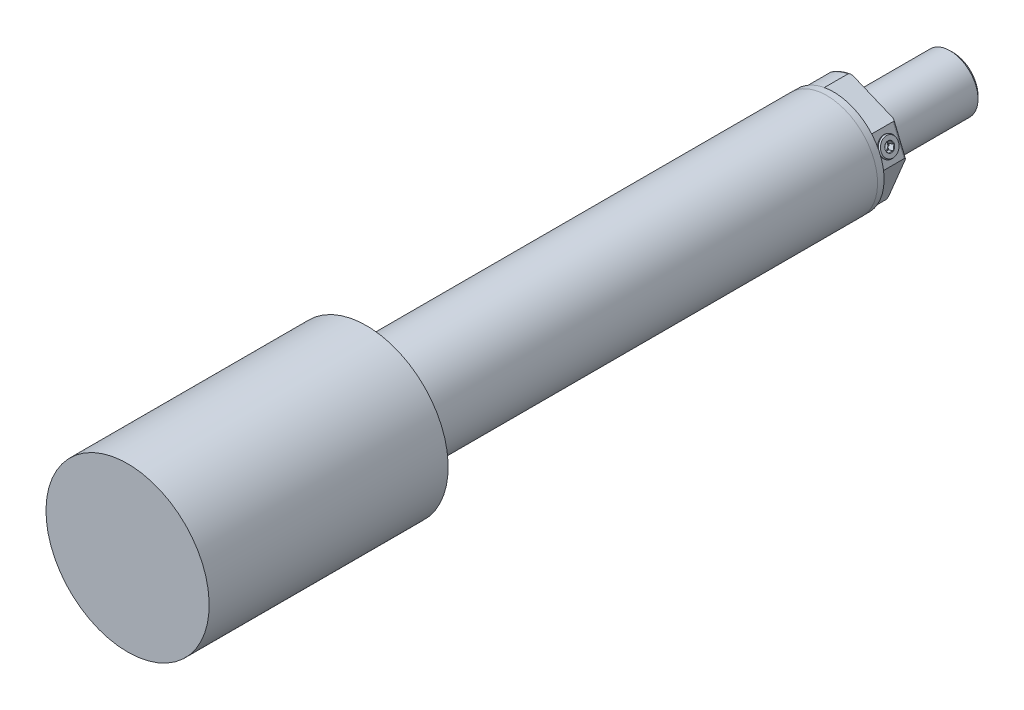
ISO-10303-21;
HEADER;
FILE_DESCRIPTION(('STEP AP214'),'2;1');
FILE_NAME('part.step','',(''),(''),'','','');
FILE_SCHEMA(('AUTOMOTIVE_DESIGN { 1 0 10303 214 1 1 1 1 }'));
ENDSEC;
DATA;
#1=APPLICATION_CONTEXT('core data for automotive mechanical design processes');
#2=APPLICATION_PROTOCOL_DEFINITION('international standard','automotive_design',2000,#1);
#3=PRODUCT_CONTEXT('',#1,'mechanical');
#4=PRODUCT('Part','Part','',(#3));
#5=PRODUCT_RELATED_PRODUCT_CATEGORY('part','',(#4));
#6=PRODUCT_DEFINITION_FORMATION('','',#4);
#7=PRODUCT_DEFINITION_CONTEXT('part definition',#1,'design');
#8=PRODUCT_DEFINITION('design','',#6,#7);
#9=PRODUCT_DEFINITION_SHAPE('','',#8);
#10=(LENGTH_UNIT() NAMED_UNIT(*) SI_UNIT(.MILLI.,.METRE.));
#11=(NAMED_UNIT(*) PLANE_ANGLE_UNIT() SI_UNIT($,.RADIAN.));
#12=(NAMED_UNIT(*) SI_UNIT($,.STERADIAN.) SOLID_ANGLE_UNIT());
#13=UNCERTAINTY_MEASURE_WITH_UNIT(LENGTH_MEASURE(1.E-05),#10,'distance_accuracy_value','');
#14=(GEOMETRIC_REPRESENTATION_CONTEXT(3) GLOBAL_UNCERTAINTY_ASSIGNED_CONTEXT((#13)) GLOBAL_UNIT_ASSIGNED_CONTEXT((#10,
#11,#12)) REPRESENTATION_CONTEXT('',''));
#15=CARTESIAN_POINT('',(0.,0.,0.));
#16=DIRECTION('',(0.,0.,1.));
#17=DIRECTION('',(1.,0.,0.));
#18=AXIS2_PLACEMENT_3D('',#15,#16,#17);
#19=CARTESIAN_POINT('',(0.,0.,-380.1875999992));
#20=DIRECTION('',(0.,0.,1.));
#21=DIRECTION('',(0.923879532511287,-0.382683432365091,0.));
#22=AXIS2_PLACEMENT_3D('',#19,#20,#21);
#23=PLANE('',#22);
#24=CARTESIAN_POINT('',(0.,0.,-380.1875999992));
#25=DIRECTION('',(0.,0.,1.));
#26=DIRECTION('',(0.923879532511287,-0.382683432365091,0.));
#27=AXIS2_PLACEMENT_3D('',#24,#25,#26);
#28=CIRCLE('',#27,37.973);
#29=CARTESIAN_POINT('',(35.0824774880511,-14.5316379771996,-380.1875999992));
#30=VERTEX_POINT('',#29);
#31=EDGE_CURVE('E10',#30,#30,#28,.T.);
#32=ORIENTED_EDGE('',*,*,#31,.T.);
#33=EDGE_LOOP('',(#32));
#34=FACE_BOUND('',#33,.T.);
#35=CARTESIAN_POINT('',(0.,0.,-380.1875999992));
#36=DIRECTION('',(0.,0.,1.));
#37=DIRECTION('',(0.923879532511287,-0.382683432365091,0.));
#38=AXIS2_PLACEMENT_3D('',#35,#36,#37);
#39=CIRCLE('',#38,38.05174);
#40=CARTESIAN_POINT('',(35.155223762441,-14.561770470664,-380.1875999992));
#41=VERTEX_POINT('',#40);
#42=EDGE_CURVE('E1524',#41,#41,#39,.T.);
#43=ORIENTED_EDGE('',*,*,#42,.F.);
#44=EDGE_LOOP('',(#43));
#45=FACE_BOUND('',#44,.T.);
#46=ADVANCED_FACE('F17',(#34,#45),#23,.F.);
#47=CARTESIAN_POINT('',(0.,0.,-137.653201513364));
#48=DIRECTION('',(0.,0.,1.));
#49=DIRECTION('',(0.923879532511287,-0.382683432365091,0.));
#50=AXIS2_PLACEMENT_3D('',#47,#48,#49);
#51=CYLINDRICAL_SURFACE('',#50,38.05174);
#52=CARTESIAN_POINT('',(0.,0.,-38.3595807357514));
#53=DIRECTION('',(0.,0.,-1.));
#54=DIRECTION('',(-0.923879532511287,0.382683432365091,0.));
#55=AXIS2_PLACEMENT_3D('',#52,#53,#54);
#56=CIRCLE('',#55,38.05174);
#57=CARTESIAN_POINT('',(-35.155223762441,14.561770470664,-38.3595807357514));
#58=VERTEX_POINT('',#57);
#59=EDGE_CURVE('E773',#58,#58,#56,.F.);
#60=ORIENTED_EDGE('',*,*,#59,.F.);
#61=EDGE_LOOP('',(#60));
#62=FACE_BOUND('',#61,.T.);
#63=ORIENTED_EDGE('',*,*,#42,.T.);
#64=EDGE_LOOP('',(#63));
#65=FACE_BOUND('',#64,.T.);
#66=ADVANCED_FACE('F395',(#62,#65),#51,.T.);
#67=CARTESIAN_POINT('',(0.,0.,-38.8747));
#68=DIRECTION('',(0.,0.,1.));
#69=DIRECTION('',(0.923879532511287,-0.382683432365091,0.));
#70=AXIS2_PLACEMENT_3D('',#67,#68,#69);
#71=TOROIDAL_SURFACE('',#70,42.7863,4.7625);
#72=ORIENTED_EDGE('',*,*,#59,.T.);
#73=EDGE_LOOP('',(#72));
#74=FACE_BOUND('',#73,.T.);
#75=CARTESIAN_POINT('',(0.,0.,-34.1122));
#76=DIRECTION('',(0.,0.,1.));
#77=DIRECTION('',(0.923879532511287,-0.382683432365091,0.));
#78=AXIS2_PLACEMENT_3D('',#75,#76,#77);
#79=CIRCLE('',#78,42.7863);
#80=CARTESIAN_POINT('',(39.5293868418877,-16.3736081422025,-34.1122));
#81=VERTEX_POINT('',#80);
#82=EDGE_CURVE('E1521',#81,#81,#79,.F.);
#83=ORIENTED_EDGE('',*,*,#82,.T.);
#84=EDGE_LOOP('',(#83));
#85=FACE_BOUND('',#84,.T.);
#86=ADVANCED_FACE('F403',(#74,#85),#71,.F.);
#87=CARTESIAN_POINT('',(0.,0.,-34.1122));
#88=DIRECTION('',(0.,0.,-1.));
#89=DIRECTION('',(-0.923879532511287,0.382683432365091,0.));
#90=AXIS2_PLACEMENT_3D('',#87,#88,#89);
#91=PLANE('',#90);
#92=ORIENTED_EDGE('',*,*,#82,.F.);
#93=EDGE_LOOP('',(#92));
#94=FACE_BOUND('',#93,.T.);
#95=CARTESIAN_POINT('',(0.,0.,-34.1122));
#96=DIRECTION('',(0.,0.,-1.));
#97=DIRECTION('',(-0.923879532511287,0.382683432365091,0.));
#98=AXIS2_PLACEMENT_3D('',#95,#96,#97);
#99=CIRCLE('',#98,61.341);
#100=CARTESIAN_POINT('',(-56.6716944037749,23.474184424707,-34.1122));
#101=VERTEX_POINT('',#100);
#102=EDGE_CURVE('E519',#101,#101,#99,.T.);
#103=ORIENTED_EDGE('',*,*,#102,.T.);
#104=EDGE_LOOP('',(#103));
#105=FACE_BOUND('',#104,.T.);
#106=ADVANCED_FACE('F1274',(#94,#105),#91,.T.);
#107=CARTESIAN_POINT('',(0.,0.,-25.4));
#108=DIRECTION('',(0.,0.,1.));
#109=DIRECTION('',(0.923879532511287,-0.382683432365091,0.));
#110=AXIS2_PLACEMENT_3D('',#107,#108,#109);
#111=CYLINDRICAL_SURFACE('',#110,61.341);
#112=CARTESIAN_POINT('',(0.,0.,145.54073));
#113=DIRECTION('',(0.,0.,-1.));
#114=DIRECTION('',(-0.923879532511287,0.382683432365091,0.));
#115=AXIS2_PLACEMENT_3D('',#112,#113,#114);
#116=CIRCLE('',#115,61.341);
#117=CARTESIAN_POINT('',(-56.6716944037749,23.474184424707,145.54073));
#118=VERTEX_POINT('',#117);
#119=EDGE_CURVE('E1527',#118,#118,#116,.F.);
#120=ORIENTED_EDGE('',*,*,#119,.F.);
#121=EDGE_LOOP('',(#120));
#122=FACE_BOUND('',#121,.T.);
#123=ORIENTED_EDGE('',*,*,#102,.F.);
#124=EDGE_LOOP('',(#123));
#125=FACE_BOUND('',#124,.T.);
#126=ADVANCED_FACE('F1263',(#122,#125),#111,.T.);
#127=CARTESIAN_POINT('',(0.,0.,145.54073));
#128=DIRECTION('',(0.,0.,-1.));
#129=DIRECTION('',(-0.923879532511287,0.382683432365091,0.));
#130=AXIS2_PLACEMENT_3D('',#127,#128,#129);
#131=PLANE('',#130);
#132=ORIENTED_EDGE('',*,*,#119,.T.);
#133=EDGE_LOOP('',(#132));
#134=FACE_BOUND('',#133,.T.);
#135=ADVANCED_FACE('F384',(#134),#131,.F.);
#136=CARTESIAN_POINT('',(27.533116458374,11.4045902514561,-395.1875999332));
#137=DIRECTION('',(0.923879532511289,0.382683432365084,0.));
#138=DIRECTION('',(0.,0.,1.));
#139=AXIS2_PLACEMENT_3D('',#136,#137,#138);
#140=CONICAL_SURFACE('',#139,3.,1.02974425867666);
#141=CARTESIAN_POINT('',(25.8677479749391,10.7147720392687,-395.1875999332));
#142=VERTEX_POINT('',#141);
#143=VERTEX_LOOP('',#142);
#144=FACE_BOUND('',#143,.T.);
#145=CARTESIAN_POINT('',(27.533116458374,11.4045902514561,-395.1875999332));
#146=DIRECTION('',(0.923879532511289,0.382683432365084,0.));
#147=DIRECTION('',(0.,0.,1.));
#148=AXIS2_PLACEMENT_3D('',#145,#146,#147);
#149=CIRCLE('',#148,3.);
#150=CARTESIAN_POINT('',(27.533116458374,11.4045902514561,-392.1875999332));
#151=VERTEX_POINT('',#150);
#152=EDGE_CURVE('E570',#151,#151,#149,.T.);
#153=ORIENTED_EDGE('',*,*,#152,.T.);
#154=EDGE_LOOP('',(#153));
#155=FACE_BOUND('',#154,.T.);
#156=ADVANCED_FACE('F1236',(#144,#155),#140,.F.);
#157=CARTESIAN_POINT('',(0.,0.,-469.318068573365));
#158=DIRECTION('',(0.,0.,-1.));
#159=DIRECTION('',(-0.923879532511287,0.382683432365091,0.));
#160=AXIS2_PLACEMENT_3D('',#157,#158,#159);
#161=CONICAL_SURFACE('',#160,1.5875,1.0471975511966);
#162=CARTESIAN_POINT('',(0.,0.,-468.401525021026));
#163=VERTEX_POINT('',#162);
#164=VERTEX_LOOP('',#163);
#165=FACE_BOUND('',#164,.T.);
#166=CARTESIAN_POINT('',(0.,0.,-469.318068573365));
#167=DIRECTION('',(0.,0.,1.));
#168=DIRECTION('',(0.923879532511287,-0.382683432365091,0.));
#169=AXIS2_PLACEMENT_3D('',#166,#167,#168);
#170=CIRCLE('',#169,1.5875);
#171=CARTESIAN_POINT('',(1.46665875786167,-0.607509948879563,-469.318068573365));
#172=VERTEX_POINT('',#171);
#173=EDGE_CURVE('E705',#172,#172,#170,.T.);
#174=ORIENTED_EDGE('',*,*,#173,.F.);
#175=EDGE_LOOP('',(#174));
#176=FACE_BOUND('',#175,.T.);
#177=ADVANCED_FACE('F1078',(#165,#176),#161,.F.);
#178=CARTESIAN_POINT('',(30.0889535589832,12.4632526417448,-395.1875999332));
#179=DIRECTION('',(0.923879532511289,0.382683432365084,0.));
#180=DIRECTION('',(0.,0.,1.));
#181=AXIS2_PLACEMENT_3D('',#178,#179,#180);
#182=CYLINDRICAL_SURFACE('',#181,3.);
#183=ORIENTED_EDGE('',*,*,#152,.F.);
#184=EDGE_LOOP('',(#183));
#185=FACE_BOUND('',#184,.T.);
#186=CARTESIAN_POINT('',(28.2116303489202,11.6856399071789,-395.1875999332));
#187=DIRECTION('',(0.923879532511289,0.382683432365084,0.));
#188=DIRECTION('',(0.,0.,1.));
#189=AXIS2_PLACEMENT_3D('',#186,#187,#188);
#190=CIRCLE('',#189,3.);
#191=CARTESIAN_POINT('',(27.6376052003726,13.0714592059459,-392.589523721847));
#192=VERTEX_POINT('',#191);
#193=CARTESIAN_POINT('',(27.063580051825,14.4572785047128,-395.1875999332));
#194=VERTEX_POINT('',#193);
#195=EDGE_CURVE('E626',#192,#194,#190,.F.);
#196=ORIENTED_EDGE('',*,*,#195,.F.);
#197=CARTESIAN_POINT('',(28.7856554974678,10.299820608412,-392.589523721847));
#198=VERTEX_POINT('',#197);
#199=EDGE_CURVE('E616',#198,#192,#190,.F.);
#200=ORIENTED_EDGE('',*,*,#199,.F.);
#201=CARTESIAN_POINT('',(29.3596806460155,8.91400130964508,-395.1875999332));
#202=VERTEX_POINT('',#201);
#203=EDGE_CURVE('E625',#202,#198,#190,.F.);
#204=ORIENTED_EDGE('',*,*,#203,.F.);
#205=CARTESIAN_POINT('',(28.7856554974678,10.299820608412,-397.785676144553));
#206=VERTEX_POINT('',#205);
#207=EDGE_CURVE('E1583',#206,#202,#190,.F.);
#208=ORIENTED_EDGE('',*,*,#207,.F.);
#209=CARTESIAN_POINT('',(27.6376052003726,13.0714592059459,-397.785676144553));
#210=VERTEX_POINT('',#209);
#211=EDGE_CURVE('E1581',#210,#206,#190,.F.);
#212=ORIENTED_EDGE('',*,*,#211,.F.);
#213=EDGE_CURVE('E1579',#194,#210,#190,.F.);
#214=ORIENTED_EDGE('',*,*,#213,.F.);
#215=EDGE_LOOP('',(#196,#200,#204,#208,#212,#214));
#216=FACE_BOUND('',#215,.T.);
#217=ADVANCED_FACE('F1217',(#185,#216),#182,.F.);
#218=CARTESIAN_POINT('',(0.,0.,-475.0375999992));
#219=DIRECTION('',(0.,0.,1.));
#220=DIRECTION('',(0.923879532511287,-0.382683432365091,0.));
#221=AXIS2_PLACEMENT_3D('',#218,#219,#220);
#222=CYLINDRICAL_SURFACE('',#221,1.5875);
#223=ORIENTED_EDGE('',*,*,#173,.T.);
#224=EDGE_LOOP('',(#223));
#225=FACE_BOUND('',#224,.T.);
#226=CARTESIAN_POINT('',(0.,0.,-472.617925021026));
#227=DIRECTION('',(0.,0.,1.));
#228=DIRECTION('',(0.923879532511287,-0.382683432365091,0.));
#229=AXIS2_PLACEMENT_3D('',#226,#227,#228);
#230=CIRCLE('',#229,1.5875);
#231=CARTESIAN_POINT('',(1.46665875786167,-0.607509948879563,-472.617925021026));
#232=VERTEX_POINT('',#231);
#233=EDGE_CURVE('E708',#232,#232,#230,.T.);
#234=ORIENTED_EDGE('',*,*,#233,.F.);
#235=EDGE_LOOP('',(#234));
#236=FACE_BOUND('',#235,.T.);
#237=ADVANCED_FACE('F1158',(#225,#236),#222,.F.);
#238=CARTESIAN_POINT('',(29.3596806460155,8.91400130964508,-393.455549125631));
#239=DIRECTION('',(0.923879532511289,0.382683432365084,0.));
#240=DIRECTION('',(0.,0.,1.));
#241=AXIS2_PLACEMENT_3D('',#238,#239,#240);
#242=PLANE('',#241);
#243=ORIENTED_EDGE('',*,*,#211,.T.);
#244=DIRECTION('',(-0.331413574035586,0.800103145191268,-0.5));
#245=VECTOR('',#244,1.);
#246=CARTESIAN_POINT('',(29.3596806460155,8.91400130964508,-396.919650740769));
#247=LINE('',#246,#245);
#248=CARTESIAN_POINT('',(28.2116303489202,11.6856399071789,-398.651701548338));
#249=VERTEX_POINT('',#248);
#250=EDGE_CURVE('E526',#206,#249,#247,.T.);
#251=ORIENTED_EDGE('',*,*,#250,.T.);
#252=DIRECTION('',(-0.331413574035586,0.800103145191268,0.5));
#253=VECTOR('',#252,1.);
#254=CARTESIAN_POINT('',(28.2116303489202,11.6856399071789,-398.651701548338));
#255=LINE('',#254,#253);
#256=EDGE_CURVE('E531',#249,#210,#255,.T.);
#257=ORIENTED_EDGE('',*,*,#256,.T.);
#258=EDGE_LOOP('',(#243,#251,#257));
#259=FACE_BOUND('',#258,.T.);
#260=ADVANCED_FACE('F1169',(#259),#242,.T.);
#261=ORIENTED_EDGE('',*,*,#213,.T.);
#262=CARTESIAN_POINT('',(27.063580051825,14.4572785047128,-396.919650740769));
#263=VERTEX_POINT('',#262);
#264=EDGE_CURVE('E530',#210,#263,#255,.T.);
#265=ORIENTED_EDGE('',*,*,#264,.T.);
#266=DIRECTION('',(0.,0.,1.));
#267=VECTOR('',#266,1.);
#268=CARTESIAN_POINT('',(27.063580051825,14.4572785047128,-396.919650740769));
#269=LINE('',#268,#267);
#270=EDGE_CURVE('E535',#263,#194,#269,.T.);
#271=ORIENTED_EDGE('',*,*,#270,.T.);
#272=EDGE_LOOP('',(#261,#265,#271));
#273=FACE_BOUND('',#272,.T.);
#274=ADVANCED_FACE('F1197',(#273),#242,.T.);
#275=ORIENTED_EDGE('',*,*,#195,.T.);
#276=CARTESIAN_POINT('',(27.063580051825,14.4572785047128,-393.455549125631));
#277=VERTEX_POINT('',#276);
#278=EDGE_CURVE('E534',#194,#277,#269,.T.);
#279=ORIENTED_EDGE('',*,*,#278,.T.);
#280=DIRECTION('',(0.331413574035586,-0.800103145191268,0.5));
#281=VECTOR('',#280,1.);
#282=CARTESIAN_POINT('',(27.063580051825,14.4572785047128,-393.455549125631));
#283=LINE('',#282,#281);
#284=EDGE_CURVE('E539',#277,#192,#283,.T.);
#285=ORIENTED_EDGE('',*,*,#284,.T.);
#286=EDGE_LOOP('',(#275,#279,#285));
#287=FACE_BOUND('',#286,.T.);
#288=ADVANCED_FACE('F1188',(#287),#242,.T.);
#289=ORIENTED_EDGE('',*,*,#199,.T.);
#290=CARTESIAN_POINT('',(28.2116303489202,11.6856399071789,-391.723498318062));
#291=VERTEX_POINT('',#290);
#292=EDGE_CURVE('E538',#192,#291,#283,.T.);
#293=ORIENTED_EDGE('',*,*,#292,.T.);
#294=DIRECTION('',(0.331413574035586,-0.800103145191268,-0.5));
#295=VECTOR('',#294,1.);
#296=CARTESIAN_POINT('',(28.2116303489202,11.6856399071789,-391.723498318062));
#297=LINE('',#296,#295);
#298=EDGE_CURVE('E106',#291,#198,#297,.T.);
#299=ORIENTED_EDGE('',*,*,#298,.T.);
#300=EDGE_LOOP('',(#289,#293,#299));
#301=FACE_BOUND('',#300,.T.);
#302=ADVANCED_FACE('F1178',(#301),#242,.T.);
#303=ORIENTED_EDGE('',*,*,#203,.T.);
#304=CARTESIAN_POINT('',(29.3596806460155,8.91400130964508,-393.455549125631));
#305=VERTEX_POINT('',#304);
#306=EDGE_CURVE('E522',#198,#305,#297,.T.);
#307=ORIENTED_EDGE('',*,*,#306,.T.);
#308=DIRECTION('',(0.,0.,-1.));
#309=VECTOR('',#308,1.);
#310=CARTESIAN_POINT('',(29.3596806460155,8.91400130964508,-393.455549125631));
#311=LINE('',#310,#309);
#312=EDGE_CURVE('E523',#305,#202,#311,.T.);
#313=ORIENTED_EDGE('',*,*,#312,.T.);
#314=EDGE_LOOP('',(#303,#307,#313));
#315=FACE_BOUND('',#314,.T.);
#316=ADVANCED_FACE('F1167',(#315),#242,.T.);
#317=ORIENTED_EDGE('',*,*,#207,.T.);
#318=CARTESIAN_POINT('',(29.3596806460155,8.91400130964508,-396.919650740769));
#319=VERTEX_POINT('',#318);
#320=EDGE_CURVE('E521',#202,#319,#311,.T.);
#321=ORIENTED_EDGE('',*,*,#320,.T.);
#322=EDGE_CURVE('E527',#319,#206,#247,.T.);
#323=ORIENTED_EDGE('',*,*,#322,.T.);
#324=EDGE_LOOP('',(#317,#321,#323));
#325=FACE_BOUND('',#324,.T.);
#326=ADVANCED_FACE('F1148',(#325),#242,.T.);
#327=CARTESIAN_POINT('',(0.,0.,-475.0375999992));
#328=DIRECTION('',(0.,0.,-1.));
#329=DIRECTION('',(-0.923879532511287,0.382683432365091,0.));
#330=AXIS2_PLACEMENT_3D('',#327,#328,#329);
#331=CONICAL_SURFACE('',#330,2.9845,0.523598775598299);
#332=ORIENTED_EDGE('',*,*,#233,.T.);
#333=EDGE_LOOP('',(#332));
#334=FACE_BOUND('',#333,.T.);
#335=CARTESIAN_POINT('',(0.,0.,-475.0375999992));
#336=DIRECTION('',(0.,0.,1.));
#337=DIRECTION('',(0.923879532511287,-0.382683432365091,0.));
#338=AXIS2_PLACEMENT_3D('',#335,#336,#337);
#339=CIRCLE('',#338,2.9845);
#340=CARTESIAN_POINT('',(2.75731846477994,-1.14211870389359,-475.0375999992));
#341=VERTEX_POINT('',#340);
#342=EDGE_CURVE('E711',#341,#341,#339,.T.);
#343=ORIENTED_EDGE('',*,*,#342,.F.);
#344=EDGE_LOOP('',(#343));
#345=FACE_BOUND('',#344,.T.);
#346=ADVANCED_FACE('F295',(#334,#345),#331,.F.);
#347=CARTESIAN_POINT('',(29.3596806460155,8.91400130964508,-396.919650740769));
#348=DIRECTION('',(0.191341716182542,-0.461939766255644,-0.866025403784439));
#349=DIRECTION('',(-0.331413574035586,0.800103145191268,-0.5));
#350=AXIS2_PLACEMENT_3D('',#347,#348,#349);
#351=PLANE('',#350);
#352=CARTESIAN_POINT('',(32.1604155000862,13.3214967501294,-398.651817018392));
#353=CARTESIAN_POINT('',(32.1449201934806,13.2034582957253,-398.592278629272));
#354=CARTESIAN_POINT('',(32.1333126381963,13.08516376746,-398.531744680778));
#355=CARTESIAN_POINT('',(32.1204106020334,12.8484081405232,-398.408309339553));
#356=CARTESIAN_POINT('',(32.1191766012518,12.7299500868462,-398.345396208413));
#357=CARTESIAN_POINT('',(32.1297160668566,12.4964813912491,-398.218534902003));
#358=CARTESIAN_POINT('',(32.1412832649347,12.3814458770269,-398.154619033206));
#359=CARTESIAN_POINT('',(32.1794956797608,12.1549823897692,-398.025380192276));
#360=CARTESIAN_POINT('',(32.2061028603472,12.0435460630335,-397.96006116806));
#361=CARTESIAN_POINT('',(32.2656632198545,11.8571668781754,-397.847486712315));
#362=CARTESIAN_POINT('',(32.2946601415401,11.7808578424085,-397.800376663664));
#363=CARTESIAN_POINT('',(32.3608166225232,11.6317645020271,-397.706233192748));
#364=CARTESIAN_POINT('',(32.3979790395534,11.5589814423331,-397.659199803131));
#365=CARTESIAN_POINT('',(32.4798800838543,11.4173888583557,-397.565578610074));
#366=CARTESIAN_POINT('',(32.5246271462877,11.3485838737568,-397.518991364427));
#367=CARTESIAN_POINT('',(32.6207055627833,11.2152012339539,-397.426616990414));
#368=CARTESIAN_POINT('',(32.6720364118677,11.1506232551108,-397.38082980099));
#369=CARTESIAN_POINT('',(32.7690846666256,11.0384301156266,-397.299543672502));
#370=CARTESIAN_POINT('',(32.8137866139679,10.9900570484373,-397.263864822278));
#371=CARTESIAN_POINT('',(32.9061590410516,10.8957413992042,-397.193147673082));
#372=CARTESIAN_POINT('',(32.953829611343,10.8497988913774,-397.15810939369));
#373=CARTESIAN_POINT('',(33.0515180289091,10.7602939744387,-397.088783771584));
#374=CARTESIAN_POINT('',(33.1015282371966,10.7167247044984,-397.054494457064));
#375=CARTESIAN_POINT('',(33.2036144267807,10.6316324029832,-396.986550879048));
#376=CARTESIAN_POINT('',(33.2556891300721,10.5901081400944,-396.952896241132));
#377=CARTESIAN_POINT('',(33.3086188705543,10.5494886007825,-396.919535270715));
#378=B_SPLINE_CURVE_WITH_KNOTS('',3,(#352,#353,#354,#355,#356,#357,#358,#359,#360,#361,#362,
#363,#364,#365,#366,#367,#368,#369,#370,#371,#372,#373,#374,#375,#376,#377),.UNSPECIFIED.,.F.,
.F.,(4,2,2,2,2,2,2,2,2,2,2,2,4),(0.,0.399603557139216,0.801535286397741,1.19708369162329,
1.59163620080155,1.87398941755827,2.15644160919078,2.43921001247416,2.72195674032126,
2.94657516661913,3.1712004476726,3.39513752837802,3.61893808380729),.UNSPECIFIED.);
#379=CARTESIAN_POINT('',(32.1603853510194,13.321267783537,-398.651701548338));
#380=VERTEX_POINT('',#379);
#381=CARTESIAN_POINT('',(33.3084356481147,10.5496291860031,-396.919650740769));
#382=VERTEX_POINT('',#381);
#383=EDGE_CURVE('E587',#380,#382,#378,.T.);
#384=ORIENTED_EDGE('',*,*,#383,.F.);
#385=DIRECTION('',(0.923879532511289,0.382683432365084,0.));
#386=VECTOR('',#385,1.);
#387=CARTESIAN_POINT('',(28.2116303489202,11.6856399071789,-398.651701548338));
#388=LINE('',#387,#386);
#389=EDGE_CURVE('E552',#249,#380,#388,.T.);
#390=ORIENTED_EDGE('',*,*,#389,.F.);
#391=ORIENTED_EDGE('',*,*,#250,.F.);
#392=ORIENTED_EDGE('',*,*,#322,.F.);
#393=DIRECTION('',(0.923879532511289,0.382683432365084,0.));
#394=VECTOR('',#393,1.);
#395=CARTESIAN_POINT('',(29.3596806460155,8.91400130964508,-396.919650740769));
#396=LINE('',#395,#394);
#397=EDGE_CURVE('E555',#319,#382,#396,.T.);
#398=ORIENTED_EDGE('',*,*,#397,.T.);
#399=EDGE_LOOP('',(#384,#390,#391,#392,#398));
#400=FACE_BOUND('',#399,.T.);
#401=ADVANCED_FACE('F602',(#400),#351,.F.);
#402=CARTESIAN_POINT('',(28.2116303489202,11.6856399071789,-398.651701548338));
#403=DIRECTION('',(-0.191341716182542,0.461939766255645,-0.866025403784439));
#404=DIRECTION('',(-0.331413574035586,0.800103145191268,0.5));
#405=AXIS2_PLACEMENT_3D('',#402,#403,#404);
#406=PLANE('',#405);
#407=CARTESIAN_POINT('',(31.0123652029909,16.0931353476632,-396.919535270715));
#408=CARTESIAN_POINT('',(30.9968698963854,15.9750968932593,-396.979073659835));
#409=CARTESIAN_POINT('',(30.9852623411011,15.856802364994,-397.039607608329));
#410=CARTESIAN_POINT('',(30.9723603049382,15.6200467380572,-397.163042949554));
#411=CARTESIAN_POINT('',(30.9711263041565,15.5015886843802,-397.225956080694));
#412=CARTESIAN_POINT('',(30.9816657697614,15.268119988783,-397.352817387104));
#413=CARTESIAN_POINT('',(30.9932329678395,15.1530844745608,-397.416733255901));
#414=CARTESIAN_POINT('',(31.0314453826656,14.9266209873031,-397.545972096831));
#415=CARTESIAN_POINT('',(31.0580525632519,14.8151846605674,-397.611291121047));
#416=CARTESIAN_POINT('',(31.1176129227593,14.6288054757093,-397.723865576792));
#417=CARTESIAN_POINT('',(31.1466098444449,14.5524964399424,-397.770975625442));
#418=CARTESIAN_POINT('',(31.212766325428,14.4034030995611,-397.865119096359));
#419=CARTESIAN_POINT('',(31.2499287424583,14.3306200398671,-397.912152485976));
#420=CARTESIAN_POINT('',(31.331829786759,14.1890274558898,-398.005773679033));
#421=CARTESIAN_POINT('',(31.3765768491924,14.120222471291,-398.05236092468));
#422=CARTESIAN_POINT('',(31.472655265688,13.9868398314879,-398.144735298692));
#423=CARTESIAN_POINT('',(31.5239861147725,13.9222618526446,-398.190522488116));
#424=CARTESIAN_POINT('',(31.6210343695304,13.8100687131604,-398.271808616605));
#425=CARTESIAN_POINT('',(31.6657363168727,13.7616956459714,-398.307487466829));
#426=CARTESIAN_POINT('',(31.7581087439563,13.6673799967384,-398.378204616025));
#427=CARTESIAN_POINT('',(31.8057793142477,13.6214374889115,-398.413242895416));
#428=CARTESIAN_POINT('',(31.9034677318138,13.5319325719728,-398.482568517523));
#429=CARTESIAN_POINT('',(31.9534779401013,13.4883633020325,-398.516857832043));
#430=CARTESIAN_POINT('',(32.0555641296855,13.4032710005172,-398.584801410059));
#431=CARTESIAN_POINT('',(32.1076388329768,13.3617467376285,-398.618456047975));
#432=CARTESIAN_POINT('',(32.1605685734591,13.3211271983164,-398.651817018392));
#433=B_SPLINE_CURVE_WITH_KNOTS('',3,(#407,#408,#409,#410,#411,#412,#413,#414,#415,#416,#417,
#418,#419,#420,#421,#422,#423,#424,#425,#426,#427,#428,#429,#430,#431,#432),.UNSPECIFIED.,.F.,
.F.,(4,2,2,2,2,2,2,2,2,2,2,2,4),(0.,0.39960355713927,0.801535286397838,1.19708369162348,
1.59163620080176,1.87398941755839,2.15644160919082,2.43921001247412,2.7219567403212,
2.94657516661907,3.17120044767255,3.39513752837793,3.6189380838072),.UNSPECIFIED.);
#434=CARTESIAN_POINT('',(31.0123350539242,16.0929063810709,-396.919650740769));
#435=VERTEX_POINT('',#434);
#436=EDGE_CURVE('E1604',#435,#380,#433,.T.);
#437=ORIENTED_EDGE('',*,*,#436,.F.);
#438=DIRECTION('',(0.923879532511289,0.382683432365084,0.));
#439=VECTOR('',#438,1.);
#440=CARTESIAN_POINT('',(27.063580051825,14.4572785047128,-396.919650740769));
#441=LINE('',#440,#439);
#442=EDGE_CURVE('E549',#263,#435,#441,.T.);
#443=ORIENTED_EDGE('',*,*,#442,.F.);
#444=ORIENTED_EDGE('',*,*,#264,.F.);
#445=ORIENTED_EDGE('',*,*,#256,.F.);
#446=ORIENTED_EDGE('',*,*,#389,.T.);
#447=EDGE_LOOP('',(#437,#443,#444,#445,#446));
#448=FACE_BOUND('',#447,.T.);
#449=ADVANCED_FACE('F1127',(#448),#406,.F.);
#450=CARTESIAN_POINT('',(27.063580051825,14.4572785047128,-396.919650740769));
#451=DIRECTION('',(-0.382683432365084,0.923879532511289,0.));
#452=DIRECTION('',(0.,0.,1.));
#453=AXIS2_PLACEMENT_3D('',#450,#451,#452);
#454=PLANE('',#453);
#455=CARTESIAN_POINT('',(32.1643930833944,16.5701044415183,-398.819992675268));
#456=CARTESIAN_POINT('',(32.1019427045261,16.5442366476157,-398.732303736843));
#457=CARTESIAN_POINT('',(32.0400473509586,16.5185987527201,-398.644144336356));
#458=CARTESIAN_POINT('',(31.9176208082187,16.4678880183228,-398.46669159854));
#459=CARTESIAN_POINT('',(31.8570899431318,16.4428153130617,-398.377397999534));
#460=CARTESIAN_POINT('',(31.7372157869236,16.3931618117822,-398.196831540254));
#461=CARTESIAN_POINT('',(31.6778852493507,16.3685862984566,-398.105548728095));
#462=CARTESIAN_POINT('',(31.561273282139,16.3202840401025,-397.92146738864));
#463=CARTESIAN_POINT('',(31.503991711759,16.2965572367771,-397.828668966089));
#464=CARTESIAN_POINT('',(31.3883540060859,16.2486585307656,-397.635293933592));
#465=CARTESIAN_POINT('',(31.3301644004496,16.2245556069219,-397.534600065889));
#466=CARTESIAN_POINT('',(31.2173743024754,16.1778364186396,-397.330846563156));
#467=CARTESIAN_POINT('',(31.1627744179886,16.1552204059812,-397.227786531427));
#468=CARTESIAN_POINT('',(31.0583248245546,16.1119559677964,-397.019268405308));
#469=CARTESIAN_POINT('',(31.0084611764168,16.0913017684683,-396.913818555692));
#470=CARTESIAN_POINT('',(30.9146012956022,16.0524237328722,-396.699926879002));
#471=CARTESIAN_POINT('',(30.8706022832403,16.0341987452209,-396.591486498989));
#472=CARTESIAN_POINT('',(30.7941192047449,16.0025184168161,-396.382436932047));
#473=CARTESIAN_POINT('',(30.7609221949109,15.9887677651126,-396.282136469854));
#474=CARTESIAN_POINT('',(30.7019441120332,15.9643382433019,-396.078965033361));
#475=CARTESIAN_POINT('',(30.6761635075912,15.9536595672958,-395.976093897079));
#476=CARTESIAN_POINT('',(30.6338491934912,15.9361324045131,-395.770196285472));
#477=CARTESIAN_POINT('',(30.617146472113,15.9292139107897,-395.667211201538));
#478=CARTESIAN_POINT('',(30.5933388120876,15.9193524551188,-395.459942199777));
#479=CARTESIAN_POINT('',(30.586231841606,15.9164086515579,-395.355658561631));
#480=CARTESIAN_POINT('',(30.5822294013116,15.9147507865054,-395.151513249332));
#481=CARTESIAN_POINT('',(30.5848929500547,15.9158540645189,-395.051661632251));
#482=CARTESIAN_POINT('',(30.5992685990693,15.9218086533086,-394.852730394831));
#483=CARTESIAN_POINT('',(30.6109815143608,15.9266603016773,-394.753650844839));
#484=CARTESIAN_POINT('',(30.6429892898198,15.9399183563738,-394.555297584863));
#485=CARTESIAN_POINT('',(30.6634362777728,15.9483877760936,-394.456053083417));
#486=CARTESIAN_POINT('',(30.7117761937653,15.9684108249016,-394.259762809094));
#487=CARTESIAN_POINT('',(30.7396687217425,15.9799642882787,-394.162716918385));
#488=CARTESIAN_POINT('',(30.8359841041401,16.0198594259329,-393.864754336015));
#489=CARTESIAN_POINT('',(30.9150762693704,16.0526204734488,-393.667865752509));
#490=CARTESIAN_POINT('',(31.0470233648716,16.1072747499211,-393.3797032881));
#491=CARTESIAN_POINT('',(31.0933260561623,16.1264539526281,-393.284667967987));
#492=CARTESIAN_POINT('',(31.1895252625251,16.1663009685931,-393.096747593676));
#493=CARTESIAN_POINT('',(31.2394211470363,16.1869685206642,-393.00386216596));
#494=CARTESIAN_POINT('',(31.3395530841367,16.2284445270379,-392.824528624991));
#495=CARTESIAN_POINT('',(31.3896508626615,16.2491957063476,-392.737989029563));
#496=CARTESIAN_POINT('',(31.4919822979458,16.2915827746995,-392.566394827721));
#497=CARTESIAN_POINT('',(31.5442161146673,16.31321873,-392.481340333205));
#498=CARTESIAN_POINT('',(31.6500128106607,16.3570411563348,-392.313207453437));
#499=CARTESIAN_POINT('',(31.7035616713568,16.3792218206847,-392.230118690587));
#500=CARTESIAN_POINT('',(31.8120964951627,16.4241784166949,-392.065081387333));
#501=CARTESIAN_POINT('',(31.8670820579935,16.4469541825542,-391.983132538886));
#502=CARTESIAN_POINT('',(31.9226559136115,16.4699736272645,-391.90166170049));
#503=B_SPLINE_CURVE_WITH_KNOTS('',3,(#455,#456,#457,#458,#459,#460,#461,#462,#463,#464,#465,
#466,#467,#468,#469,#470,#471,#472,#473,#474,#475,#476,#477,#478,#479,#480,#481,#482,#483,#484,
#485,#486,#487,#488,#489,#490,#491,#492,#493,#494,#495,#496,#497,#498,#499,#500,#501,#502),
.UNSPECIFIED.,.F.,.F.,(4,2,2,2,2,2,2,2,2,2,2,2,2,2,2,2,2,2,2,2,2,2,2,4),(0.,0.332160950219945,
0.66439997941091,0.999200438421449,1.33397785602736,1.69021718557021,2.04651668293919,
2.40173276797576,2.75677988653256,3.07613245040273,3.3955051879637,3.70870823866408,
4.02184496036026,4.32102606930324,4.62023412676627,4.92488102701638,5.22951156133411,
5.87161027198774,6.19390461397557,6.51614253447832,6.82247989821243,7.12884024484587,
7.43274361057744,7.73656319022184),.UNSPECIFIED.);
#504=CARTESIAN_POINT('',(31.0123350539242,16.0929063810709,-393.455549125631));
#505=VERTEX_POINT('',#504);
#506=EDGE_CURVE('E1605',#505,#435,#503,.F.);
#507=ORIENTED_EDGE('',*,*,#506,.F.);
#508=DIRECTION('',(0.923879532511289,0.382683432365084,0.));
#509=VECTOR('',#508,1.);
#510=CARTESIAN_POINT('',(27.063580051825,14.4572785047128,-393.455549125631));
#511=LINE('',#510,#509);
#512=EDGE_CURVE('E546',#277,#505,#511,.T.);
#513=ORIENTED_EDGE('',*,*,#512,.F.);
#514=ORIENTED_EDGE('',*,*,#278,.F.);
#515=ORIENTED_EDGE('',*,*,#270,.F.);
#516=ORIENTED_EDGE('',*,*,#442,.T.);
#517=EDGE_LOOP('',(#507,#513,#514,#515,#516));
#518=FACE_BOUND('',#517,.T.);
#519=ADVANCED_FACE('F1117',(#518),#454,.F.);
#520=CARTESIAN_POINT('',(27.063580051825,14.4572785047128,-393.455549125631));
#521=DIRECTION('',(-0.191341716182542,0.461939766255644,0.866025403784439));
#522=DIRECTION('',(0.331413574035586,-0.800103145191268,0.5));
#523=AXIS2_PLACEMENT_3D('',#520,#521,#522);
#524=PLANE('',#523);
#525=CARTESIAN_POINT('',(32.1605685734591,13.3211271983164,-391.723382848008));
#526=CARTESIAN_POINT('',(32.0661459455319,13.3936361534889,-391.782921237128));
#527=CARTESIAN_POINT('',(31.9742913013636,13.4690752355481,-391.843455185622));
#528=CARTESIAN_POINT('',(31.7977566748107,13.6273636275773,-391.966890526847));
#529=CARTESIAN_POINT('',(31.7131216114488,13.7102535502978,-392.029803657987));
#530=CARTESIAN_POINT('',(31.5554868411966,13.8827933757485,-392.156664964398));
#531=CARTESIAN_POINT('',(31.4823236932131,13.9723150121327,-392.220580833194));
#532=CARTESIAN_POINT('',(31.3492100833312,14.1594691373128,-392.349819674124));
#533=CARTESIAN_POINT('',(31.2892268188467,14.257080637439,-392.41513869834));
#534=CARTESIAN_POINT('',(31.1995523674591,14.4309861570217,-392.527713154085));
#535=CARTESIAN_POINT('',(31.1660976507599,14.5054487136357,-392.574823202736));
#536=CARTESIAN_POINT('',(31.107452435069,14.6576533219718,-392.668966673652));
#537=CARTESIAN_POINT('',(31.0822648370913,14.7353965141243,-392.716000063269));
#538=CARTESIAN_POINT('',(31.0400565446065,14.8934303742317,-392.809621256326));
#539=CARTESIAN_POINT('',(31.023045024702,14.9737237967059,-392.856208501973));
#540=CARTESIAN_POINT('',(30.9966669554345,15.1359772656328,-392.948582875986));
#541=CARTESIAN_POINT('',(30.9872998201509,15.2179371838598,-392.99437006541));
#542=CARTESIAN_POINT('',(30.9765907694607,15.3658931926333,-393.075656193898));
#543=CARTESIAN_POINT('',(30.9739948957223,15.4317071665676,-393.111335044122));
#544=CARTESIAN_POINT('',(30.9726208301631,15.5637155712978,-393.182052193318));
#545=CARTESIAN_POINT('',(30.9738427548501,15.629910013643,-393.21709047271));
#546=CARTESIAN_POINT('',(30.9796293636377,15.7622756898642,-393.286416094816));
#547=CARTESIAN_POINT('',(30.9841837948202,15.828446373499,-393.320705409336));
#548=CARTESIAN_POINT('',(30.9962002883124,15.9608015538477,-393.388648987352));
#549=CARTESIAN_POINT('',(31.0036605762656,16.0269860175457,-393.422303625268));
#550=CARTESIAN_POINT('',(31.0123652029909,16.0931353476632,-393.455664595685));
#551=B_SPLINE_CURVE_WITH_KNOTS('',3,(#525,#526,#527,#528,#529,#530,#531,#532,#533,#534,#535,
#536,#537,#538,#539,#540,#541,#542,#543,#544,#545,#546,#547,#548,#549,#550),.UNSPECIFIED.,.F.,
.F.,(4,2,2,2,2,2,2,2,2,2,2,2,4),(0.,0.399603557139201,0.801535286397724,1.19708369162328,
1.59163620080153,1.87398941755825,2.15644160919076,2.4392100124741,2.72195674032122,
2.94657516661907,3.17120044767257,3.39513752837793,3.61893808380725),.UNSPECIFIED.);
#552=CARTESIAN_POINT('',(32.1603853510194,13.321267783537,-391.723498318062));
#553=VERTEX_POINT('',#552);
#554=EDGE_CURVE('E617',#553,#505,#551,.T.);
#555=ORIENTED_EDGE('',*,*,#554,.F.);
#556=DIRECTION('',(0.923879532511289,0.382683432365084,0.));
#557=VECTOR('',#556,1.);
#558=CARTESIAN_POINT('',(28.2116303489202,11.6856399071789,-391.723498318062));
#559=LINE('',#558,#557);
#560=EDGE_CURVE('E543',#291,#553,#559,.T.);
#561=ORIENTED_EDGE('',*,*,#560,.F.);
#562=ORIENTED_EDGE('',*,*,#292,.F.);
#563=ORIENTED_EDGE('',*,*,#284,.F.);
#564=ORIENTED_EDGE('',*,*,#512,.T.);
#565=EDGE_LOOP('',(#555,#561,#562,#563,#564));
#566=FACE_BOUND('',#565,.T.);
#567=ADVANCED_FACE('F607',(#566),#524,.F.);
#568=CARTESIAN_POINT('',(28.2116303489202,11.6856399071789,-391.723498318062));
#569=DIRECTION('',(0.191341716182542,-0.461939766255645,0.866025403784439));
#570=DIRECTION('',(0.331413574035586,-0.800103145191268,-0.5));
#571=AXIS2_PLACEMENT_3D('',#568,#569,#570);
#572=PLANE('',#571);
#573=CARTESIAN_POINT('',(33.3086188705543,10.5494886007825,-393.455664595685));
#574=CARTESIAN_POINT('',(33.2141962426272,10.621997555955,-393.396126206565));
#575=CARTESIAN_POINT('',(33.122341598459,10.6974366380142,-393.335592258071));
#576=CARTESIAN_POINT('',(32.945806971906,10.8557250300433,-393.212156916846));
#577=CARTESIAN_POINT('',(32.8611719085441,10.9386149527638,-393.149243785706));
#578=CARTESIAN_POINT('',(32.7035371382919,11.1111547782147,-393.022382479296));
#579=CARTESIAN_POINT('',(32.6303739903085,11.2006764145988,-392.958466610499));
#580=CARTESIAN_POINT('',(32.4972603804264,11.3878305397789,-392.829227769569));
#581=CARTESIAN_POINT('',(32.4372771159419,11.4854420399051,-392.763908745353));
#582=CARTESIAN_POINT('',(32.3476026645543,11.6593475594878,-392.651334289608));
#583=CARTESIAN_POINT('',(32.3141479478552,11.7338101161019,-392.604224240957));
#584=CARTESIAN_POINT('',(32.2555027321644,11.8860147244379,-392.510080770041));
#585=CARTESIAN_POINT('',(32.2303151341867,11.9637579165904,-392.463047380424));
#586=CARTESIAN_POINT('',(32.1881068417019,12.1217917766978,-392.369426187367));
#587=CARTESIAN_POINT('',(32.1710953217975,12.2020851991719,-392.32283894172));
#588=CARTESIAN_POINT('',(32.1447172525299,12.3643386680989,-392.230464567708));
#589=CARTESIAN_POINT('',(32.1353501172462,12.446298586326,-392.184677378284));
#590=CARTESIAN_POINT('',(32.1246410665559,12.5942545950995,-392.103391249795));
#591=CARTESIAN_POINT('',(32.1220451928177,12.6600685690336,-392.067712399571));
#592=CARTESIAN_POINT('',(32.1206711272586,12.7920769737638,-391.996995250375));
#593=CARTESIAN_POINT('',(32.1218930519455,12.858271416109,-391.961956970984));
#594=CARTESIAN_POINT('',(32.1276796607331,12.9906370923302,-391.892631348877));
#595=CARTESIAN_POINT('',(32.1322340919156,13.056807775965,-391.858342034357));
#596=CARTESIAN_POINT('',(32.1442505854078,13.1891629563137,-391.790398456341));
#597=CARTESIAN_POINT('',(32.151710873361,13.2553474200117,-391.756743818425));
#598=CARTESIAN_POINT('',(32.1604155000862,13.3214967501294,-391.723382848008));
#599=B_SPLINE_CURVE_WITH_KNOTS('',3,(#573,#574,#575,#576,#577,#578,#579,#580,#581,#582,#583,
#584,#585,#586,#587,#588,#589,#590,#591,#592,#593,#594,#595,#596,#597,#598),.UNSPECIFIED.,.F.,
.F.,(4,2,2,2,2,2,2,2,2,2,2,2,4),(0.,0.399603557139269,0.801535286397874,1.19708369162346,
1.59163620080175,1.87398941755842,2.15644160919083,2.4392100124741,2.72195674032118,
2.94657516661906,3.17120044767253,3.39513752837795,3.6189380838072),.UNSPECIFIED.);
#600=CARTESIAN_POINT('',(33.3084356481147,10.5496291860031,-393.455549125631));
#601=VERTEX_POINT('',#600);
#602=EDGE_CURVE('E100',#601,#553,#599,.T.);
#603=ORIENTED_EDGE('',*,*,#602,.F.);
#604=DIRECTION('',(0.923879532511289,0.382683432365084,0.));
#605=VECTOR('',#604,1.);
#606=CARTESIAN_POINT('',(29.3596806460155,8.91400130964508,-393.455549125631));
#607=LINE('',#606,#605);
#608=EDGE_CURVE('E542',#305,#601,#607,.T.);
#609=ORIENTED_EDGE('',*,*,#608,.F.);
#610=ORIENTED_EDGE('',*,*,#306,.F.);
#611=ORIENTED_EDGE('',*,*,#298,.F.);
#612=ORIENTED_EDGE('',*,*,#560,.T.);
#613=EDGE_LOOP('',(#603,#609,#610,#611,#612));
#614=FACE_BOUND('',#613,.T.);
#615=ADVANCED_FACE('F600',(#614),#572,.F.);
#616=CARTESIAN_POINT('',(29.3596806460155,8.91400130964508,-393.455549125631));
#617=DIRECTION('',(0.382683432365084,-0.923879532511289,0.));
#618=DIRECTION('',(0.,0.,-1.));
#619=AXIS2_PLACEMENT_3D('',#616,#617,#618);
#620=PLANE('',#619);
#621=CARTESIAN_POINT('',(34.4604936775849,11.0268272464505,-398.819992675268));
#622=CARTESIAN_POINT('',(34.3980432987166,11.0009594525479,-398.732303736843));
#623=CARTESIAN_POINT('',(34.3361479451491,10.9753215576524,-398.644144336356));
#624=CARTESIAN_POINT('',(34.2137214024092,10.9246108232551,-398.46669159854));
#625=CARTESIAN_POINT('',(34.1531905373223,10.8995381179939,-398.377397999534));
#626=CARTESIAN_POINT('',(34.0333163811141,10.8498846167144,-398.196831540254));
#627=CARTESIAN_POINT('',(33.9739858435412,10.8253091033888,-398.105548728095));
#628=CARTESIAN_POINT('',(33.8573738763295,10.7770068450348,-397.921467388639));
#629=CARTESIAN_POINT('',(33.8000923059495,10.7532800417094,-397.828668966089));
#630=CARTESIAN_POINT('',(33.6844546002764,10.7053813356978,-397.635293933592));
#631=CARTESIAN_POINT('',(33.62626499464,10.6812784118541,-397.534600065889));
#632=CARTESIAN_POINT('',(33.5134748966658,10.6345592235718,-397.330846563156));
#633=CARTESIAN_POINT('',(33.458875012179,10.6119432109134,-397.227786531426));
#634=CARTESIAN_POINT('',(33.354425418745,10.5686787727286,-397.019268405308));
#635=CARTESIAN_POINT('',(33.3045617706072,10.5480245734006,-396.913818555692));
#636=CARTESIAN_POINT('',(33.2107018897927,10.5091465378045,-396.699926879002));
#637=CARTESIAN_POINT('',(33.1667028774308,10.4909215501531,-396.591486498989));
#638=CARTESIAN_POINT('',(33.0902197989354,10.4592412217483,-396.382436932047));
#639=CARTESIAN_POINT('',(33.0570227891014,10.4454905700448,-396.282136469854));
#640=CARTESIAN_POINT('',(32.9980447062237,10.4210610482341,-396.078965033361));
#641=CARTESIAN_POINT('',(32.9722641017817,10.4103823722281,-395.976093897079));
#642=CARTESIAN_POINT('',(32.9299497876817,10.3928552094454,-395.770196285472));
#643=CARTESIAN_POINT('',(32.9132470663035,10.3859367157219,-395.667211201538));
#644=CARTESIAN_POINT('',(32.8894394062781,10.3760752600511,-395.459942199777));
#645=CARTESIAN_POINT('',(32.8823324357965,10.3731314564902,-395.355658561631));
#646=CARTESIAN_POINT('',(32.8783299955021,10.3714735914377,-395.151513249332));
#647=CARTESIAN_POINT('',(32.8809935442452,10.3725768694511,-395.051661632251));
#648=CARTESIAN_POINT('',(32.8953691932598,10.3785314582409,-394.852730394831));
#649=CARTESIAN_POINT('',(32.9070821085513,10.3833831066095,-394.753650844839));
#650=CARTESIAN_POINT('',(32.9390898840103,10.396641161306,-394.555297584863));
#651=CARTESIAN_POINT('',(32.9595368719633,10.4051105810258,-394.456053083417));
#652=CARTESIAN_POINT('',(33.0078767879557,10.4251336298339,-394.259762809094));
#653=CARTESIAN_POINT('',(33.0357693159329,10.4366870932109,-394.162716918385));
#654=CARTESIAN_POINT('',(33.1320846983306,10.4765822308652,-393.864754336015));
#655=CARTESIAN_POINT('',(33.2111768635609,10.509343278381,-393.667865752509));
#656=CARTESIAN_POINT('',(33.3431239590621,10.5639975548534,-393.3797032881));
#657=CARTESIAN_POINT('',(33.3894266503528,10.5831767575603,-393.284667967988));
#658=CARTESIAN_POINT('',(33.4856258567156,10.6230237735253,-393.096747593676));
#659=CARTESIAN_POINT('',(33.5355217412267,10.6436913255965,-393.003862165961));
#660=CARTESIAN_POINT('',(33.6356536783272,10.6851673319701,-392.824528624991));
#661=CARTESIAN_POINT('',(33.685751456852,10.7059185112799,-392.737989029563));
#662=CARTESIAN_POINT('',(33.7880828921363,10.7483055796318,-392.566394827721));
#663=CARTESIAN_POINT('',(33.8403167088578,10.7699415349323,-392.481340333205));
#664=CARTESIAN_POINT('',(33.9461134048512,10.813763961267,-392.313207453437));
#665=CARTESIAN_POINT('',(33.9996622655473,10.835944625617,-392.230118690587));
#666=CARTESIAN_POINT('',(34.1081970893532,10.8809012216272,-392.065081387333));
#667=CARTESIAN_POINT('',(34.163182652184,10.9036769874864,-391.983132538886));
#668=CARTESIAN_POINT('',(34.218756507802,10.9266964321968,-391.90166170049));
#669=B_SPLINE_CURVE_WITH_KNOTS('',3,(#621,#622,#623,#624,#625,#626,#627,#628,#629,#630,#631,
#632,#633,#634,#635,#636,#637,#638,#639,#640,#641,#642,#643,#644,#645,#646,#647,#648,#649,#650,
#651,#652,#653,#654,#655,#656,#657,#658,#659,#660,#661,#662,#663,#664,#665,#666,#667,#668),
.UNSPECIFIED.,.F.,.F.,(4,2,2,2,2,2,2,2,2,2,2,2,2,2,2,2,2,2,2,2,2,2,2,4),(0.,0.332160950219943,
0.664399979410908,0.99920043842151,1.33397785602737,1.69021718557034,2.04651668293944,
2.40173276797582,2.75677988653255,3.07613245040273,3.3955051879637,3.70870823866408,
4.02184496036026,4.3210260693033,4.62023412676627,4.92488102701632,5.22951156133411,
5.87161027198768,6.19390461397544,6.51614253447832,6.82247989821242,7.12884024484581,
7.43274361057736,7.73656319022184),.UNSPECIFIED.);
#670=EDGE_CURVE('E578',#382,#601,#669,.T.);
#671=ORIENTED_EDGE('',*,*,#670,.F.);
#672=ORIENTED_EDGE('',*,*,#397,.F.);
#673=ORIENTED_EDGE('',*,*,#320,.F.);
#674=ORIENTED_EDGE('',*,*,#312,.F.);
#675=ORIENTED_EDGE('',*,*,#608,.T.);
#676=EDGE_LOOP('',(#671,#672,#673,#674,#675));
#677=FACE_BOUND('',#676,.T.);
#678=ADVANCED_FACE('F354',(#677),#620,.F.);
#679=CARTESIAN_POINT('',(0.,0.,-475.0375999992));
#680=DIRECTION('',(0.,0.,1.));
#681=DIRECTION('',(0.923879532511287,-0.382683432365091,0.));
#682=AXIS2_PLACEMENT_3D('',#679,#680,#681);
#683=PLANE('',#682);
#684=ORIENTED_EDGE('',*,*,#342,.T.);
#685=EDGE_LOOP('',(#684));
#686=FACE_BOUND('',#685,.T.);
#687=CARTESIAN_POINT('',(0.,0.,-475.0375999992));
#688=DIRECTION('',(0.,0.,1.));
#689=DIRECTION('',(0.923879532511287,-0.382683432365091,0.));
#690=AXIS2_PLACEMENT_3D('',#687,#688,#689);
#691=CIRCLE('',#690,18.714);
#692=CARTESIAN_POINT('',(17.2894815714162,-7.16153775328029,-475.0375999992));
#693=VERTEX_POINT('',#692);
#694=EDGE_CURVE('E747',#693,#693,#691,.F.);
#695=ORIENTED_EDGE('',*,*,#694,.T.);
#696=EDGE_LOOP('',(#695));
#697=FACE_BOUND('',#696,.T.);
#698=ADVANCED_FACE('F350',(#686,#697),#683,.F.);
#699=CARTESIAN_POINT('',(32.200942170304,13.3380669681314,-395.1875999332));
#700=DIRECTION('',(0.923879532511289,0.382683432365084,0.));
#701=DIRECTION('',(0.,0.,1.));
#702=AXIS2_PLACEMENT_3D('',#699,#700,#701);
#703=CONICAL_SURFACE('',#702,3.508,0.785398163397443);
#704=ORIENTED_EDGE('',*,*,#670,.T.);
#705=ORIENTED_EDGE('',*,*,#602,.T.);
#706=ORIENTED_EDGE('',*,*,#554,.T.);
#707=ORIENTED_EDGE('',*,*,#506,.T.);
#708=ORIENTED_EDGE('',*,*,#436,.T.);
#709=ORIENTED_EDGE('',*,*,#383,.T.);
#710=EDGE_LOOP('',(#704,#705,#706,#707,#708,#709));
#711=FACE_BOUND('',#710,.T.);
#712=CARTESIAN_POINT('',(32.200942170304,13.3380669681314,-395.1875999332));
#713=DIRECTION('',(0.923879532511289,0.382683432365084,0.));
#714=DIRECTION('',(0.,0.,1.));
#715=AXIS2_PLACEMENT_3D('',#712,#713,#714);
#716=CIRCLE('',#715,3.508);
#717=CARTESIAN_POINT('',(32.200942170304,13.3380669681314,-391.6795999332));
#718=VERTEX_POINT('',#717);
#719=EDGE_CURVE('E567',#718,#718,#716,.T.);
#720=ORIENTED_EDGE('',*,*,#719,.T.);
#721=EDGE_LOOP('',(#720));
#722=FACE_BOUND('',#721,.T.);
#723=ADVANCED_FACE('F353',(#711,#722),#703,.F.);
#724=CARTESIAN_POINT('',(0.,0.,-472.7515999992));
#725=DIRECTION('',(0.,0.,1.));
#726=DIRECTION('',(0.923879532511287,-0.382683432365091,0.));
#727=AXIS2_PLACEMENT_3D('',#724,#725,#726);
#728=CONICAL_SURFACE('',#727,21.,0.785398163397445);
#729=ORIENTED_EDGE('',*,*,#694,.F.);
#730=EDGE_LOOP('',(#729));
#731=FACE_BOUND('',#730,.T.);
#732=CARTESIAN_POINT('',(0.,0.,-472.7515999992));
#733=DIRECTION('',(0.,0.,1.));
#734=DIRECTION('',(0.923879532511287,-0.382683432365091,0.));
#735=AXIS2_PLACEMENT_3D('',#732,#733,#734);
#736=CIRCLE('',#735,21.);
#737=CARTESIAN_POINT('',(19.401470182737,-8.03635207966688,-472.7515999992));
#738=VERTEX_POINT('',#737);
#739=EDGE_CURVE('E744',#738,#738,#736,.T.);
#740=ORIENTED_EDGE('',*,*,#739,.F.);
#741=EDGE_LOOP('',(#740));
#742=FACE_BOUND('',#741,.T.);
#743=ADVANCED_FACE('F349',(#731,#742),#728,.T.);
#744=CARTESIAN_POINT('',(34.6953919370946,7.31593251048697,-395.1875999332));
#745=DIRECTION('',(-0.923879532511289,-0.382683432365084,0.));
#746=DIRECTION('',(0.,0.,-1.));
#747=AXIS2_PLACEMENT_3D('',#744,#745,#746);
#748=PLANE('',#747);
#749=ORIENTED_EDGE('',*,*,#719,.F.);
#750=EDGE_LOOP('',(#749));
#751=FACE_BOUND('',#750,.T.);
#752=CARTESIAN_POINT('',(32.200942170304,13.3380669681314,-395.1875999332));
#753=DIRECTION('',(0.923879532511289,0.382683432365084,0.));
#754=DIRECTION('',(0.,0.,1.));
#755=AXIS2_PLACEMENT_3D('',#752,#753,#754);
#756=CIRCLE('',#755,6.51831136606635);
#757=CARTESIAN_POINT('',(32.200942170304,13.3380669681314,-401.705911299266));
#758=VERTEX_POINT('',#757);
#759=EDGE_CURVE('E564',#758,#758,#756,.T.);
#760=ORIENTED_EDGE('',*,*,#759,.T.);
#761=EDGE_LOOP('',(#760));
#762=FACE_BOUND('',#761,.T.);
#763=ADVANCED_FACE('F347',(#751,#762),#748,.F.);
#764=CARTESIAN_POINT('',(0.,0.,-320.0403999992));
#765=DIRECTION('',(0.,0.,1.));
#766=DIRECTION('',(0.923879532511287,-0.382683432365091,0.));
#767=AXIS2_PLACEMENT_3D('',#764,#765,#766);
#768=CYLINDRICAL_SURFACE('',#767,21.);
#769=ORIENTED_EDGE('',*,*,#739,.T.);
#770=EDGE_LOOP('',(#769));
#771=FACE_BOUND('',#770,.T.);
#772=CARTESIAN_POINT('',(0.,0.,-411.7915999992));
#773=DIRECTION('',(0.,0.,1.));
#774=DIRECTION('',(0.923879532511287,-0.382683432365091,0.));
#775=AXIS2_PLACEMENT_3D('',#772,#773,#774);
#776=CIRCLE('',#775,21.);
#777=CARTESIAN_POINT('',(19.401470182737,-8.03635207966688,-411.7915999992));
#778=VERTEX_POINT('',#777);
#779=EDGE_CURVE('E741',#778,#778,#776,.T.);
#780=ORIENTED_EDGE('',*,*,#779,.F.);
#781=EDGE_LOOP('',(#780));
#782=FACE_BOUND('',#781,.T.);
#783=ADVANCED_FACE('F344',(#771,#782),#768,.T.);
#784=CARTESIAN_POINT('',(31.2509178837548,12.9445540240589,-395.1875999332));
#785=DIRECTION('',(-0.923879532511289,-0.382683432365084,0.));
#786=DIRECTION('',(0.,0.,-1.));
#787=AXIS2_PLACEMENT_3D('',#784,#785,#786);
#788=CONICAL_SURFACE('',#787,7.112,0.523598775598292);
#789=CARTESIAN_POINT('',(31.2509178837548,12.9445540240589,-395.1875999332));
#790=DIRECTION('',(0.923879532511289,0.382683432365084,0.));
#791=DIRECTION('',(0.,0.,1.));
#792=AXIS2_PLACEMENT_3D('',#789,#790,#791);
#793=CIRCLE('',#792,7.112);
#794=CARTESIAN_POINT('',(31.2509178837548,12.9445540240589,-402.2995999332));
#795=VERTEX_POINT('',#794);
#796=EDGE_CURVE('E561',#795,#795,#793,.T.);
#797=CARTESIAN_POINT('',(32.200942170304,13.3380669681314,-401.705911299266));
#798=CARTESIAN_POINT('',(32.1910460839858,13.333967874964,-401.71209555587));
#799=CARTESIAN_POINT('',(32.1811499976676,13.3298687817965,-401.718279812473));
#800=CARTESIAN_POINT('',(32.1613578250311,13.3216705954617,-401.73064832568));
#801=CARTESIAN_POINT('',(32.1514617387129,13.3175715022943,-401.736832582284));
#802=CARTESIAN_POINT('',(32.1316695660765,13.3093733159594,-401.749201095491));
#803=CARTESIAN_POINT('',(32.1217734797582,13.305274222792,-401.755385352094));
#804=CARTESIAN_POINT('',(32.1019813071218,13.2970760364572,-401.767753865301));
#805=CARTESIAN_POINT('',(32.0920852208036,13.2929769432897,-401.773938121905));
#806=CARTESIAN_POINT('',(32.0722930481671,13.2847787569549,-401.786306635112));
#807=CARTESIAN_POINT('',(32.0623969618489,13.2806796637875,-401.792490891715));
#808=CARTESIAN_POINT('',(32.0426047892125,13.2724814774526,-401.804859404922));
#809=CARTESIAN_POINT('',(32.0327087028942,13.2683823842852,-401.811043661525));
#810=CARTESIAN_POINT('',(32.0129165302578,13.2601841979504,-401.823412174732));
#811=CARTESIAN_POINT('',(32.0030204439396,13.2560851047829,-401.829596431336));
#812=CARTESIAN_POINT('',(31.9832282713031,13.2478869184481,-401.841964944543));
#813=CARTESIAN_POINT('',(31.9733321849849,13.2437878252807,-401.848149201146));
#814=CARTESIAN_POINT('',(31.9535400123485,13.2355896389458,-401.860517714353));
#815=CARTESIAN_POINT('',(31.9436439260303,13.2314905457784,-401.866701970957));
#816=CARTESIAN_POINT('',(31.9238517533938,13.2232923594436,-401.879070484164));
#817=CARTESIAN_POINT('',(31.9139556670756,13.2191932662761,-401.885254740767));
#818=CARTESIAN_POINT('',(31.8941634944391,13.2109950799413,-401.897623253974));
#819=CARTESIAN_POINT('',(31.8842674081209,13.2068959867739,-401.903807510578));
#820=CARTESIAN_POINT('',(31.8644752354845,13.198697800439,-401.916176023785));
#821=CARTESIAN_POINT('',(31.8545791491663,13.1945987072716,-401.922360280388));
#822=CARTESIAN_POINT('',(31.8347869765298,13.1864005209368,-401.934728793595));
#823=CARTESIAN_POINT('',(31.8248908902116,13.1823014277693,-401.940913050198));
#824=CARTESIAN_POINT('',(31.8050987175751,13.1741032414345,-401.953281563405));
#825=CARTESIAN_POINT('',(31.7952026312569,13.1700041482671,-401.959465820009));
#826=CARTESIAN_POINT('',(31.7754104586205,13.1618059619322,-401.971834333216));
#827=CARTESIAN_POINT('',(31.7655143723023,13.1577068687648,-401.978018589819));
#828=CARTESIAN_POINT('',(31.7457221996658,13.14950868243,-401.990387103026));
#829=CARTESIAN_POINT('',(31.7358261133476,13.1454095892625,-401.99657135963));
#830=CARTESIAN_POINT('',(31.7160339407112,13.1372114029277,-402.008939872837));
#831=CARTESIAN_POINT('',(31.7061378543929,13.1331123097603,-402.01512412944));
#832=CARTESIAN_POINT('',(31.6863456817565,13.1249141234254,-402.027492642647));
#833=CARTESIAN_POINT('',(31.6764495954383,13.120815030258,-402.033676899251));
#834=CARTESIAN_POINT('',(31.6566574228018,13.1126168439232,-402.046045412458));
#835=CARTESIAN_POINT('',(31.6467613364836,13.1085177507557,-402.052229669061));
#836=CARTESIAN_POINT('',(31.6269691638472,13.1003195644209,-402.064598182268));
#837=CARTESIAN_POINT('',(31.6170730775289,13.0962204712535,-402.070782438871));
#838=CARTESIAN_POINT('',(31.5972809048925,13.0880222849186,-402.083150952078));
#839=CARTESIAN_POINT('',(31.5873848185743,13.0839231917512,-402.089335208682));
#840=CARTESIAN_POINT('',(31.5675926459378,13.0757250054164,-402.101703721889));
#841=CARTESIAN_POINT('',(31.5576965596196,13.0716259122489,-402.107887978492));
#842=CARTESIAN_POINT('',(31.5379043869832,13.0634277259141,-402.120256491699));
#843=CARTESIAN_POINT('',(31.528008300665,13.0593286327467,-402.126440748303));
#844=CARTESIAN_POINT('',(31.5082161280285,13.0511304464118,-402.13880926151));
#845=CARTESIAN_POINT('',(31.4983200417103,13.0470313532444,-402.144993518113));
#846=CARTESIAN_POINT('',(31.4785278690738,13.0388331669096,-402.15736203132));
#847=CARTESIAN_POINT('',(31.4686317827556,13.0347340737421,-402.163546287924));
#848=CARTESIAN_POINT('',(31.4488396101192,13.0265358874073,-402.175914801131));
#849=CARTESIAN_POINT('',(31.438943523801,13.0224367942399,-402.182099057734));
#850=CARTESIAN_POINT('',(31.4191513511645,13.014238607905,-402.194467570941));
#851=CARTESIAN_POINT('',(31.4092552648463,13.0101395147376,-402.200651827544));
#852=CARTESIAN_POINT('',(31.3894630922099,13.0019413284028,-402.213020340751));
#853=CARTESIAN_POINT('',(31.3795670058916,12.9978422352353,-402.219204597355));
#854=CARTESIAN_POINT('',(31.3597748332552,12.9896440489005,-402.231573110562));
#855=CARTESIAN_POINT('',(31.349878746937,12.9855449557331,-402.237757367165));
#856=CARTESIAN_POINT('',(31.3300865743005,12.9773467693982,-402.250125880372));
#857=CARTESIAN_POINT('',(31.3201904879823,12.9732476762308,-402.256310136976));
#858=CARTESIAN_POINT('',(31.3003983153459,12.965049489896,-402.268678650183));
#859=CARTESIAN_POINT('',(31.2905022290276,12.9609503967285,-402.274862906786));
#860=CARTESIAN_POINT('',(31.2707100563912,12.9527522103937,-402.287231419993));
#861=CARTESIAN_POINT('',(31.260813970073,12.9486531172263,-402.293415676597));
#862=CARTESIAN_POINT('',(31.2509178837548,12.9445540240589,-402.2995999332));
#863=B_SPLINE_CURVE_WITH_KNOTS('',3,(#797,#798,#799,#800,#801,#802,#803,#804,#805,#806,#807,
#808,#809,#810,#811,#812,#813,#814,#815,#816,#817,#818,#819,#820,#821,#822,#823,#824,#825,#826,
#827,#828,#829,#830,#831,#832,#833,#834,#835,#836,#837,#838,#839,#840,#841,#842,#843,#844,#845,
#846,#847,#848,#849,#850,#851,#852,#853,#854,#855,#856,#857,#858,#859,#860,#861,#862),
.UNSPECIFIED.,.F.,.F.,(4,2,2,2,2,2,2,2,2,2,2,2,2,2,2,2,2,2,2,2,2,2,2,2,2,2,2,2,2,2,2,2,4),(0.,
0.0371055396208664,0.0742110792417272,0.11131661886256,0.148422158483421,0.185527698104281,
0.222633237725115,0.259738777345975,0.296844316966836,0.333949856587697,0.371055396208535,
0.408160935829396,0.445266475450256,0.482372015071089,0.51947755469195,0.556583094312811,
0.593688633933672,0.630794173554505,0.667899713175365,0.705005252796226,0.742110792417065,
0.779216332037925,0.816321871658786,0.853427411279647,0.89053295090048,0.92763849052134,
0.964744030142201,1.00184956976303,1.03895510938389,1.07606064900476,1.11316618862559,
1.15027172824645,1.18737726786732),.UNSPECIFIED.);
#864=EDGE_CURVE('BSEAM342',#758,#795,#863,.T.);
#865=ORIENTED_EDGE('',*,*,#759,.F.);
#866=ORIENTED_EDGE('',*,*,#796,.T.);
#867=ORIENTED_EDGE('',*,*,#864,.T.);
#868=ORIENTED_EDGE('',*,*,#864,.F.);
#869=EDGE_LOOP('',(#865,#867,#866,#868));
#870=FACE_BOUND('',#869,.T.);
#871=ADVANCED_FACE('F342',(#870),#788,.T.);
#872=CARTESIAN_POINT('',(8.03635207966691,19.4014701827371,-411.7915999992));
#873=DIRECTION('',(0.,0.,-1.));
#874=DIRECTION('',(-0.923879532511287,0.382683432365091,0.));
#875=AXIS2_PLACEMENT_3D('',#872,#873,#874);
#876=PLANE('',#875);
#877=CARTESIAN_POINT('',(0.,0.,-411.7915999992));
#878=DIRECTION('',(0.,0.,1.));
#879=DIRECTION('',(0.923879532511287,-0.382683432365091,0.));
#880=AXIS2_PLACEMENT_3D('',#877,#878,#879);
#881=CIRCLE('',#880,18.495999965);
#882=CARTESIAN_POINT('',(17.088075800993,-7.07811275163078,-411.7915999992));
#883=VERTEX_POINT('',#882);
#884=EDGE_CURVE('E738',#883,#883,#881,.T.);
#885=ORIENTED_EDGE('',*,*,#884,.F.);
#886=EDGE_LOOP('',(#885));
#887=FACE_BOUND('',#886,.T.);
#888=ORIENTED_EDGE('',*,*,#779,.T.);
#889=EDGE_LOOP('',(#888));
#890=FACE_BOUND('',#889,.T.);
#891=ADVANCED_FACE('F259',(#887,#890),#876,.F.);
#892=CARTESIAN_POINT('',(30.0889535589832,12.4632526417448,-395.1875999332));
#893=DIRECTION('',(0.923879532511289,0.382683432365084,0.));
#894=DIRECTION('',(0.,0.,1.));
#895=AXIS2_PLACEMENT_3D('',#892,#893,#894);
#896=CONICAL_SURFACE('',#895,6.775,0.261799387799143);
#897=CARTESIAN_POINT('',(30.4021444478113,12.5929805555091,-395.1875999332));
#898=DIRECTION('',(0.92387953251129,0.382683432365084,0.));
#899=DIRECTION('',(-0.382683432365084,0.92387953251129,0.));
#900=AXIS2_PLACEMENT_3D('',#897,#898,#899);
#901=CIRCLE('',#900,6.86583353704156);
#902=CARTESIAN_POINT('',(27.774703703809,18.9361836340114,-395.1875999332));
#903=VERTEX_POINT('',#902);
#904=EDGE_CURVE('E786',#903,#903,#901,.T.);
#905=ORIENTED_EDGE('',*,*,#904,.T.);
#906=EDGE_LOOP('',(#905));
#907=FACE_BOUND('',#906,.T.);
#908=ORIENTED_EDGE('',*,*,#796,.F.);
#909=EDGE_LOOP('',(#908));
#910=FACE_BOUND('',#909,.T.);
#911=ADVANCED_FACE('F338',(#907,#910),#896,.T.);
#912=CARTESIAN_POINT('',(0.,0.,-320.0403999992));
#913=DIRECTION('',(0.,0.,1.));
#914=DIRECTION('',(0.923879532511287,-0.382683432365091,0.));
#915=AXIS2_PLACEMENT_3D('',#912,#913,#914);
#916=CYLINDRICAL_SURFACE('',#915,18.495999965);
#917=CARTESIAN_POINT('',(0.,0.,-405.1875999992));
#918=DIRECTION('',(0.,0.,1.));
#919=DIRECTION('',(0.923879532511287,-0.382683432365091,0.));
#920=AXIS2_PLACEMENT_3D('',#917,#918,#919);
#921=CIRCLE('',#920,18.495999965);
#922=CARTESIAN_POINT('',(17.088075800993,-7.07811275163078,-405.1875999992));
#923=VERTEX_POINT('',#922);
#924=EDGE_CURVE('E726',#923,#923,#921,.T.);
#925=ORIENTED_EDGE('',*,*,#924,.F.);
#926=EDGE_LOOP('',(#925));
#927=FACE_BOUND('',#926,.T.);
#928=ORIENTED_EDGE('',*,*,#884,.T.);
#929=EDGE_LOOP('',(#928));
#930=FACE_BOUND('',#929,.T.);
#931=ADVANCED_FACE('F260',(#927,#930),#916,.T.);
#932=CARTESIAN_POINT('',(0.,0.,-403.6635999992));
#933=DIRECTION('',(0.,0.,1.));
#934=DIRECTION('',(0.923879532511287,-0.382683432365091,0.));
#935=AXIS2_PLACEMENT_3D('',#932,#933,#934);
#936=TOROIDAL_SURFACE('',#935,35.941,1.524);
#937=CARTESIAN_POINT('',(-20.5891096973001,31.3003959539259,-403.6635999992));
#938=CARTESIAN_POINT('',(-20.5891031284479,31.300411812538,-403.693803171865));
#939=CARTESIAN_POINT('',(-20.5897213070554,31.2989193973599,-403.723995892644));
#940=CARTESIAN_POINT('',(-20.5921559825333,31.2930415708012,-403.784007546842));
#941=CARTESIAN_POINT('',(-20.5939707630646,31.2886603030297,-403.813826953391));
#942=CARTESIAN_POINT('',(-20.598716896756,31.2772021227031,-403.872446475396));
#943=CARTESIAN_POINT('',(-20.6016335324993,31.270160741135,-403.901254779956));
#944=CARTESIAN_POINT('',(-20.60849987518,31.2535839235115,-403.958015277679));
#945=CARTESIAN_POINT('',(-20.6124498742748,31.2440477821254,-403.985967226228));
#946=CARTESIAN_POINT('',(-20.6256564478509,31.2121642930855,-404.067935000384));
#947=CARTESIAN_POINT('',(-20.6363029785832,31.1864612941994,-404.120449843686));
#948=CARTESIAN_POINT('',(-20.6605265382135,31.1279804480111,-404.220746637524));
#949=CARTESIAN_POINT('',(-20.6741139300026,31.0951775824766,-404.268510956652));
#950=CARTESIAN_POINT('',(-20.711994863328,31.003724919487,-404.385343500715));
#951=CARTESIAN_POINT('',(-20.7379350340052,30.9410998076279,-404.450753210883));
#952=CARTESIAN_POINT('',(-20.7932970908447,30.8074439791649,-404.570455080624));
#953=CARTESIAN_POINT('',(-20.8227259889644,30.7363963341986,-404.624724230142));
#954=CARTESIAN_POINT('',(-20.8793739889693,30.5996359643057,-404.716406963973));
#955=CARTESIAN_POINT('',(-20.9062899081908,30.5346551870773,-404.755124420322));
#956=CARTESIAN_POINT('',(-20.9613044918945,30.4018382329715,-404.82639354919));
#957=CARTESIAN_POINT('',(-20.989404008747,30.3339999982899,-404.858940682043));
#958=CARTESIAN_POINT('',(-21.0465478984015,30.1960424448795,-404.918659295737));
#959=CARTESIAN_POINT('',(-21.0755955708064,30.1259151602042,-404.945808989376));
#960=CARTESIAN_POINT('',(-21.1343035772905,29.9841814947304,-404.995152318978));
#961=CARTESIAN_POINT('',(-21.1639640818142,29.9125747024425,-405.017344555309));
#962=CARTESIAN_POINT('',(-21.2338441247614,29.7438693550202,-405.063987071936));
#963=CARTESIAN_POINT('',(-21.2742376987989,29.6463506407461,-405.086656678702));
#964=CARTESIAN_POINT('',(-21.3555330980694,29.4500861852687,-405.124795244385));
#965=CARTESIAN_POINT('',(-21.3964351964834,29.3513397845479,-405.140260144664));
#966=CARTESIAN_POINT('',(-21.4778383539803,29.154815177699,-405.164400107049));
#967=CARTESIAN_POINT('',(-21.5183347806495,29.0570481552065,-405.173183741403));
#968=CARTESIAN_POINT('',(-21.5993982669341,28.861343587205,-405.184767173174));
#969=CARTESIAN_POINT('',(-21.6399651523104,28.7634064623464,-405.18757519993));
#970=CARTESIAN_POINT('',(-21.6805227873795,28.6654916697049,-405.1875999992));
#971=B_SPLINE_CURVE_WITH_KNOTS('',3,(#937,#938,#939,#940,#941,#942,#943,#944,#945,#946,#947,
#948,#949,#950,#951,#952,#953,#954,#955,#956,#957,#958,#959,#960,#961,#962,#963,#964,#965,#966,
#967,#968,#969,#970),.UNSPECIFIED.,.F.,.F.,(4,2,2,2,2,2,2,2,2,2,2,2,2,2,2,2,4),(0.,
0.0905495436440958,0.180969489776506,0.270222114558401,0.359500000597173,0.536883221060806,
0.714901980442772,0.995893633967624,1.27745994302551,1.51798351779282,1.75868337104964,
2.00033593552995,2.24205663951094,2.5656411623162,2.8894077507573,3.20779349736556,
3.52574049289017),.UNSPECIFIED.);
#972=CARTESIAN_POINT('',(-20.5891096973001,31.3003959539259,-403.6635999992));
#973=VERTEX_POINT('',#972);
#974=CARTESIAN_POINT('',(-21.6805227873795,28.6654916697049,-405.1875999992));
#975=VERTEX_POINT('',#974);
#976=EDGE_CURVE('E274',#973,#975,#971,.T.);
#977=ORIENTED_EDGE('',*,*,#976,.F.);
#978=CARTESIAN_POINT('',(0.,0.,-403.6635999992));
#979=DIRECTION('',(0.,0.,1.));
#980=DIRECTION('',(0.923879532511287,-0.382683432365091,0.));
#981=AXIS2_PLACEMENT_3D('',#978,#979,#980);
#982=CIRCLE('',#981,37.465);
#983=CARTESIAN_POINT('',(-7.57402314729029,36.6914213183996,-403.6635999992));
#984=VERTEX_POINT('',#983);
#985=EDGE_CURVE('E37',#984,#973,#982,.T.);
#986=ORIENTED_EDGE('',*,*,#985,.F.);
#987=CARTESIAN_POINT('',(-4.93911886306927,35.6000082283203,-405.1875999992));
#988=CARTESIAN_POINT('',(-4.99832987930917,35.6245342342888,-405.187597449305));
#989=CARTESIAN_POINT('',(-5.05753718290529,35.6490587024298,-405.186565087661));
#990=CARTESIAN_POINT('',(-5.17589592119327,35.6980844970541,-405.182371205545));
#991=CARTESIAN_POINT('',(-5.23504734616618,35.7225858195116,-405.179209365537));
#992=CARTESIAN_POINT('',(-5.41269190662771,35.7961686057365,-405.166398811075));
#993=CARTESIAN_POINT('',(-5.53100031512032,35.845173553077,-405.153424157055));
#994=CARTESIAN_POINT('',(-5.767144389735,35.9429876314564,-405.117675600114));
#995=CARTESIAN_POINT('',(-5.88497196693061,35.9917934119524,-405.094838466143));
#996=CARTESIAN_POINT('',(-6.11821347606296,36.0884052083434,-405.038130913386));
#997=CARTESIAN_POINT('',(-6.23363092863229,36.1362126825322,-405.004277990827));
#998=CARTESIAN_POINT('',(-6.43254813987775,36.2186068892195,-404.933675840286));
#999=CARTESIAN_POINT('',(-6.5168870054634,36.2535411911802,-404.89970972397));
#1000=CARTESIAN_POINT('',(-6.68230923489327,36.322061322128,-404.823421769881));
#1001=CARTESIAN_POINT('',(-6.76339350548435,36.355647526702,-404.781102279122));
#1002=CARTESIAN_POINT('',(-6.92130537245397,36.4210567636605,-404.686375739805));
#1003=CARTESIAN_POINT('',(-6.99809311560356,36.452863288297,-404.633889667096));
#1004=CARTESIAN_POINT('',(-7.14387346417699,36.5132474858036,-404.517376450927));
#1005=CARTESIAN_POINT('',(-7.21288086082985,36.5418312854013,-404.453371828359));
#1006=CARTESIAN_POINT('',(-7.31526105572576,36.5842385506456,-404.338341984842));
#1007=CARTESIAN_POINT('',(-7.35238511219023,36.5996158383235,-404.291246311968));
#1008=CARTESIAN_POINT('',(-7.41994876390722,36.6276016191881,-404.191677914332));
#1009=CARTESIAN_POINT('',(-7.45039435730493,36.640212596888,-404.139210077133));
#1010=CARTESIAN_POINT('',(-7.498650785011,36.6602010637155,-404.037433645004));
#1011=CARTESIAN_POINT('',(-7.5176618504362,36.6680757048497,-403.988797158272));
#1012=CARTESIAN_POINT('',(-7.54789053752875,36.6805968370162,-403.88879484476));
#1013=CARTESIAN_POINT('',(-7.55912658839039,36.6852509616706,-403.837435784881));
#1014=CARTESIAN_POINT('',(-7.56865990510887,36.6891997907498,-403.765279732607));
#1015=CARTESIAN_POINT('',(-7.57066753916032,36.6900313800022,-403.745005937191));
#1016=CARTESIAN_POINT('',(-7.57334922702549,36.691142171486,-403.704358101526));
#1017=CARTESIAN_POINT('',(-7.57402345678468,36.6914214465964,-403.683984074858));
#1018=CARTESIAN_POINT('',(-7.5740231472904,36.6914213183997,-403.6635999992));
#1019=B_SPLINE_CURVE_WITH_KNOTS('',3,(#987,#988,#989,#990,#991,#992,#993,#994,#995,#996,#997,
#998,#999,#1000,#1001,#1002,#1003,#1004,#1005,#1006,#1007,#1008,#1009,#1010,#1011,#1012,#1013,
#1014,#1015,#1016,#1017,#1018),.UNSPECIFIED.,.F.,.F.,(4,2,2,2,2,2,2,2,2,2,2,2,2,2,2,4),(0.,
0.192251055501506,0.384530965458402,0.770306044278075,1.15859203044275,1.54626429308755,
1.83813426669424,2.12992235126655,2.42407675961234,2.7176621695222,2.90288017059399,
3.08793113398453,3.24573831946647,3.40317015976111,3.46429781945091,3.52541741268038),.UNSPECIFIED.);
#1020=CARTESIAN_POINT('',(-4.93911886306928,35.6000082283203,-405.1875999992));
#1021=VERTEX_POINT('',#1020);
#1022=EDGE_CURVE('E298',#1021,#984,#1019,.T.);
#1023=ORIENTED_EDGE('',*,*,#1022,.F.);
#1024=CARTESIAN_POINT('',(0.,0.,-405.1875999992));
#1025=DIRECTION('',(0.,0.,1.));
#1026=DIRECTION('',(0.923879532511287,-0.382683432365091,0.));
#1027=AXIS2_PLACEMENT_3D('',#1024,#1025,#1026);
#1028=CIRCLE('',#1027,35.941);
#1029=EDGE_CURVE('E309',#975,#1021,#1028,.F.);
#1030=ORIENTED_EDGE('',*,*,#1029,.F.);
#1031=EDGE_LOOP('',(#977,#986,#1023,#1030));
#1032=FACE_BOUND('',#1031,.T.);
#1033=ADVANCED_FACE('F264',(#1032),#936,.T.);
#1034=CARTESIAN_POINT('',(30.3657029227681,12.5778859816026,-395.1875999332));
#1035=DIRECTION('',(-0.923879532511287,-0.382683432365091,0.));
#1036=DIRECTION('',(0.382683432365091,-0.923879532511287,0.));
#1037=AXIS2_PLACEMENT_3D('',#1034,#1035,#1036);
#1038=TOROIDAL_SURFACE('',#1037,7.01304063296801,0.1524);
#1039=CARTESIAN_POINT('',(30.5065021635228,12.636206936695,-395.1875999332));
#1040=DIRECTION('',(-0.923879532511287,-0.382683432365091,0.));
#1041=DIRECTION('',(0.382683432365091,-0.923879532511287,0.));
#1042=AXIS2_PLACEMENT_3D('',#1039,#1040,#1041);
#1043=CIRCLE('',#1042,7.01304063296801);
#1044=CARTESIAN_POINT('',(33.1902766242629,6.15700223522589,-395.1875999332));
#1045=VERTEX_POINT('',#1044);
#1046=EDGE_CURVE('E789',#1045,#1045,#1043,.T.);
#1047=ORIENTED_EDGE('',*,*,#1046,.F.);
#1048=EDGE_LOOP('',(#1047));
#1049=FACE_BOUND('',#1048,.T.);
#1050=ORIENTED_EDGE('',*,*,#904,.F.);
#1051=EDGE_LOOP('',(#1050));
#1052=FACE_BOUND('',#1051,.T.);
#1053=ADVANCED_FACE('F381',(#1049,#1052),#1038,.T.);
#1054=CARTESIAN_POINT('',(21.9225236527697,29.3773603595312,-403.6635999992));
#1055=DIRECTION('',(-0.382683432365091,0.923879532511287,0.));
#1056=DIRECTION('',(-0.923879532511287,-0.382683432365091,0.));
#1057=AXIS2_PLACEMENT_3D('',#1054,#1055,#1056);
#1058=CYLINDRICAL_SURFACE('',#1057,1.524);
#1059=CARTESIAN_POINT('',(33.8225914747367,0.648055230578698,-403.6635999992));
#1060=DIRECTION('',(0.923879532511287,-0.382683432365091,0.));
#1061=DIRECTION('',(0.382683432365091,0.923879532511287,0.));
#1062=AXIS2_PLACEMENT_3D('',#1059,#1060,#1061);
#1063=ELLIPSE('',#1062,2.15526146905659,1.524);
#1064=CARTESIAN_POINT('',(33.8225914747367,0.648055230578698,-405.1875999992));
#1065=VERTEX_POINT('',#1064);
#1066=CARTESIAN_POINT('',(34.6473743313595,2.63925718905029,-403.6635999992));
#1067=VERTEX_POINT('',#1066);
#1068=EDGE_CURVE('E232',#1065,#1067,#1063,.T.);
#1069=ORIENTED_EDGE('',*,*,#1068,.F.);
#1070=DIRECTION('',(-0.382683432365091,0.923879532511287,0.));
#1071=VECTOR('',#1070,1.);
#1072=CARTESIAN_POINT('',(18.8230900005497,36.8600551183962,-405.1875999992));
#1073=LINE('',#1072,#1071);
#1074=CARTESIAN_POINT('',(24.3744280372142,23.4579395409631,-405.1875999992));
#1075=VERTEX_POINT('',#1074);
#1076=EDGE_CURVE('E316',#1075,#1065,#1073,.F.);
#1077=ORIENTED_EDGE('',*,*,#1076,.F.);
#1078=CARTESIAN_POINT('',(24.3744280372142,23.4579395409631,-403.6635999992));
#1079=DIRECTION('',(0.382683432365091,0.923879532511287,0.));
#1080=DIRECTION('',(-0.923879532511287,0.382683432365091,0.));
#1081=AXIS2_PLACEMENT_3D('',#1078,#1079,#1080);
#1082=ELLIPSE('',#1081,2.1552614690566,1.524);
#1083=CARTESIAN_POINT('',(26.3656299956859,22.6331566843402,-403.6635999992));
#1084=VERTEX_POINT('',#1083);
#1085=EDGE_CURVE('E305',#1084,#1075,#1082,.T.);
#1086=ORIENTED_EDGE('',*,*,#1085,.F.);
#1087=DIRECTION('',(-0.382683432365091,0.923879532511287,0.));
#1088=VECTOR('',#1087,1.);
#1089=CARTESIAN_POINT('',(23.3305160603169,29.9605699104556,-403.6635999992));
#1090=LINE('',#1089,#1088);
#1091=EDGE_CURVE('E306',#1067,#1084,#1090,.T.);
#1092=ORIENTED_EDGE('',*,*,#1091,.F.);
#1093=EDGE_LOOP('',(#1069,#1077,#1086,#1092));
#1094=FACE_BOUND('',#1093,.T.);
#1095=ADVANCED_FACE('F294',(#1094),#1058,.T.);
#1096=CARTESIAN_POINT('',(0.,0.,-403.6635999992));
#1097=DIRECTION('',(0.,0.,1.));
#1098=DIRECTION('',(0.923879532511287,-0.382683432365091,0.));
#1099=AXIS2_PLACEMENT_3D('',#1096,#1097,#1098);
#1100=TOROIDAL_SURFACE('',#1099,35.941,1.524);
#1101=CARTESIAN_POINT('',(20.5891096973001,-31.3003959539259,-403.6635999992));
#1102=CARTESIAN_POINT('',(20.589103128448,-31.3004118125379,-403.693803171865));
#1103=CARTESIAN_POINT('',(20.5897213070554,-31.2989193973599,-403.723995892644));
#1104=CARTESIAN_POINT('',(20.5921559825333,-31.2930415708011,-403.784007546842));
#1105=CARTESIAN_POINT('',(20.5939707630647,-31.2886603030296,-403.813826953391));
#1106=CARTESIAN_POINT('',(20.598716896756,-31.2772021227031,-403.872446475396));
#1107=CARTESIAN_POINT('',(20.6016335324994,-31.270160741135,-403.901254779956));
#1108=CARTESIAN_POINT('',(20.60849987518,-31.2535839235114,-403.958015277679));
#1109=CARTESIAN_POINT('',(20.6124498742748,-31.2440477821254,-403.985967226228));
#1110=CARTESIAN_POINT('',(20.6256564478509,-31.2121642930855,-404.067935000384));
#1111=CARTESIAN_POINT('',(20.6363029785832,-31.1864612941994,-404.120449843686));
#1112=CARTESIAN_POINT('',(20.6605265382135,-31.127980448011,-404.220746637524));
#1113=CARTESIAN_POINT('',(20.6741139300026,-31.0951775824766,-404.268510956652));
#1114=CARTESIAN_POINT('',(20.711994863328,-31.003724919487,-404.385343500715));
#1115=CARTESIAN_POINT('',(20.7379350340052,-30.9410998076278,-404.450753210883));
#1116=CARTESIAN_POINT('',(20.7932970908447,-30.8074439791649,-404.570455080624));
#1117=CARTESIAN_POINT('',(20.8227259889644,-30.7363963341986,-404.624724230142));
#1118=CARTESIAN_POINT('',(20.8793739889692,-30.5996359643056,-404.716406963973));
#1119=CARTESIAN_POINT('',(20.9062899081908,-30.5346551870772,-404.755124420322));
#1120=CARTESIAN_POINT('',(20.9613044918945,-30.4018382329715,-404.82639354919));
#1121=CARTESIAN_POINT('',(20.9894040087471,-30.3339999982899,-404.858940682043));
#1122=CARTESIAN_POINT('',(21.0465478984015,-30.1960424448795,-404.918659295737));
#1123=CARTESIAN_POINT('',(21.0755955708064,-30.1259151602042,-404.945808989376));
#1124=CARTESIAN_POINT('',(21.1343035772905,-29.9841814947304,-404.995152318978));
#1125=CARTESIAN_POINT('',(21.1639640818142,-29.9125747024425,-405.017344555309));
#1126=CARTESIAN_POINT('',(21.2338441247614,-29.7438693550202,-405.063987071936));
#1127=CARTESIAN_POINT('',(21.2742376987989,-29.646350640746,-405.086656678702));
#1128=CARTESIAN_POINT('',(21.3555330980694,-29.4500861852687,-405.124795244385));
#1129=CARTESIAN_POINT('',(21.3964351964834,-29.3513397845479,-405.140260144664));
#1130=CARTESIAN_POINT('',(21.4778383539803,-29.154815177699,-405.164400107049));
#1131=CARTESIAN_POINT('',(21.5183347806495,-29.0570481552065,-405.173183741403));
#1132=CARTESIAN_POINT('',(21.5993982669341,-28.861343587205,-405.184767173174));
#1133=CARTESIAN_POINT('',(21.6399651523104,-28.7634064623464,-405.18757519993));
#1134=CARTESIAN_POINT('',(21.6805227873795,-28.6654916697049,-405.1875999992));
#1135=B_SPLINE_CURVE_WITH_KNOTS('',3,(#1101,#1102,#1103,#1104,#1105,#1106,#1107,#1108,#1109,
#1110,#1111,#1112,#1113,#1114,#1115,#1116,#1117,#1118,#1119,#1120,#1121,#1122,#1123,#1124,#1125,
#1126,#1127,#1128,#1129,#1130,#1131,#1132,#1133,#1134),.UNSPECIFIED.,.F.,.F.,(4,2,2,2,2,2,2,2,2,
2,2,2,2,2,2,2,4),(0.,0.0905495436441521,0.180969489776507,0.270222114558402,0.359500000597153,
0.536883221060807,0.714901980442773,0.995893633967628,1.27745994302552,1.51798351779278,
1.7586833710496,2.00033593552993,2.2420566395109,2.56564116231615,2.88940775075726,
3.20779349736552,3.52574049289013),.UNSPECIFIED.);
#1136=CARTESIAN_POINT('',(20.5891096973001,-31.3003959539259,-403.6635999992));
#1137=VERTEX_POINT('',#1136);
#1138=CARTESIAN_POINT('',(21.6805227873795,-28.6654916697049,-405.1875999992));
#1139=VERTEX_POINT('',#1138);
#1140=EDGE_CURVE('E236',#1137,#1139,#1135,.T.);
#1141=ORIENTED_EDGE('',*,*,#1140,.F.);
#1142=CARTESIAN_POINT('',(0.,0.,-403.6635999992));
#1143=DIRECTION('',(0.,0.,1.));
#1144=DIRECTION('',(0.923879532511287,-0.382683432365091,0.));
#1145=AXIS2_PLACEMENT_3D('',#1142,#1143,#1144);
#1146=CIRCLE('',#1145,37.465);
#1147=CARTESIAN_POINT('',(7.5740231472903,-36.6914213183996,-403.6635999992));
#1148=VERTEX_POINT('',#1147);
#1149=EDGE_CURVE('E234',#1148,#1137,#1146,.T.);
#1150=ORIENTED_EDGE('',*,*,#1149,.F.);
#1151=CARTESIAN_POINT('',(4.93911886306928,-35.6000082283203,-405.1875999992));
#1152=CARTESIAN_POINT('',(4.99832987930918,-35.6245342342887,-405.187597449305));
#1153=CARTESIAN_POINT('',(5.05753718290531,-35.6490587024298,-405.186565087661));
#1154=CARTESIAN_POINT('',(5.17589592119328,-35.698084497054,-405.182371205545));
#1155=CARTESIAN_POINT('',(5.2350473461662,-35.7225858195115,-405.179209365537));
#1156=CARTESIAN_POINT('',(5.41269190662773,-35.7961686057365,-405.166398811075));
#1157=CARTESIAN_POINT('',(5.53100031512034,-35.8451735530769,-405.153424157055));
#1158=CARTESIAN_POINT('',(5.76714438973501,-35.9429876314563,-405.117675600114));
#1159=CARTESIAN_POINT('',(5.88497196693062,-35.9917934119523,-405.094838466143));
#1160=CARTESIAN_POINT('',(6.11821347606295,-36.0884052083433,-405.038130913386));
#1161=CARTESIAN_POINT('',(6.23363092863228,-36.1362126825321,-405.004277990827));
#1162=CARTESIAN_POINT('',(6.43254813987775,-36.2186068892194,-404.933675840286));
#1163=CARTESIAN_POINT('',(6.51688700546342,-36.2535411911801,-404.89970972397));
#1164=CARTESIAN_POINT('',(6.6823092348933,-36.322061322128,-404.823421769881));
#1165=CARTESIAN_POINT('',(6.76339350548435,-36.355647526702,-404.781102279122));
#1166=CARTESIAN_POINT('',(6.92130537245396,-36.4210567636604,-404.686375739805));
#1167=CARTESIAN_POINT('',(6.99809311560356,-36.452863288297,-404.633889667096));
#1168=CARTESIAN_POINT('',(7.14387346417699,-36.5132474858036,-404.517376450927));
#1169=CARTESIAN_POINT('',(7.21288086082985,-36.5418312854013,-404.453371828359));
#1170=CARTESIAN_POINT('',(7.31526105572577,-36.5842385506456,-404.338341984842));
#1171=CARTESIAN_POINT('',(7.35238511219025,-36.5996158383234,-404.291246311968));
#1172=CARTESIAN_POINT('',(7.41994876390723,-36.627601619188,-404.191677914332));
#1173=CARTESIAN_POINT('',(7.45039435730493,-36.6402125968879,-404.139210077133));
#1174=CARTESIAN_POINT('',(7.49865078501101,-36.6602010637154,-404.037433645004));
#1175=CARTESIAN_POINT('',(7.51766185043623,-36.6680757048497,-403.988797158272));
#1176=CARTESIAN_POINT('',(7.54789053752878,-36.6805968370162,-403.88879484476));
#1177=CARTESIAN_POINT('',(7.55912658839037,-36.6852509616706,-403.837435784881));
#1178=CARTESIAN_POINT('',(7.56865990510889,-36.6891997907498,-403.765279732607));
#1179=CARTESIAN_POINT('',(7.57066753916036,-36.6900313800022,-403.745005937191));
#1180=CARTESIAN_POINT('',(7.57334922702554,-36.691142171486,-403.704358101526));
#1181=CARTESIAN_POINT('',(7.57402345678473,-36.6914214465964,-403.683984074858));
#1182=CARTESIAN_POINT('',(7.57402314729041,-36.6914213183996,-403.6635999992));
#1183=B_SPLINE_CURVE_WITH_KNOTS('',3,(#1151,#1152,#1153,#1154,#1155,#1156,#1157,#1158,#1159,
#1160,#1161,#1162,#1163,#1164,#1165,#1166,#1167,#1168,#1169,#1170,#1171,#1172,#1173,#1174,#1175,
#1176,#1177,#1178,#1179,#1180,#1181,#1182),.UNSPECIFIED.,.F.,.F.,(4,2,2,2,2,2,2,2,2,2,2,2,2,2,2,
4),(0.,0.19225105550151,0.38453096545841,0.770306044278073,1.15859203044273,1.54626429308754,
1.83813426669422,2.12992235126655,2.42407675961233,2.7176621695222,2.90288017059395,
3.08793113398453,3.24573831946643,3.40317015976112,3.46429781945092,3.5254174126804),.UNSPECIFIED.);
#1184=CARTESIAN_POINT('',(4.93911886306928,-35.6000082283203,-405.1875999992));
#1185=VERTEX_POINT('',#1184);
#1186=EDGE_CURVE('E231',#1185,#1148,#1183,.T.);
#1187=ORIENTED_EDGE('',*,*,#1186,.F.);
#1188=CARTESIAN_POINT('',(0.,0.,-405.1875999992));
#1189=DIRECTION('',(0.,0.,1.));
#1190=DIRECTION('',(0.923879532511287,-0.382683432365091,0.));
#1191=AXIS2_PLACEMENT_3D('',#1188,#1189,#1190);
#1192=CIRCLE('',#1191,35.941);
#1193=EDGE_CURVE('E313',#1139,#1185,#1192,.F.);
#1194=ORIENTED_EDGE('',*,*,#1193,.F.);
#1195=EDGE_LOOP('',(#1141,#1150,#1187,#1194));
#1196=FACE_BOUND('',#1195,.T.);
#1197=ADVANCED_FACE('F261',(#1196),#1100,.T.);
#1198=CARTESIAN_POINT('',(14.5316379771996,35.0824774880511,-405.1875999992));
#1199=DIRECTION('',(0.,0.,1.));
#1200=DIRECTION('',(0.923879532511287,-0.382683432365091,0.));
#1201=AXIS2_PLACEMENT_3D('',#1198,#1199,#1200);
#1202=PLANE('',#1201);
#1203=ORIENTED_EDGE('',*,*,#924,.T.);
#1204=EDGE_LOOP('',(#1203));
#1205=FACE_BOUND('',#1204,.T.);
#1206=DIRECTION('',(0.923879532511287,-0.382683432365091,0.));
#1207=VECTOR('',#1206,1.);
#1208=CARTESIAN_POINT('',(40.5034519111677,16.7770791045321,-405.1875999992));
#1209=LINE('',#1208,#1207);
#1210=EDGE_CURVE('E718',#1021,#1075,#1209,.T.);
#1211=ORIENTED_EDGE('',*,*,#1210,.T.);
#1212=ORIENTED_EDGE('',*,*,#1076,.T.);
#1213=DIRECTION('',(-0.382683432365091,-0.923879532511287,0.));
#1214=VECTOR('',#1213,1.);
#1215=CARTESIAN_POINT('',(40.5034519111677,16.7770791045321,-405.1875999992));
#1216=LINE('',#1215,#1214);
#1217=EDGE_CURVE('E714',#1065,#1139,#1216,.T.);
#1218=ORIENTED_EDGE('',*,*,#1217,.T.);
#1219=ORIENTED_EDGE('',*,*,#1193,.T.);
#1220=DIRECTION('',(-0.923879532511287,0.382683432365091,0.));
#1221=VECTOR('',#1220,1.);
#1222=CARTESIAN_POINT('',(16.7770791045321,-40.5034519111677,-405.1875999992));
#1223=LINE('',#1222,#1221);
#1224=CARTESIAN_POINT('',(-28.6654916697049,-21.6805227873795,-405.1875999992));
#1225=VERTEX_POINT('',#1224);
#1226=EDGE_CURVE('E729',#1185,#1225,#1223,.T.);
#1227=ORIENTED_EDGE('',*,*,#1226,.T.);
#1228=CARTESIAN_POINT('',(0.,0.,-405.1875999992));
#1229=DIRECTION('',(0.,0.,1.));
#1230=DIRECTION('',(0.923879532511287,-0.382683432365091,0.));
#1231=AXIS2_PLACEMENT_3D('',#1228,#1229,#1230);
#1232=CIRCLE('',#1231,35.941);
#1233=CARTESIAN_POINT('',(-35.6000082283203,-4.93911886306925,-405.1875999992));
#1234=VERTEX_POINT('',#1233);
#1235=EDGE_CURVE('E230',#1225,#1234,#1232,.F.);
#1236=ORIENTED_EDGE('',*,*,#1235,.T.);
#1237=DIRECTION('',(0.382683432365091,0.923879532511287,0.));
#1238=VECTOR('',#1237,1.);
#1239=CARTESIAN_POINT('',(-16.777079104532,40.5034519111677,-405.1875999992));
#1240=LINE('',#1239,#1238);
#1241=EDGE_CURVE('E731',#1234,#975,#1240,.T.);
#1242=ORIENTED_EDGE('',*,*,#1241,.T.);
#1243=ORIENTED_EDGE('',*,*,#1029,.T.);
#1244=EDGE_LOOP('',(#1211,#1212,#1218,#1219,#1227,#1236,#1242,#1243));
#1245=FACE_BOUND('',#1244,.T.);
#1246=ADVANCED_FACE('F258',(#1205,#1245),#1202,.F.);
#1247=CARTESIAN_POINT('',(0.,0.,-403.6635999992));
#1248=DIRECTION('',(0.,0.,1.));
#1249=DIRECTION('',(0.923879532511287,-0.382683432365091,0.));
#1250=AXIS2_PLACEMENT_3D('',#1247,#1248,#1249);
#1251=TOROIDAL_SURFACE('',#1250,35.941,1.524);
#1252=CARTESIAN_POINT('',(-31.3003959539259,-20.5891096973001,-403.6635999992));
#1253=CARTESIAN_POINT('',(-31.3004118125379,-20.5891031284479,-403.693803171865));
#1254=CARTESIAN_POINT('',(-31.2989193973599,-20.5897213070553,-403.723995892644));
#1255=CARTESIAN_POINT('',(-31.2930415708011,-20.5921559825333,-403.784007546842));
#1256=CARTESIAN_POINT('',(-31.2886603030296,-20.5939707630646,-403.813826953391));
#1257=CARTESIAN_POINT('',(-31.2772021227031,-20.598716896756,-403.872446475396));
#1258=CARTESIAN_POINT('',(-31.270160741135,-20.6016335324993,-403.901254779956));
#1259=CARTESIAN_POINT('',(-31.2535839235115,-20.60849987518,-403.958015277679));
#1260=CARTESIAN_POINT('',(-31.2440477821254,-20.6124498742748,-403.985967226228));
#1261=CARTESIAN_POINT('',(-31.2121642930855,-20.6256564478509,-404.067935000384));
#1262=CARTESIAN_POINT('',(-31.1864612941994,-20.6363029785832,-404.120449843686));
#1263=CARTESIAN_POINT('',(-31.1279804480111,-20.6605265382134,-404.220746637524));
#1264=CARTESIAN_POINT('',(-31.0951775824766,-20.6741139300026,-404.268510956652));
#1265=CARTESIAN_POINT('',(-31.003724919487,-20.711994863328,-404.385343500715));
#1266=CARTESIAN_POINT('',(-30.9410998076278,-20.7379350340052,-404.450753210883));
#1267=CARTESIAN_POINT('',(-30.8074439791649,-20.7932970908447,-404.570455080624));
#1268=CARTESIAN_POINT('',(-30.7363963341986,-20.8227259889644,-404.624724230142));
#1269=CARTESIAN_POINT('',(-30.5996359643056,-20.8793739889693,-404.716406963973));
#1270=CARTESIAN_POINT('',(-30.5346551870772,-20.9062899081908,-404.755124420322));
#1271=CARTESIAN_POINT('',(-30.4018382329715,-20.9613044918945,-404.82639354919));
#1272=CARTESIAN_POINT('',(-30.3339999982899,-20.989404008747,-404.858940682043));
#1273=CARTESIAN_POINT('',(-30.1960424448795,-21.0465478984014,-404.918659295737));
#1274=CARTESIAN_POINT('',(-30.1259151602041,-21.0755955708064,-404.945808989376));
#1275=CARTESIAN_POINT('',(-29.9841814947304,-21.1343035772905,-404.995152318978));
#1276=CARTESIAN_POINT('',(-29.9125747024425,-21.1639640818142,-405.017344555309));
#1277=CARTESIAN_POINT('',(-29.7438693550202,-21.2338441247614,-405.063987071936));
#1278=CARTESIAN_POINT('',(-29.646350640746,-21.2742376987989,-405.086656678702));
#1279=CARTESIAN_POINT('',(-29.4500861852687,-21.3555330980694,-405.124795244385));
#1280=CARTESIAN_POINT('',(-29.3513397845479,-21.3964351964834,-405.140260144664));
#1281=CARTESIAN_POINT('',(-29.154815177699,-21.4778383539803,-405.164400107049));
#1282=CARTESIAN_POINT('',(-29.0570481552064,-21.5183347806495,-405.173183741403));
#1283=CARTESIAN_POINT('',(-28.861343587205,-21.5993982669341,-405.184767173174));
#1284=CARTESIAN_POINT('',(-28.7634064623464,-21.6399651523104,-405.18757519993));
#1285=CARTESIAN_POINT('',(-28.6654916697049,-21.6805227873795,-405.1875999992));
#1286=B_SPLINE_CURVE_WITH_KNOTS('',3,(#1252,#1253,#1254,#1255,#1256,#1257,#1258,#1259,#1260,
#1261,#1262,#1263,#1264,#1265,#1266,#1267,#1268,#1269,#1270,#1271,#1272,#1273,#1274,#1275,#1276,
#1277,#1278,#1279,#1280,#1281,#1282,#1283,#1284,#1285),.UNSPECIFIED.,.F.,.F.,(4,2,2,2,2,2,2,2,2,
2,2,2,2,2,2,2,4),(0.,0.0905495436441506,0.180969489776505,0.270222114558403,0.359500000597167,
0.536883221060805,0.714901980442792,0.99589363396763,1.27745994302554,1.51798351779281,
1.75868337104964,2.00033593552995,2.24205663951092,2.56564116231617,2.88940775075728,
3.20779349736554,3.52574049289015),.UNSPECIFIED.);
#1287=CARTESIAN_POINT('',(-31.3003959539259,-20.5891096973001,-403.6635999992));
#1288=VERTEX_POINT('',#1287);
#1289=EDGE_CURVE('E220',#1288,#1225,#1286,.T.);
#1290=ORIENTED_EDGE('',*,*,#1289,.F.);
#1291=CARTESIAN_POINT('',(0.,0.,-403.6635999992));
#1292=DIRECTION('',(0.,0.,1.));
#1293=DIRECTION('',(0.923879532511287,-0.382683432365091,0.));
#1294=AXIS2_PLACEMENT_3D('',#1291,#1292,#1293);
#1295=CIRCLE('',#1294,37.465);
#1296=CARTESIAN_POINT('',(-36.6914213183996,-7.57402314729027,-403.6635999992));
#1297=VERTEX_POINT('',#1296);
#1298=EDGE_CURVE('E205',#1297,#1288,#1295,.T.);
#1299=ORIENTED_EDGE('',*,*,#1298,.F.);
#1300=CARTESIAN_POINT('',(-35.6000082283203,-4.93911886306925,-405.1875999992));
#1301=CARTESIAN_POINT('',(-35.6245342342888,-4.99832987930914,-405.187597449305));
#1302=CARTESIAN_POINT('',(-35.6490587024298,-5.05753718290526,-405.186565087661));
#1303=CARTESIAN_POINT('',(-35.698084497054,-5.17589592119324,-405.182371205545));
#1304=CARTESIAN_POINT('',(-35.7225858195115,-5.23504734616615,-405.179209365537));
#1305=CARTESIAN_POINT('',(-35.7961686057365,-5.41269190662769,-405.166398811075));
#1306=CARTESIAN_POINT('',(-35.8451735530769,-5.53100031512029,-405.153424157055));
#1307=CARTESIAN_POINT('',(-35.9429876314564,-5.76714438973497,-405.117675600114));
#1308=CARTESIAN_POINT('',(-35.9917934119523,-5.88497196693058,-405.094838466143));
#1309=CARTESIAN_POINT('',(-36.0884052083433,-6.11821347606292,-405.038130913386));
#1310=CARTESIAN_POINT('',(-36.1362126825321,-6.23363092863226,-405.004277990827));
#1311=CARTESIAN_POINT('',(-36.2186068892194,-6.43254813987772,-404.933675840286));
#1312=CARTESIAN_POINT('',(-36.2535411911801,-6.51688700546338,-404.89970972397));
#1313=CARTESIAN_POINT('',(-36.322061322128,-6.68230923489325,-404.823421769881));
#1314=CARTESIAN_POINT('',(-36.355647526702,-6.76339350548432,-404.781102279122));
#1315=CARTESIAN_POINT('',(-36.4210567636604,-6.92130537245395,-404.686375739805));
#1316=CARTESIAN_POINT('',(-36.452863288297,-6.99809311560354,-404.633889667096));
#1317=CARTESIAN_POINT('',(-36.5132474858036,-7.14387346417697,-404.517376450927));
#1318=CARTESIAN_POINT('',(-36.5418312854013,-7.21288086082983,-404.453371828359));
#1319=CARTESIAN_POINT('',(-36.5842385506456,-7.31526105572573,-404.338341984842));
#1320=CARTESIAN_POINT('',(-36.5996158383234,-7.3523851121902,-404.291246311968));
#1321=CARTESIAN_POINT('',(-36.6276016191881,-7.41994876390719,-404.191677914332));
#1322=CARTESIAN_POINT('',(-36.6402125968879,-7.4503943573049,-404.139210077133));
#1323=CARTESIAN_POINT('',(-36.6602010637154,-7.49865078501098,-404.037433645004));
#1324=CARTESIAN_POINT('',(-36.6680757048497,-7.51766185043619,-403.988797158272));
#1325=CARTESIAN_POINT('',(-36.6805968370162,-7.54789053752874,-403.88879484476));
#1326=CARTESIAN_POINT('',(-36.6852509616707,-7.55912658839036,-403.837435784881));
#1327=CARTESIAN_POINT('',(-36.6891997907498,-7.56865990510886,-403.765279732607));
#1328=CARTESIAN_POINT('',(-36.6900313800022,-7.57066753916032,-403.745005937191));
#1329=CARTESIAN_POINT('',(-36.691142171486,-7.5733492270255,-403.704358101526));
#1330=CARTESIAN_POINT('',(-36.6914214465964,-7.57402345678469,-403.683984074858));
#1331=CARTESIAN_POINT('',(-36.6914213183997,-7.57402314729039,-403.6635999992));
#1332=B_SPLINE_CURVE_WITH_KNOTS('',3,(#1300,#1301,#1302,#1303,#1304,#1305,#1306,#1307,#1308,
#1309,#1310,#1311,#1312,#1313,#1314,#1315,#1316,#1317,#1318,#1319,#1320,#1321,#1322,#1323,#1324,
#1325,#1326,#1327,#1328,#1329,#1330,#1331),.UNSPECIFIED.,.F.,.F.,(4,2,2,2,2,2,2,2,2,2,2,2,2,2,2,
4),(0.,0.192251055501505,0.384530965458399,0.770306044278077,1.15859203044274,1.54626429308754,
1.83813426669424,2.12992235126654,2.42407675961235,2.7176621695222,2.90288017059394,
3.08793113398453,3.24573831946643,3.40317015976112,3.46429781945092,3.5254174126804),.UNSPECIFIED.);
#1333=EDGE_CURVE('E214',#1234,#1297,#1332,.T.);
#1334=ORIENTED_EDGE('',*,*,#1333,.F.);
#1335=ORIENTED_EDGE('',*,*,#1235,.F.);
#1336=EDGE_LOOP('',(#1290,#1299,#1334,#1335));
#1337=FACE_BOUND('',#1336,.T.);
#1338=ADVANCED_FACE('F228',(#1337),#1251,.T.);
#1339=CARTESIAN_POINT('',(-16.777079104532,40.5034519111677,-385.1875999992));
#1340=DIRECTION('',(-0.923879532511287,0.382683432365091,0.));
#1341=DIRECTION('',(-0.382683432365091,-0.923879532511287,0.));
#1342=AXIS2_PLACEMENT_3D('',#1339,#1340,#1341);
#1343=PLANE('',#1342);
#1344=ORIENTED_EDGE('',*,*,#1241,.F.);
#1345=ORIENTED_EDGE('',*,*,#1333,.T.);
#1346=DIRECTION('',(0.,0.,1.));
#1347=VECTOR('',#1346,1.);
#1348=CARTESIAN_POINT('',(-36.6914213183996,-7.57402314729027,-475.0375999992));
#1349=LINE('',#1348,#1347);
#1350=CARTESIAN_POINT('',(-36.6914213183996,-7.57402314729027,-385.1875999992));
#1351=VERTEX_POINT('',#1350);
#1352=EDGE_CURVE('E211',#1351,#1297,#1349,.F.);
#1353=ORIENTED_EDGE('',*,*,#1352,.F.);
#1354=DIRECTION('',(0.382683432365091,0.923879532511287,0.));
#1355=VECTOR('',#1354,1.);
#1356=CARTESIAN_POINT('',(-16.777079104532,40.5034519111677,-385.1875999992));
#1357=LINE('',#1356,#1355);
#1358=CARTESIAN_POINT('',(-20.5891096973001,31.3003959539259,-385.1875999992));
#1359=VERTEX_POINT('',#1358);
#1360=EDGE_CURVE('E720',#1351,#1359,#1357,.T.);
#1361=ORIENTED_EDGE('',*,*,#1360,.T.);
#1362=DIRECTION('',(0.,0.,1.));
#1363=VECTOR('',#1362,1.);
#1364=CARTESIAN_POINT('',(-20.5891096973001,31.3003959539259,-475.0375999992));
#1365=LINE('',#1364,#1363);
#1366=EDGE_CURVE('E111',#973,#1359,#1365,.T.);
#1367=ORIENTED_EDGE('',*,*,#1366,.F.);
#1368=ORIENTED_EDGE('',*,*,#976,.T.);
#1369=EDGE_LOOP('',(#1344,#1345,#1353,#1361,#1367,#1368));
#1370=FACE_BOUND('',#1369,.T.);
#1371=ADVANCED_FACE('F257',(#1370),#1343,.T.);
#1372=CARTESIAN_POINT('',(0.,0.,-475.0375999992));
#1373=DIRECTION('',(0.,0.,1.));
#1374=DIRECTION('',(0.923879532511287,-0.382683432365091,0.));
#1375=AXIS2_PLACEMENT_3D('',#1372,#1373,#1374);
#1376=CYLINDRICAL_SURFACE('',#1375,37.465);
#1377=DIRECTION('',(0.,0.,1.));
#1378=VECTOR('',#1377,1.);
#1379=CARTESIAN_POINT('',(-7.57402314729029,36.6914213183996,-475.0375999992));
#1380=LINE('',#1379,#1378);
#1381=CARTESIAN_POINT('',(-7.57402314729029,36.6914213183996,-385.1875999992));
#1382=VERTEX_POINT('',#1381);
#1383=EDGE_CURVE('E648',#1382,#984,#1380,.F.);
#1384=ORIENTED_EDGE('',*,*,#1383,.T.);
#1385=ORIENTED_EDGE('',*,*,#985,.T.);
#1386=ORIENTED_EDGE('',*,*,#1366,.T.);
#1387=CARTESIAN_POINT('',(0.,0.,-385.1875999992));
#1388=DIRECTION('',(0.,0.,-1.));
#1389=DIRECTION('',(-0.923879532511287,0.382683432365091,0.));
#1390=AXIS2_PLACEMENT_3D('',#1387,#1388,#1389);
#1391=CIRCLE('',#1390,37.465);
#1392=EDGE_CURVE('E642',#1359,#1382,#1391,.T.);
#1393=ORIENTED_EDGE('',*,*,#1392,.T.);
#1394=EDGE_LOOP('',(#1384,#1385,#1386,#1393));
#1395=FACE_BOUND('',#1394,.T.);
#1396=ADVANCED_FACE('F283',(#1395),#1376,.T.);
#1397=CARTESIAN_POINT('',(40.5034519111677,16.7770791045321,-385.1875999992));
#1398=DIRECTION('',(0.382683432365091,0.923879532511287,0.));
#1399=DIRECTION('',(0.,0.,1.));
#1400=AXIS2_PLACEMENT_3D('',#1397,#1398,#1399);
#1401=PLANE('',#1400);
#1402=DIRECTION('',(0.,0.,1.));
#1403=VECTOR('',#1402,1.);
#1404=CARTESIAN_POINT('',(26.3656299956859,22.6331566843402,-385.1875999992));
#1405=LINE('',#1404,#1403);
#1406=CARTESIAN_POINT('',(26.3656299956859,22.6331566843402,-385.1875999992));
#1407=VERTEX_POINT('',#1406);
#1408=EDGE_CURVE('E700',#1084,#1407,#1405,.T.);
#1409=ORIENTED_EDGE('',*,*,#1408,.F.);
#1410=ORIENTED_EDGE('',*,*,#1085,.T.);
#1411=ORIENTED_EDGE('',*,*,#1210,.F.);
#1412=ORIENTED_EDGE('',*,*,#1022,.T.);
#1413=ORIENTED_EDGE('',*,*,#1383,.F.);
#1414=DIRECTION('',(0.923879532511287,-0.382683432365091,0.));
#1415=VECTOR('',#1414,1.);
#1416=CARTESIAN_POINT('',(40.5034519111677,16.7770791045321,-385.1875999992));
#1417=LINE('',#1416,#1415);
#1418=EDGE_CURVE('E723',#1382,#1407,#1417,.T.);
#1419=ORIENTED_EDGE('',*,*,#1418,.T.);
#1420=EDGE_LOOP('',(#1409,#1410,#1411,#1412,#1413,#1419));
#1421=FACE_BOUND('',#1420,.T.);
#1422=ADVANCED_FACE('F286',(#1421),#1401,.T.);
#1423=CARTESIAN_POINT('',(23.3305160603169,29.9605699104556,-347.684089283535));
#1424=DIRECTION('',(-0.923879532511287,-0.382683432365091,0.));
#1425=DIRECTION('',(0.382683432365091,-0.923879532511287,0.));
#1426=AXIS2_PLACEMENT_3D('',#1423,#1424,#1425);
#1427=PLANE('',#1426);
#1428=ORIENTED_EDGE('',*,*,#1046,.T.);
#1429=EDGE_LOOP('',(#1428));
#1430=FACE_BOUND('',#1429,.T.);
#1431=DIRECTION('',(0.,0.,-1.));
#1432=VECTOR('',#1431,1.);
#1433=CARTESIAN_POINT('',(34.6473743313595,2.63925718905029,-385.1875999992));
#1434=LINE('',#1433,#1432);
#1435=CARTESIAN_POINT('',(34.6473743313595,2.63925718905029,-385.1875999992));
#1436=VERTEX_POINT('',#1435);
#1437=EDGE_CURVE('E776',#1436,#1067,#1434,.T.);
#1438=ORIENTED_EDGE('',*,*,#1437,.T.);
#1439=ORIENTED_EDGE('',*,*,#1091,.T.);
#1440=ORIENTED_EDGE('',*,*,#1408,.T.);
#1441=DIRECTION('',(0.382683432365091,-0.923879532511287,0.));
#1442=VECTOR('',#1441,1.);
#1443=CARTESIAN_POINT('',(23.3305160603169,29.9605699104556,-385.1875999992));
#1444=LINE('',#1443,#1442);
#1445=EDGE_CURVE('E698',#1407,#1436,#1444,.T.);
#1446=ORIENTED_EDGE('',*,*,#1445,.T.);
#1447=EDGE_LOOP('',(#1438,#1439,#1440,#1446));
#1448=FACE_BOUND('',#1447,.T.);
#1449=ADVANCED_FACE('F291',(#1430,#1448),#1427,.F.);
#1450=CARTESIAN_POINT('',(40.5034519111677,16.7770791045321,-385.1875999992));
#1451=DIRECTION('',(0.923879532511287,-0.382683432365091,0.));
#1452=DIRECTION('',(0.382683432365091,0.923879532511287,0.));
#1453=AXIS2_PLACEMENT_3D('',#1450,#1451,#1452);
#1454=PLANE('',#1453);
#1455=ORIENTED_EDGE('',*,*,#1217,.F.);
#1456=ORIENTED_EDGE('',*,*,#1068,.T.);
#1457=ORIENTED_EDGE('',*,*,#1437,.F.);
#1458=DIRECTION('',(-0.382683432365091,-0.923879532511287,0.));
#1459=VECTOR('',#1458,1.);
#1460=CARTESIAN_POINT('',(40.5034519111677,16.7770791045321,-385.1875999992));
#1461=LINE('',#1460,#1459);
#1462=CARTESIAN_POINT('',(20.5891096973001,-31.3003959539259,-385.1875999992));
#1463=VERTEX_POINT('',#1462);
#1464=EDGE_CURVE('E715',#1436,#1463,#1461,.T.);
#1465=ORIENTED_EDGE('',*,*,#1464,.T.);
#1466=DIRECTION('',(0.,0.,1.));
#1467=VECTOR('',#1466,1.);
#1468=CARTESIAN_POINT('',(20.5891096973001,-31.3003959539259,-475.0375999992));
#1469=LINE('',#1468,#1467);
#1470=EDGE_CURVE('E791',#1137,#1463,#1469,.T.);
#1471=ORIENTED_EDGE('',*,*,#1470,.F.);
#1472=ORIENTED_EDGE('',*,*,#1140,.T.);
#1473=EDGE_LOOP('',(#1455,#1456,#1457,#1465,#1471,#1472));
#1474=FACE_BOUND('',#1473,.T.);
#1475=ADVANCED_FACE('F321',(#1474),#1454,.T.);
#1476=DIRECTION('',(0.,0.,1.));
#1477=VECTOR('',#1476,1.);
#1478=CARTESIAN_POINT('',(7.5740231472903,-36.6914213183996,-475.0375999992));
#1479=LINE('',#1478,#1477);
#1480=CARTESIAN_POINT('',(7.5740231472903,-36.6914213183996,-385.1875999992));
#1481=VERTEX_POINT('',#1480);
#1482=EDGE_CURVE('E645',#1481,#1148,#1479,.F.);
#1483=ORIENTED_EDGE('',*,*,#1482,.T.);
#1484=ORIENTED_EDGE('',*,*,#1149,.T.);
#1485=ORIENTED_EDGE('',*,*,#1470,.T.);
#1486=EDGE_CURVE('E640',#1463,#1481,#1391,.T.);
#1487=ORIENTED_EDGE('',*,*,#1486,.T.);
#1488=EDGE_LOOP('',(#1483,#1484,#1485,#1487));
#1489=FACE_BOUND('',#1488,.T.);
#1490=ADVANCED_FACE('F325',(#1489),#1376,.T.);
#1491=CARTESIAN_POINT('',(16.7770791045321,-40.5034519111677,-385.1875999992));
#1492=DIRECTION('',(-0.382683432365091,-0.923879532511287,0.));
#1493=DIRECTION('',(0.,0.,-1.));
#1494=AXIS2_PLACEMENT_3D('',#1491,#1492,#1493);
#1495=PLANE('',#1494);
#1496=ORIENTED_EDGE('',*,*,#1226,.F.);
#1497=ORIENTED_EDGE('',*,*,#1186,.T.);
#1498=ORIENTED_EDGE('',*,*,#1482,.F.);
#1499=DIRECTION('',(-0.923879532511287,0.382683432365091,0.));
#1500=VECTOR('',#1499,1.);
#1501=CARTESIAN_POINT('',(16.7770791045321,-40.5034519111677,-385.1875999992));
#1502=LINE('',#1501,#1500);
#1503=CARTESIAN_POINT('',(-31.3003959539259,-20.5891096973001,-385.1875999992));
#1504=VERTEX_POINT('',#1503);
#1505=EDGE_CURVE('E224',#1481,#1504,#1502,.T.);
#1506=ORIENTED_EDGE('',*,*,#1505,.T.);
#1507=DIRECTION('',(0.,0.,1.));
#1508=VECTOR('',#1507,1.);
#1509=CARTESIAN_POINT('',(-31.3003959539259,-20.5891096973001,-475.0375999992));
#1510=LINE('',#1509,#1508);
#1511=EDGE_CURVE('E208',#1288,#1504,#1510,.T.);
#1512=ORIENTED_EDGE('',*,*,#1511,.F.);
#1513=ORIENTED_EDGE('',*,*,#1289,.T.);
#1514=EDGE_LOOP('',(#1496,#1497,#1498,#1506,#1512,#1513));
#1515=FACE_BOUND('',#1514,.T.);
#1516=ADVANCED_FACE('F219',(#1515),#1495,.T.);
#1517=ORIENTED_EDGE('',*,*,#1352,.T.);
#1518=ORIENTED_EDGE('',*,*,#1298,.T.);
#1519=ORIENTED_EDGE('',*,*,#1511,.T.);
#1520=EDGE_CURVE('E637',#1504,#1351,#1391,.T.);
#1521=ORIENTED_EDGE('',*,*,#1520,.T.);
#1522=EDGE_LOOP('',(#1517,#1518,#1519,#1521));
#1523=FACE_BOUND('',#1522,.T.);
#1524=ADVANCED_FACE('F207',(#1523),#1376,.T.);
#1525=CARTESIAN_POINT('',(0.,0.,-385.1875999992));
#1526=DIRECTION('',(0.,0.,-1.));
#1527=DIRECTION('',(-0.923879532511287,0.382683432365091,0.));
#1528=AXIS2_PLACEMENT_3D('',#1525,#1526,#1527);
#1529=PLANE('',#1528);
#1530=ORIENTED_EDGE('',*,*,#1520,.F.);
#1531=ORIENTED_EDGE('',*,*,#1505,.F.);
#1532=ORIENTED_EDGE('',*,*,#1486,.F.);
#1533=ORIENTED_EDGE('',*,*,#1464,.F.);
#1534=ORIENTED_EDGE('',*,*,#1445,.F.);
#1535=ORIENTED_EDGE('',*,*,#1418,.F.);
#1536=ORIENTED_EDGE('',*,*,#1392,.F.);
#1537=ORIENTED_EDGE('',*,*,#1360,.F.);
#1538=EDGE_LOOP('',(#1530,#1531,#1532,#1533,#1534,#1535,#1536,#1537));
#1539=FACE_BOUND('',#1538,.T.);
#1540=CARTESIAN_POINT('',(0.,0.,-385.1875999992));
#1541=DIRECTION('',(0.,0.,-1.));
#1542=DIRECTION('',(-0.923879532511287,0.382683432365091,0.));
#1543=AXIS2_PLACEMENT_3D('',#1540,#1541,#1542);
#1544=CIRCLE('',#1543,37.973);
#1545=CARTESIAN_POINT('',(-35.0824774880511,14.5316379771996,-385.1875999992));
#1546=VERTEX_POINT('',#1545);
#1547=EDGE_CURVE('E750',#1546,#1546,#1544,.T.);
#1548=ORIENTED_EDGE('',*,*,#1547,.T.);
#1549=EDGE_LOOP('',(#1548));
#1550=FACE_BOUND('',#1549,.T.);
#1551=ADVANCED_FACE('F293',(#1539,#1550),#1529,.T.);
#1552=CARTESIAN_POINT('',(0.,0.,-320.0403999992));
#1553=DIRECTION('',(0.,0.,1.));
#1554=DIRECTION('',(0.923879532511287,-0.382683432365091,0.));
#1555=AXIS2_PLACEMENT_3D('',#1552,#1553,#1554);
#1556=CYLINDRICAL_SURFACE('',#1555,37.973);
#1557=ORIENTED_EDGE('',*,*,#31,.F.);
#1558=EDGE_LOOP('',(#1557));
#1559=FACE_BOUND('',#1558,.T.);
#1560=ORIENTED_EDGE('',*,*,#1547,.F.);
#1561=EDGE_LOOP('',(#1560));
#1562=FACE_BOUND('',#1561,.T.);
#1563=ADVANCED_FACE('F285',(#1559,#1562),#1556,.T.);
#1564=CLOSED_SHELL('',(#46,#66,#86,#106,#126,#135,#156,#177,#217,#237,#260,#274,#288,#302,#316,
#326,#346,#401,#449,#519,#567,#615,#678,#698,#723,#743,#763,#783,#871,#891,#911,#931,#1033,
#1053,#1095,#1197,#1246,#1338,#1371,#1396,#1422,#1449,#1475,#1490,#1516,#1524,#1551,#1563));
#1565=CARTESIAN_POINT('',(0.,0.,-320.0403999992));
#1566=DIRECTION('',(0.,0.,1.));
#1567=DIRECTION('',(0.923879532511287,-0.382683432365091,0.));
#1568=AXIS2_PLACEMENT_3D('',#1565,#1566,#1567);
#1569=CYLINDRICAL_SURFACE('',#1568,2.38125);
#1570=CARTESIAN_POINT('',(0.,0.,-395.1875999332));
#1571=DIRECTION('',(0.65328148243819,0.270598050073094,0.707106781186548));
#1572=DIRECTION('',(-0.65328148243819,-0.270598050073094,0.707106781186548));
#1573=AXIS2_PLACEMENT_3D('',#1570,#1571,#1572);
#1574=ELLIPSE('',#1573,3.36759604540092,2.38125);
#1575=CARTESIAN_POINT('',(-0.911264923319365,2.19998813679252,-395.1875999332));
#1576=VERTEX_POINT('',#1575);
#1577=CARTESIAN_POINT('',(0.155296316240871,2.37618067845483,-396.2403999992));
#1578=VERTEX_POINT('',#1577);
#1579=EDGE_CURVE('E783',#1576,#1578,#1574,.F.);
#1580=ORIENTED_EDGE('',*,*,#1579,.F.);
#1581=CARTESIAN_POINT('',(0.,0.,-395.1875999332));
#1582=DIRECTION('',(-0.65328148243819,-0.270598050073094,0.707106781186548));
#1583=DIRECTION('',(0.65328148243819,0.270598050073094,0.707106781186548));
#1584=AXIS2_PLACEMENT_3D('',#1581,#1582,#1583);
#1585=ELLIPSE('',#1584,3.36759604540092,2.38125);
#1586=CARTESIAN_POINT('',(0.911264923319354,-2.19998813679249,-395.1875999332));
#1587=VERTEX_POINT('',#1586);
#1588=EDGE_CURVE('E779',#1587,#1576,#1585,.T.);
#1589=ORIENTED_EDGE('',*,*,#1588,.F.);
#1590=CARTESIAN_POINT('',(1.79002454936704,-1.57040239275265,-396.2403999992));
#1591=VERTEX_POINT('',#1590);
#1592=EDGE_CURVE('E781',#1591,#1587,#1574,.F.);
#1593=ORIENTED_EDGE('',*,*,#1592,.F.);
#1594=CARTESIAN_POINT('',(0.,0.,-396.2403999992));
#1595=DIRECTION('',(0.,0.,1.));
#1596=DIRECTION('',(0.923879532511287,-0.382683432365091,0.));
#1597=AXIS2_PLACEMENT_3D('',#1594,#1595,#1596);
#1598=CIRCLE('',#1597,2.38125);
#1599=EDGE_CURVE('E702',#1578,#1591,#1598,.T.);
#1600=ORIENTED_EDGE('',*,*,#1599,.F.);
#1601=EDGE_LOOP('',(#1580,#1589,#1593,#1600));
#1602=FACE_BOUND('',#1601,.T.);
#1603=CARTESIAN_POINT('',(0.,0.,-380.1875999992));
#1604=DIRECTION('',(0.,0.,1.));
#1605=DIRECTION('',(0.,-1.,0.));
#1606=AXIS2_PLACEMENT_3D('',#1603,#1604,#1605);
#1607=CIRCLE('',#1606,2.38125);
#1608=CARTESIAN_POINT('',(0.,-2.38124999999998,-380.1875999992));
#1609=VERTEX_POINT('',#1608);
#1610=EDGE_CURVE('E772',#1609,#1609,#1607,.T.);
#1611=ORIENTED_EDGE('',*,*,#1610,.T.);
#1612=EDGE_LOOP('',(#1611));
#1613=FACE_BOUND('',#1612,.T.);
#1614=ADVANCED_FACE('F411',(#1602,#1613),#1569,.F.);
#1615=CARTESIAN_POINT('',(52.1960355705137,21.6203058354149,-395.1875999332));
#1616=DIRECTION('',(0.92387953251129,0.382683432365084,0.));
#1617=DIRECTION('',(-0.382683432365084,0.92387953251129,0.));
#1618=AXIS2_PLACEMENT_3D('',#1615,#1616,#1617);
#1619=CYLINDRICAL_SURFACE('',#1618,2.38125);
#1620=CARTESIAN_POINT('',(9.97649566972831,4.13239981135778,-395.1875999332));
#1621=DIRECTION('',(0.923879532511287,0.382683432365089,0.));
#1622=DIRECTION('',(-0.382683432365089,0.923879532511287,0.));
#1623=AXIS2_PLACEMENT_3D('',#1620,#1621,#1622);
#1624=CIRCLE('',#1623,2.38125);
#1625=CARTESIAN_POINT('',(9.06523074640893,6.3323879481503,-395.1875999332));
#1626=VERTEX_POINT('',#1625);
#1627=EDGE_CURVE('E657',#1626,#1626,#1624,.F.);
#1628=ORIENTED_EDGE('',*,*,#1627,.F.);
#1629=EDGE_LOOP('',(#1628));
#1630=FACE_BOUND('',#1629,.T.);
#1631=CARTESIAN_POINT('',(0.110893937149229,-0.143058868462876,-397.562439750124));
#1632=CARTESIAN_POINT('',(0.104563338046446,-0.148347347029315,-397.562258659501));
#1633=CARTESIAN_POINT('',(0.0978252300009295,-0.153152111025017,-397.562118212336));
#1634=CARTESIAN_POINT('',(0.083683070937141,-0.161663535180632,-397.561932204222));
#1635=CARTESIAN_POINT('',(0.0762787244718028,-0.165369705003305,-397.561886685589));
#1636=CARTESIAN_POINT('',(0.0603297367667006,-0.171850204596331,-397.561895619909));
#1637=CARTESIAN_POINT('',(0.0517416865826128,-0.174518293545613,-397.56195891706));
#1638=CARTESIAN_POINT('',(0.0342415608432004,-0.178377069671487,-397.562195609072));
#1639=CARTESIAN_POINT('',(0.0253294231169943,-0.179567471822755,-397.562369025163));
#1640=CARTESIAN_POINT('',(0.00743061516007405,-0.180465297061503,-397.562806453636));
#1641=CARTESIAN_POINT('',(-0.00155608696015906,-0.180172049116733,-397.563070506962));
#1642=CARTESIAN_POINT('',(-0.0193624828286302,-0.178148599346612,-397.563660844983));
#1643=CARTESIAN_POINT('',(-0.0281821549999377,-0.176418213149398,-397.563987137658));
#1644=CARTESIAN_POINT('',(-0.045829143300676,-0.171498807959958,-397.56468435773));
#1645=CARTESIAN_POINT('',(-0.0546391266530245,-0.168247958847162,-397.565056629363));
#1646=CARTESIAN_POINT('',(-0.0716373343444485,-0.160400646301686,-397.565795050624));
#1647=CARTESIAN_POINT('',(-0.0798253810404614,-0.155803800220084,-397.566161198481));
#1648=CARTESIAN_POINT('',(-0.0959040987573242,-0.145076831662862,-397.566874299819));
#1649=CARTESIAN_POINT('',(-0.103741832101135,-0.13886715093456,-397.567218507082));
#1650=CARTESIAN_POINT('',(-0.118334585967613,-0.125281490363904,-397.567824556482));
#1651=CARTESIAN_POINT('',(-0.125089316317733,-0.11790519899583,-397.568086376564));
#1652=CARTESIAN_POINT('',(-0.137700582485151,-0.101761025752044,-397.56851295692));
#1653=CARTESIAN_POINT('',(-0.143488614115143,-0.0929393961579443,-397.56867168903));
#1654=CARTESIAN_POINT('',(-0.153553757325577,-0.0744707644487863,-397.568851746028));
#1655=CARTESIAN_POINT('',(-0.15783059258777,-0.0648236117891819,-397.568873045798));
#1656=CARTESIAN_POINT('',(-0.164854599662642,-0.0446924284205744,-397.56877458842));
#1657=CARTESIAN_POINT('',(-0.167557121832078,-0.0341927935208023,-397.568650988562));
#1658=CARTESIAN_POINT('',(-0.171158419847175,-0.0128893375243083,-397.568270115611));
#1659=CARTESIAN_POINT('',(-0.172057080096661,-0.00208549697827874,-397.568012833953));
#1660=CARTESIAN_POINT('',(-0.171993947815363,0.0194652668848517,-397.56739555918));
#1661=CARTESIAN_POINT('',(-0.171040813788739,0.0302122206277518,-397.567036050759));
#1662=CARTESIAN_POINT('',(-0.167271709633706,0.0513744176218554,-397.566256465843));
#1663=CARTESIAN_POINT('',(-0.164456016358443,0.0617897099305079,-397.565836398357));
#1664=CARTESIAN_POINT('',(-0.157133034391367,0.0815579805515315,-397.565004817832));
#1665=CARTESIAN_POINT('',(-0.15269441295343,0.090936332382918,-397.564593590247));
#1666=CARTESIAN_POINT('',(-0.142199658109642,0.108742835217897,-397.563815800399));
#1667=CARTESIAN_POINT('',(-0.136144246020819,0.117171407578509,-397.563449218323));
#1668=CARTESIAN_POINT('',(-0.123005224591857,0.132253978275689,-397.562830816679));
#1669=CARTESIAN_POINT('',(-0.116012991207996,0.138987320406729,-397.562573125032));
#1670=CARTESIAN_POINT('',(-0.100934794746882,0.151095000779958,-397.562172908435));
#1671=CARTESIAN_POINT('',(-0.092849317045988,0.156469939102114,-397.562030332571));
#1672=CARTESIAN_POINT('',(-0.0763484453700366,0.165386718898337,-397.561883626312));
#1673=CARTESIAN_POINT('',(-0.0679819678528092,0.169019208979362,-397.561871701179));
#1674=CARTESIAN_POINT('',(-0.0507528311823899,0.174800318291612,-397.561967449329));
#1675=CARTESIAN_POINT('',(-0.0418902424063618,0.176949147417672,-397.562075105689));
#1676=CARTESIAN_POINT('',(-0.0240988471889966,0.179692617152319,-397.562394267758));
#1677=CARTESIAN_POINT('',(-0.0151742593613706,0.180315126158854,-397.562603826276));
#1678=CARTESIAN_POINT('',(0.00265421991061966,0.180103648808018,-397.563102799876));
#1679=CARTESIAN_POINT('',(0.0115581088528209,0.17926949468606,-397.563392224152));
#1680=CARTESIAN_POINT('',(0.029404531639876,0.176157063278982,-397.564031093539));
#1681=CARTESIAN_POINT('',(0.0383389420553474,0.17383279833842,-397.564382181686));
#1682=CARTESIAN_POINT('',(0.0557276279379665,0.167804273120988,-397.565101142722));
#1683=CARTESIAN_POINT('',(0.0641817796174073,0.164099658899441,-397.565469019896));
#1684=CARTESIAN_POINT('',(0.0809246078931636,0.155172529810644,-397.566208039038));
#1685=CARTESIAN_POINT('',(0.0891709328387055,0.149870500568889,-397.566577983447));
#1686=CARTESIAN_POINT('',(0.104724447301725,0.138030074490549,-397.567258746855));
#1687=CARTESIAN_POINT('',(0.112031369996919,0.131491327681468,-397.567569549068));
#1688=CARTESIAN_POINT('',(0.125954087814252,0.116937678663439,-397.568117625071));
#1689=CARTESIAN_POINT('',(0.132502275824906,0.10885781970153,-397.568349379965));
#1690=CARTESIAN_POINT('',(0.144211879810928,0.0917463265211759,-397.568687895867));
#1691=CARTESIAN_POINT('',(0.149372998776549,0.0827144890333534,-397.56879463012));
#1692=CARTESIAN_POINT('',(0.158343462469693,0.063596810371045,-397.568873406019));
#1693=CARTESIAN_POINT('',(0.162096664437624,0.0534845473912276,-397.568840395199));
#1694=CARTESIAN_POINT('',(0.167869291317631,0.032777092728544,-397.568631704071));
#1695=CARTESIAN_POINT('',(0.169888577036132,0.0221818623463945,-397.568456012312));
#1696=CARTESIAN_POINT('',(0.172122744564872,0.000746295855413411,-397.567980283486));
#1697=CARTESIAN_POINT('',(0.172327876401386,-0.0100950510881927,-397.567679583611));
#1698=CARTESIAN_POINT('',(0.170863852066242,-0.0316520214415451,-397.566988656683));
#1699=CARTESIAN_POINT('',(0.169194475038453,-0.0423676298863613,-397.566598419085));
#1700=CARTESIAN_POINT('',(0.16405089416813,-0.0630449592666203,-397.565787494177));
#1701=CARTESIAN_POINT('',(0.160627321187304,-0.0730192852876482,-397.565367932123));
#1702=CARTESIAN_POINT('',(0.152051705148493,-0.092189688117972,-397.564541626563));
#1703=CARTESIAN_POINT('',(0.146901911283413,-0.101386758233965,-397.564134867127));
#1704=CARTESIAN_POINT('',(0.136709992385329,-0.116173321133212,-397.563495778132));
#1705=CARTESIAN_POINT('',(0.132064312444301,-0.122038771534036,-397.563246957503));
#1706=CARTESIAN_POINT('',(0.122021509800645,-0.133087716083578,-397.562800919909));
#1707=CARTESIAN_POINT('',(0.116624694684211,-0.138271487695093,-397.562603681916));
#1708=CARTESIAN_POINT('',(0.110893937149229,-0.143058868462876,-397.562439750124));
#1709=B_SPLINE_CURVE_WITH_KNOTS('',3,(#1631,#1632,#1633,#1634,#1635,#1636,#1637,#1638,#1639,
#1640,#1641,#1642,#1643,#1644,#1645,#1646,#1647,#1648,#1649,#1650,#1651,#1652,#1653,#1654,#1655,
#1656,#1657,#1658,#1659,#1660,#1661,#1662,#1663,#1664,#1665,#1666,#1667,#1668,#1669,#1670,#1671,
#1672,#1673,#1674,#1675,#1676,#1677,#1678,#1679,#1680,#1681,#1682,#1683,#1684,#1685,#1686,#1687,
#1688,#1689,#1690,#1691,#1692,#1693,#1694,#1695,#1696,#1697,#1698,#1699,#1700,#1701,#1702,#1703,
#1704,#1705,#1706,#1707,#1708),.UNSPECIFIED.,.T.,.F.,(4,2,2,2,2,2,2,2,2,2,2,2,2,2,2,2,2,2,2,2,2,
2,2,2,2,2,2,2,2,2,2,2,2,2,2,2,2,2,4),(0.,0.0247302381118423,0.0494714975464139,
0.0763198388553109,0.103173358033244,0.130039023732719,0.156908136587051,0.184980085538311,
0.213060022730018,0.24294473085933,0.272837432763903,0.304349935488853,0.335868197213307,
0.368241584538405,0.40061704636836,0.432841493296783,0.465061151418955,0.496051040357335,
0.527027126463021,0.556007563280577,0.584975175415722,0.612204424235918,0.639429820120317,
0.666154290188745,0.692881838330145,0.720476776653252,0.748078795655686,0.777382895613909,
0.806695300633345,0.837763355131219,0.868838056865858,0.90104567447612,0.933255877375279,
0.965639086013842,0.998026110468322,1.02952700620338,1.06098701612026,1.08338314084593,
1.10577012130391),.UNSPECIFIED.);
#1710=CARTESIAN_POINT('',(-0.0696178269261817,0.168072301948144,-397.561890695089));
#1711=VERTEX_POINT('',#1710);
#1712=CARTESIAN_POINT('',(0.069617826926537,-0.16807230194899,-397.561890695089));
#1713=VERTEX_POINT('',#1712);
#1714=EDGE_CURVE('E689',#1711,#1713,#1709,.T.);
#1715=ORIENTED_EDGE('',*,*,#1714,.T.);
#1716=CARTESIAN_POINT('',(0.,0.,-395.1875999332));
#1717=DIRECTION('',(0.92387953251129,0.382683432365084,0.));
#1718=DIRECTION('',(-0.382683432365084,0.92387953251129,0.));
#1719=AXIS2_PLACEMENT_3D('',#1716,#1717,#1718);
#1720=CIRCLE('',#1719,2.38125);
#1721=CARTESIAN_POINT('',(0.769564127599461,-1.85789215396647,-396.462887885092));
#1722=VERTEX_POINT('',#1721);
#1723=EDGE_CURVE('E662',#1722,#1713,#1720,.T.);
#1724=ORIENTED_EDGE('',*,*,#1723,.F.);
#1725=CARTESIAN_POINT('',(0.0138961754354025,-2.26849993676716,-396.308121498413));
#1726=CARTESIAN_POINT('',(0.0684093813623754,-2.23415747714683,-396.328536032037));
#1727=CARTESIAN_POINT('',(0.123443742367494,-2.19980196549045,-396.347805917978));
#1728=CARTESIAN_POINT('',(0.23537516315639,-2.1317302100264,-396.383030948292));
#1729=CARTESIAN_POINT('',(0.292280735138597,-2.09801846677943,-396.398967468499));
#1730=CARTESIAN_POINT('',(0.406465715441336,-2.03327147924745,-396.425846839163));
#1731=CARTESIAN_POINT('',(0.463683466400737,-2.00218641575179,-396.436924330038));
#1732=CARTESIAN_POINT('',(0.580180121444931,-1.94274845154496,-396.453538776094));
#1733=CARTESIAN_POINT('',(0.639454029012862,-1.91438948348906,-396.459088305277));
#1734=CARTESIAN_POINT('',(0.761368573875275,-1.86055328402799,-396.463960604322));
#1735=CARTESIAN_POINT('',(0.824056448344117,-1.83516710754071,-396.463122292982));
#1736=CARTESIAN_POINT('',(0.950522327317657,-1.78835634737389,-396.454965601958));
#1737=CARTESIAN_POINT('',(1.01430140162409,-1.76693592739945,-396.447640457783));
#1738=CARTESIAN_POINT('',(1.14260876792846,-1.72727099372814,-396.42744112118));
#1739=CARTESIAN_POINT('',(1.20713832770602,-1.70905929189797,-396.414513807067));
#1740=CARTESIAN_POINT('',(1.33580470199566,-1.67501797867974,-396.384424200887));
#1741=CARTESIAN_POINT('',(1.39994147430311,-1.65918861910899,-396.367261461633));
#1742=CARTESIAN_POINT('',(1.52080928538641,-1.63054326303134,-396.331822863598));
#1743=CARTESIAN_POINT('',(1.57760109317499,-1.61758591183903,-396.313860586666));
#1744=CARTESIAN_POINT('',(1.6906702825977,-1.59224465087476,-396.276057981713));
#1745=CARTESIAN_POINT('',(1.74694773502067,-1.57986066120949,-396.256217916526));
#1746=CARTESIAN_POINT('',(1.85803380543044,-1.55546849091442,-396.215463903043));
#1747=CARTESIAN_POINT('',(1.91285094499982,-1.5434575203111,-396.194574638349));
#1748=CARTESIAN_POINT('',(2.02201980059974,-1.51933646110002,-396.151708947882));
#1749=CARTESIAN_POINT('',(2.0763716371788,-1.50722639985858,-396.129732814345));
#1750=CARTESIAN_POINT('',(2.13051133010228,-1.49493601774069,-396.1073550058));
#1751=B_SPLINE_CURVE_WITH_KNOTS('',3,(#1725,#1726,#1727,#1728,#1729,#1730,#1731,#1732,#1733,
#1734,#1735,#1736,#1737,#1738,#1739,#1740,#1741,#1742,#1743,#1744,#1745,#1746,#1747,#1748,#1749,
#1750),.UNSPECIFIED.,.F.,.F.,(4,2,2,2,2,2,2,2,2,2,2,2,4),(0.,0.202872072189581,
0.406849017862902,0.604748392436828,0.802196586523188,1.00463997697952,1.20729472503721,
1.4119146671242,1.61655622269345,1.79938755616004,1.98219333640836,2.16181920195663,
2.34139702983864),.UNSPECIFIED.);
#1752=EDGE_CURVE('E663',#1722,#1591,#1751,.T.);
#1753=ORIENTED_EDGE('',*,*,#1752,.T.);
#1754=ORIENTED_EDGE('',*,*,#1592,.T.);
#1755=ORIENTED_EDGE('',*,*,#1588,.T.);
#1756=ORIENTED_EDGE('',*,*,#1579,.T.);
#1757=CARTESIAN_POINT('',(0.449419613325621,2.56357840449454,-396.1073550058));
#1758=CARTESIAN_POINT('',(0.401795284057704,2.53357669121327,-396.130042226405));
#1759=CARTESIAN_POINT('',(0.354150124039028,2.50329065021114,-396.152316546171));
#1760=CARTESIAN_POINT('',(0.25857815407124,2.4423025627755,-396.195750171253));
#1761=CARTESIAN_POINT('',(0.21065120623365,2.41160030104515,-396.216908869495));
#1762=CARTESIAN_POINT('',(0.113255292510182,2.34927966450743,-396.25825166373));
#1763=CARTESIAN_POINT('',(0.0637757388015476,2.31765610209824,-396.27840361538));
#1764=CARTESIAN_POINT('',(-0.0359713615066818,2.25448831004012,-396.316722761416));
#1765=CARTESIAN_POINT('',(-0.0862388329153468,2.22294407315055,-396.334890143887));
#1766=CARTESIAN_POINT('',(-0.231395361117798,2.13361895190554,-396.383012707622));
#1767=CARTESIAN_POINT('',(-0.327805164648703,2.07638755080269,-396.409819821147));
#1768=CARTESIAN_POINT('',(-0.476717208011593,1.99550761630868,-396.438859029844));
#1769=CARTESIAN_POINT('',(-0.526816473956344,1.96949036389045,-396.446665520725));
#1770=CARTESIAN_POINT('',(-0.628576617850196,1.91969223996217,-396.457936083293));
#1771=CARTESIAN_POINT('',(-0.680236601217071,1.89591011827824,-396.461402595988));
#1772=CARTESIAN_POINT('',(-0.801181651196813,1.84407873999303,-396.463936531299));
#1773=CARTESIAN_POINT('',(-0.870934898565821,1.81701467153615,-396.461293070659));
#1774=CARTESIAN_POINT('',(-1.01174276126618,1.76753093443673,-396.448292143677));
#1775=CARTESIAN_POINT('',(-1.08280250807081,1.74513842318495,-396.437891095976));
#1776=CARTESIAN_POINT('',(-1.22803303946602,1.70307058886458,-396.410386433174));
#1777=CARTESIAN_POINT('',(-1.30219526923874,1.68356944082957,-396.392994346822));
#1778=CARTESIAN_POINT('',(-1.44916467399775,1.64720787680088,-396.353571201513));
#1779=CARTESIAN_POINT('',(-1.52197803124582,1.6303242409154,-396.331585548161));
#1780=CARTESIAN_POINT('',(-1.59424560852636,1.6138977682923,-396.308121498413));
#1781=B_SPLINE_CURVE_WITH_KNOTS('',3,(#1757,#1758,#1759,#1760,#1761,#1762,#1763,#1764,#1765,
#1766,#1767,#1768,#1769,#1770,#1771,#1772,#1773,#1774,#1775,#1776,#1777,#1778,#1779,#1780),
.UNSPECIFIED.,.F.,.F.,(4,2,2,2,2,2,2,2,2,2,2,4),(0.,0.182061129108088,0.364220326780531,
0.550431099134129,0.736624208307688,1.08148780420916,1.2522637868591,1.42294367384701,
1.64689968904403,1.87212343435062,2.10779226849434,2.34123336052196),.UNSPECIFIED.);
#1782=CARTESIAN_POINT('',(-0.769564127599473,1.85789215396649,-396.462887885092));
#1783=VERTEX_POINT('',#1782);
#1784=EDGE_CURVE('E671',#1578,#1783,#1781,.T.);
#1785=ORIENTED_EDGE('',*,*,#1784,.T.);
#1786=EDGE_CURVE('E659',#1711,#1783,#1720,.T.);
#1787=ORIENTED_EDGE('',*,*,#1786,.F.);
#1788=EDGE_LOOP('',(#1715,#1724,#1753,#1754,#1755,#1756,#1785,#1787));
#1789=FACE_BOUND('',#1788,.T.);
#1790=ADVANCED_FACE('F681',(#1630,#1789),#1619,.F.);
#1791=CARTESIAN_POINT('',(0.,0.,-396.2403999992));
#1792=DIRECTION('',(0.,0.,1.));
#1793=DIRECTION('',(0.923879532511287,-0.382683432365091,0.));
#1794=AXIS2_PLACEMENT_3D('',#1791,#1792,#1793);
#1795=CONICAL_SURFACE('',#1794,2.38125,1.02974425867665);
#1796=CARTESIAN_POINT('',(0.,0.,-397.671199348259));
#1797=VERTEX_POINT('',#1796);
#1798=VERTEX_LOOP('',#1797);
#1799=FACE_BOUND('',#1798,.T.);
#1800=ORIENTED_EDGE('',*,*,#1784,.F.);
#1801=ORIENTED_EDGE('',*,*,#1599,.T.);
#1802=ORIENTED_EDGE('',*,*,#1752,.F.);
#1803=DIRECTION('',(-0.328023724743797,0.791919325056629,-0.515038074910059));
#1804=VECTOR('',#1803,1.);
#1805=CARTESIAN_POINT('',(0.,0.,-397.671199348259));
#1806=LINE('',#1805,#1804);
#1807=EDGE_CURVE('E694',#1713,#1722,#1806,.F.);
#1808=ORIENTED_EDGE('',*,*,#1807,.F.);
#1809=ORIENTED_EDGE('',*,*,#1714,.F.);
#1810=DIRECTION('',(-0.328023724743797,0.791919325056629,0.515038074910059));
#1811=VECTOR('',#1810,1.);
#1812=CARTESIAN_POINT('',(0.,0.,-397.671199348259));
#1813=LINE('',#1812,#1811);
#1814=EDGE_CURVE('E696',#1783,#1711,#1813,.F.);
#1815=ORIENTED_EDGE('',*,*,#1814,.F.);
#1816=EDGE_LOOP('',(#1800,#1801,#1802,#1808,#1809,#1815));
#1817=FACE_BOUND('',#1816,.T.);
#1818=ADVANCED_FACE('F677',(#1799,#1817),#1795,.F.);
#1819=CARTESIAN_POINT('',(11.5690042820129,4.79203847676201,-395.1875999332));
#1820=DIRECTION('',(0.923879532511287,0.382683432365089,0.));
#1821=DIRECTION('',(-0.382683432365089,0.923879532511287,0.));
#1822=AXIS2_PLACEMENT_3D('',#1819,#1820,#1821);
#1823=CONICAL_SURFACE('',#1822,5.25,1.02974425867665);
#1824=CARTESIAN_POINT('',(11.5690042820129,4.79203847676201,-395.1875999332));
#1825=DIRECTION('',(0.923879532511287,0.382683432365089,0.));
#1826=DIRECTION('',(-0.382683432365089,0.923879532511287,0.));
#1827=AXIS2_PLACEMENT_3D('',#1824,#1825,#1826);
#1828=CIRCLE('',#1827,5.25);
#1829=CARTESIAN_POINT('',(9.55991626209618,9.64240602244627,-395.1875999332));
#1830=VERTEX_POINT('',#1829);
#1831=EDGE_CURVE('E225',#1830,#1830,#1828,.T.);
#1832=CARTESIAN_POINT('',(9.06523074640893,6.3323879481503,-395.1875999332));
#1833=CARTESIAN_POINT('',(9.07038372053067,6.36686730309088,-395.1875999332));
#1834=CARTESIAN_POINT('',(9.07553669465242,6.40134665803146,-395.1875999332));
#1835=CARTESIAN_POINT('',(9.0858426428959,6.47030536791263,-395.1875999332));
#1836=CARTESIAN_POINT('',(9.09099561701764,6.50478472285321,-395.1875999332));
#1837=CARTESIAN_POINT('',(9.10130156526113,6.57374343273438,-395.1875999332));
#1838=CARTESIAN_POINT('',(9.10645453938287,6.60822278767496,-395.1875999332));
#1839=CARTESIAN_POINT('',(9.11676048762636,6.67718149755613,-395.1875999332));
#1840=CARTESIAN_POINT('',(9.1219134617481,6.71166085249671,-395.1875999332));
#1841=CARTESIAN_POINT('',(9.13221940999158,6.78061956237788,-395.1875999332));
#1842=CARTESIAN_POINT('',(9.13737238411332,6.81509891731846,-395.1875999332));
#1843=CARTESIAN_POINT('',(9.14767833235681,6.88405762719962,-395.1875999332));
#1844=CARTESIAN_POINT('',(9.15283130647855,6.91853698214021,-395.1875999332));
#1845=CARTESIAN_POINT('',(9.16313725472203,6.98749569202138,-395.1875999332));
#1846=CARTESIAN_POINT('',(9.16829022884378,7.02197504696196,-395.1875999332));
#1847=CARTESIAN_POINT('',(9.17859617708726,7.09093375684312,-395.1875999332));
#1848=CARTESIAN_POINT('',(9.18374915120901,7.12541311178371,-395.1875999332));
#1849=CARTESIAN_POINT('',(9.19405509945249,7.19437182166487,-395.1875999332));
#1850=CARTESIAN_POINT('',(9.19920807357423,7.22885117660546,-395.1875999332));
#1851=CARTESIAN_POINT('',(9.20951402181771,7.29780988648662,-395.1875999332));
#1852=CARTESIAN_POINT('',(9.21466699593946,7.33228924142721,-395.1875999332));
#1853=CARTESIAN_POINT('',(9.22497294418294,7.40124795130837,-395.1875999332));
#1854=CARTESIAN_POINT('',(9.23012591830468,7.43572730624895,-395.1875999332));
#1855=CARTESIAN_POINT('',(9.24043186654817,7.50468601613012,-395.1875999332));
#1856=CARTESIAN_POINT('',(9.24558484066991,7.5391653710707,-395.1875999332));
#1857=CARTESIAN_POINT('',(9.25589078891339,7.60812408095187,-395.1875999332));
#1858=CARTESIAN_POINT('',(9.26104376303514,7.64260343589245,-395.1875999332));
#1859=CARTESIAN_POINT('',(9.27134971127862,7.71156214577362,-395.1875999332));
#1860=CARTESIAN_POINT('',(9.27650268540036,7.7460415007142,-395.1875999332));
#1861=CARTESIAN_POINT('',(9.28680863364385,7.81500021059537,-395.1875999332));
#1862=CARTESIAN_POINT('',(9.29196160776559,7.84947956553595,-395.1875999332));
#1863=CARTESIAN_POINT('',(9.30226755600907,7.91843827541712,-395.1875999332));
#1864=CARTESIAN_POINT('',(9.30742053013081,7.9529176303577,-395.1875999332));
#1865=CARTESIAN_POINT('',(9.3177264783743,8.02187634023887,-395.1875999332));
#1866=CARTESIAN_POINT('',(9.32287945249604,8.05635569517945,-395.1875999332));
#1867=CARTESIAN_POINT('',(9.33318540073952,8.12531440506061,-395.1875999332));
#1868=CARTESIAN_POINT('',(9.33833837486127,8.1597937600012,-395.1875999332));
#1869=CARTESIAN_POINT('',(9.34864432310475,8.22875246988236,-395.1875999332));
#1870=CARTESIAN_POINT('',(9.35379729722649,8.26323182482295,-395.1875999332));
#1871=CARTESIAN_POINT('',(9.36410324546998,8.33219053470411,-395.1875999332));
#1872=CARTESIAN_POINT('',(9.36925621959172,8.3666698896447,-395.1875999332));
#1873=CARTESIAN_POINT('',(9.37956216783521,8.43562859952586,-395.1875999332));
#1874=CARTESIAN_POINT('',(9.38471514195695,8.47010795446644,-395.1875999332));
#1875=CARTESIAN_POINT('',(9.39502109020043,8.53906666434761,-395.1875999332));
#1876=CARTESIAN_POINT('',(9.40017406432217,8.57354601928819,-395.1875999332));
#1877=CARTESIAN_POINT('',(9.41048001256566,8.64250472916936,-395.1875999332));
#1878=CARTESIAN_POINT('',(9.4156329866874,8.67698408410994,-395.1875999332));
#1879=CARTESIAN_POINT('',(9.42593893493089,8.74594279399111,-395.1875999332));
#1880=CARTESIAN_POINT('',(9.43109190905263,8.78042214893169,-395.1875999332));
#1881=CARTESIAN_POINT('',(9.44139785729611,8.84938085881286,-395.1875999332));
#1882=CARTESIAN_POINT('',(9.44655083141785,8.88386021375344,-395.1875999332));
#1883=CARTESIAN_POINT('',(9.45685677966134,8.95281892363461,-395.1875999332));
#1884=CARTESIAN_POINT('',(9.46200975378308,8.98729827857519,-395.1875999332));
#1885=CARTESIAN_POINT('',(9.47231570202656,9.05625698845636,-395.1875999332));
#1886=CARTESIAN_POINT('',(9.47746867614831,9.09073634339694,-395.1875999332));
#1887=CARTESIAN_POINT('',(9.48777462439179,9.1596950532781,-395.1875999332));
#1888=CARTESIAN_POINT('',(9.49292759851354,9.19417440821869,-395.1875999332));
#1889=CARTESIAN_POINT('',(9.50323354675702,9.26313311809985,-395.1875999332));
#1890=CARTESIAN_POINT('',(9.50838652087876,9.29761247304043,-395.1875999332));
#1891=CARTESIAN_POINT('',(9.51869246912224,9.3665711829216,-395.1875999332));
#1892=CARTESIAN_POINT('',(9.52384544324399,9.40105053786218,-395.1875999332));
#1893=CARTESIAN_POINT('',(9.53415139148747,9.47000924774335,-395.1875999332));
#1894=CARTESIAN_POINT('',(9.53930436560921,9.50448860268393,-395.1875999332));
#1895=CARTESIAN_POINT('',(9.5496103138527,9.5734473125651,-395.1875999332));
#1896=CARTESIAN_POINT('',(9.55476328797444,9.60792666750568,-395.1875999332));
#1897=CARTESIAN_POINT('',(9.55991626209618,9.64240602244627,-395.1875999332));
#1898=B_SPLINE_CURVE_WITH_KNOTS('',3,(#1832,#1833,#1834,#1835,#1836,#1837,#1838,#1839,#1840,
#1841,#1842,#1843,#1844,#1845,#1846,#1847,#1848,#1849,#1850,#1851,#1852,#1853,#1854,#1855,#1856,
#1857,#1858,#1859,#1860,#1861,#1862,#1863,#1864,#1865,#1866,#1867,#1868,#1869,#1870,#1871,#1872,
#1873,#1874,#1875,#1876,#1877,#1878,#1879,#1880,#1881,#1882,#1883,#1884,#1885,#1886,#1887,#1888,
#1889,#1890,#1891,#1892,#1893,#1894,#1895,#1896,#1897),.UNSPECIFIED.,.F.,.F.,(4,2,2,2,2,2,2,2,2,
2,2,2,2,2,2,2,2,2,2,2,2,2,2,2,2,2,2,2,2,2,2,2,4),(0.,0.104586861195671,0.209173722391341,
0.313760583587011,0.418347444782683,0.522934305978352,0.627521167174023,0.732108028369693,
0.836694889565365,0.941281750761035,1.04586861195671,1.15045547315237,1.25504233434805,
1.35962919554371,1.46421605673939,1.56880291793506,1.67338977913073,1.7779766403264,
1.88256350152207,1.98715036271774,2.09173722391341,2.19632408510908,2.30091094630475,
2.40549780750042,2.51008466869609,2.61467152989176,2.71925839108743,2.8238452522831,
2.92843211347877,3.03301897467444,3.13760583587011,3.24219269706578,3.34677955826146),.UNSPECIFIED.);
#1899=EDGE_CURVE('BSEAM442',#1626,#1830,#1898,.T.);
#1900=ORIENTED_EDGE('',*,*,#1627,.T.);
#1901=ORIENTED_EDGE('',*,*,#1831,.T.);
#1902=ORIENTED_EDGE('',*,*,#1899,.T.);
#1903=ORIENTED_EDGE('',*,*,#1899,.F.);
#1904=EDGE_LOOP('',(#1900,#1902,#1901,#1903));
#1905=FACE_BOUND('',#1904,.T.);
#1906=ADVANCED_FACE('F442',(#1905),#1823,.F.);
#1907=CARTESIAN_POINT('',(-0.911264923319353,2.19998813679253,-395.1875999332));
#1908=DIRECTION('',(0.92387953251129,0.382683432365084,0.));
#1909=DIRECTION('',(-0.382683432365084,0.92387953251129,0.));
#1910=AXIS2_PLACEMENT_3D('',#1907,#1908,#1909);
#1911=PLANE('',#1910);
#1912=ORIENTED_EDGE('',*,*,#1807,.T.);
#1913=ORIENTED_EDGE('',*,*,#1723,.T.);
#1914=EDGE_LOOP('',(#1912,#1913));
#1915=FACE_BOUND('',#1914,.T.);
#1916=ADVANCED_FACE('F1007',(#1915),#1911,.T.);
#1917=ORIENTED_EDGE('',*,*,#1814,.T.);
#1918=ORIENTED_EDGE('',*,*,#1786,.T.);
#1919=EDGE_LOOP('',(#1917,#1918));
#1920=FACE_BOUND('',#1919,.T.);
#1921=ADVANCED_FACE('F439',(#1920),#1911,.T.);
#1922=CARTESIAN_POINT('',(30.5065021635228,12.6362069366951,-395.1875999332));
#1923=DIRECTION('',(0.923879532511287,0.382683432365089,0.));
#1924=DIRECTION('',(-0.382683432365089,0.923879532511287,0.));
#1925=AXIS2_PLACEMENT_3D('',#1922,#1923,#1924);
#1926=CYLINDRICAL_SURFACE('',#1925,5.25);
#1927=CARTESIAN_POINT('',(21.8784361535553,9.0623449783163,-395.1875999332));
#1928=DIRECTION('',(0.923879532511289,0.382683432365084,0.));
#1929=DIRECTION('',(-0.382683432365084,0.923879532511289,0.));
#1930=AXIS2_PLACEMENT_3D('',#1927,#1928,#1929);
#1931=CIRCLE('',#1930,5.25);
#1932=CARTESIAN_POINT('',(19.8693481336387,13.9127125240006,-395.1875999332));
#1933=VERTEX_POINT('',#1932);
#1934=EDGE_CURVE('E513',#1933,#1933,#1931,.F.);
#1935=CARTESIAN_POINT('',(9.55991626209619,9.64240602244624,-395.1875999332));
#1936=CARTESIAN_POINT('',(9.66730617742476,9.68688838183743,-395.1875999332));
#1937=CARTESIAN_POINT('',(9.77469609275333,9.73137074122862,-395.1875999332));
#1938=CARTESIAN_POINT('',(9.98947592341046,9.82033546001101,-395.1875999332));
#1939=CARTESIAN_POINT('',(10.096865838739,9.86481781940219,-395.1875999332));
#1940=CARTESIAN_POINT('',(10.3116456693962,9.95378253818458,-395.1875999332));
#1941=CARTESIAN_POINT('',(10.4190355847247,9.99826489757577,-395.1875999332));
#1942=CARTESIAN_POINT('',(10.6338154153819,10.0872296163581,-395.1875999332));
#1943=CARTESIAN_POINT('',(10.7412053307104,10.1317119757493,-395.1875999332));
#1944=CARTESIAN_POINT('',(10.9559851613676,10.2206766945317,-395.1875999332));
#1945=CARTESIAN_POINT('',(11.0633750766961,10.2651590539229,-395.1875999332));
#1946=CARTESIAN_POINT('',(11.2781549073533,10.3541237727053,-395.1875999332));
#1947=CARTESIAN_POINT('',(11.3855448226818,10.3986061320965,-395.1875999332));
#1948=CARTESIAN_POINT('',(11.600324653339,10.4875708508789,-395.1875999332));
#1949=CARTESIAN_POINT('',(11.7077145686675,10.5320532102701,-395.1875999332));
#1950=CARTESIAN_POINT('',(11.9224943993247,10.6210179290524,-395.1875999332));
#1951=CARTESIAN_POINT('',(12.0298843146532,10.6655002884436,-395.1875999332));
#1952=CARTESIAN_POINT('',(12.2446641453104,10.754465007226,-395.1875999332));
#1953=CARTESIAN_POINT('',(12.3520540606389,10.7989473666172,-395.1875999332));
#1954=CARTESIAN_POINT('',(12.5668338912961,10.8879120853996,-395.1875999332));
#1955=CARTESIAN_POINT('',(12.6742238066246,10.9323944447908,-395.1875999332));
#1956=CARTESIAN_POINT('',(12.8890036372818,11.0213591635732,-395.1875999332));
#1957=CARTESIAN_POINT('',(12.9963935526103,11.0658415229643,-395.1875999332));
#1958=CARTESIAN_POINT('',(13.2111733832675,11.1548062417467,-395.1875999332));
#1959=CARTESIAN_POINT('',(13.3185632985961,11.1992886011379,-395.1875999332));
#1960=CARTESIAN_POINT('',(13.5333431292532,11.2882533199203,-395.1875999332));
#1961=CARTESIAN_POINT('',(13.6407330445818,11.3327356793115,-395.1875999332));
#1962=CARTESIAN_POINT('',(13.8555128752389,11.4217003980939,-395.1875999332));
#1963=CARTESIAN_POINT('',(13.9629027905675,11.4661827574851,-395.1875999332));
#1964=CARTESIAN_POINT('',(14.1776826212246,11.5551474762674,-395.1875999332));
#1965=CARTESIAN_POINT('',(14.2850725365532,11.5996298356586,-395.1875999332));
#1966=CARTESIAN_POINT('',(14.4998523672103,11.688594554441,-395.1875999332));
#1967=CARTESIAN_POINT('',(14.6072422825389,11.7330769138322,-395.1875999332));
#1968=CARTESIAN_POINT('',(14.822022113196,11.8220416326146,-395.1875999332));
#1969=CARTESIAN_POINT('',(14.9294120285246,11.8665239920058,-395.1875999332));
#1970=CARTESIAN_POINT('',(15.1441918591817,11.9554887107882,-395.1875999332));
#1971=CARTESIAN_POINT('',(15.2515817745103,11.9999710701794,-395.1875999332));
#1972=CARTESIAN_POINT('',(15.4663616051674,12.0889357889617,-395.1875999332));
#1973=CARTESIAN_POINT('',(15.573751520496,12.1334181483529,-395.1875999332));
#1974=CARTESIAN_POINT('',(15.7885313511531,12.2223828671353,-395.1875999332));
#1975=CARTESIAN_POINT('',(15.8959212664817,12.2668652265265,-395.1875999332));
#1976=CARTESIAN_POINT('',(16.1107010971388,12.3558299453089,-395.1875999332));
#1977=CARTESIAN_POINT('',(16.2180910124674,12.4003123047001,-395.1875999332));
#1978=CARTESIAN_POINT('',(16.4328708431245,12.4892770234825,-395.1875999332));
#1979=CARTESIAN_POINT('',(16.5402607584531,12.5337593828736,-395.1875999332));
#1980=CARTESIAN_POINT('',(16.7550405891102,12.622724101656,-395.1875999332));
#1981=CARTESIAN_POINT('',(16.8624305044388,12.6672064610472,-395.1875999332));
#1982=CARTESIAN_POINT('',(17.0772103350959,12.7561711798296,-395.1875999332));
#1983=CARTESIAN_POINT('',(17.1846002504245,12.8006535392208,-395.1875999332));
#1984=CARTESIAN_POINT('',(17.3993800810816,12.8896182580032,-395.1875999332));
#1985=CARTESIAN_POINT('',(17.5067699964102,12.9341006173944,-395.1875999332));
#1986=CARTESIAN_POINT('',(17.7215498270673,13.0230653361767,-395.1875999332));
#1987=CARTESIAN_POINT('',(17.8289397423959,13.0675476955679,-395.1875999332));
#1988=CARTESIAN_POINT('',(18.043719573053,13.1565124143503,-395.1875999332));
#1989=CARTESIAN_POINT('',(18.1511094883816,13.2009947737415,-395.1875999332));
#1990=CARTESIAN_POINT('',(18.3658893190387,13.2899594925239,-395.1875999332));
#1991=CARTESIAN_POINT('',(18.4732792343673,13.3344418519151,-395.1875999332));
#1992=CARTESIAN_POINT('',(18.6880590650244,13.4234065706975,-395.1875999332));
#1993=CARTESIAN_POINT('',(18.795448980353,13.4678889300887,-395.1875999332));
#1994=CARTESIAN_POINT('',(19.0102288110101,13.556853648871,-395.1875999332));
#1995=CARTESIAN_POINT('',(19.1176187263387,13.6013360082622,-395.1875999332));
#1996=CARTESIAN_POINT('',(19.3323985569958,13.6903007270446,-395.1875999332));
#1997=CARTESIAN_POINT('',(19.4397884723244,13.7347830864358,-395.1875999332));
#1998=CARTESIAN_POINT('',(19.6545683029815,13.8237478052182,-395.1875999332));
#1999=CARTESIAN_POINT('',(19.7619582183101,13.8682301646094,-395.1875999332));
#2000=CARTESIAN_POINT('',(19.8693481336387,13.9127125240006,-395.1875999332));
#2001=B_SPLINE_CURVE_WITH_KNOTS('',3,(#1935,#1936,#1937,#1938,#1939,#1940,#1941,#1942,#1943,
#1944,#1945,#1946,#1947,#1948,#1949,#1950,#1951,#1952,#1953,#1954,#1955,#1956,#1957,#1958,#1959,
#1960,#1961,#1962,#1963,#1964,#1965,#1966,#1967,#1968,#1969,#1970,#1971,#1972,#1973,#1974,#1975,
#1976,#1977,#1978,#1979,#1980,#1981,#1982,#1983,#1984,#1985,#1986,#1987,#1988,#1989,#1990,#1991,
#1992,#1993,#1994,#1995,#1996,#1997,#1998,#1999,#2000),.UNSPECIFIED.,.F.,.F.,(4,2,2,2,2,2,2,2,2,
2,2,2,2,2,2,2,2,2,2,2,2,2,2,2,2,2,2,2,2,2,2,2,4),(0.,0.348714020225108,0.697428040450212,
1.04614206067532,1.39485608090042,1.74357010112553,2.09228412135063,2.44099814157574,
2.78971216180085,3.13842618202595,3.48714020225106,3.83585422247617,4.18456824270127,
4.53328226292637,4.88199628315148,5.23071030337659,5.57942432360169,5.9281383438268,
6.27685236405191,6.62556638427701,6.97428040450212,7.32299442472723,7.67170844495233,
8.02042246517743,8.36913648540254,8.71785050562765,9.06656452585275,9.41527854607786,
9.76399256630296,10.1127065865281,10.4614206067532,10.8101346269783,11.1588486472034),.UNSPECIFIED.);
#2002=EDGE_CURVE('BSEAM429',#1830,#1933,#2001,.T.);
#2003=ORIENTED_EDGE('',*,*,#1831,.F.);
#2004=ORIENTED_EDGE('',*,*,#1934,.F.);
#2005=ORIENTED_EDGE('',*,*,#2002,.T.);
#2006=ORIENTED_EDGE('',*,*,#2002,.F.);
#2007=EDGE_LOOP('',(#2003,#2005,#2004,#2006));
#2008=FACE_BOUND('',#2007,.T.);
#2009=ADVANCED_FACE('F429',(#2008),#1926,.F.);
#2010=CARTESIAN_POINT('',(21.7611034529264,9.01374418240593,-395.1875999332));
#2011=DIRECTION('',(0.923879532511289,0.382683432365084,0.));
#2012=DIRECTION('',(0.,0.,1.));
#2013=AXIS2_PLACEMENT_3D('',#2010,#2011,#2012);
#2014=CONICAL_SURFACE('',#2013,5.123,0.785398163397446);
#2015=CARTESIAN_POINT('',(21.7611034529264,9.01374418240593,-395.1875999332));
#2016=DIRECTION('',(0.923879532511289,0.382683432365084,0.));
#2017=DIRECTION('',(0.,0.,1.));
#2018=AXIS2_PLACEMENT_3D('',#2015,#2016,#2017);
#2019=CIRCLE('',#2018,5.123);
#2020=CARTESIAN_POINT('',(21.7611034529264,9.01374418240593,-390.0645999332));
#2021=VERTEX_POINT('',#2020);
#2022=EDGE_CURVE('E573',#2021,#2021,#2019,.T.);
#2023=ORIENTED_EDGE('',*,*,#2022,.T.);
#2024=EDGE_LOOP('',(#2023));
#2025=FACE_BOUND('',#2024,.T.);
#2026=ORIENTED_EDGE('',*,*,#1934,.T.);
#2027=EDGE_LOOP('',(#2026));
#2028=FACE_BOUND('',#2027,.T.);
#2029=ADVANCED_FACE('F427',(#2025,#2028),#2014,.T.);
#2030=CARTESIAN_POINT('',(21.7611034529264,9.01374418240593,-395.1875999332));
#2031=DIRECTION('',(0.923879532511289,0.382683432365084,0.));
#2032=DIRECTION('',(0.,0.,1.));
#2033=AXIS2_PLACEMENT_3D('',#2030,#2031,#2032);
#2034=PLANE('',#2033);
#2035=ORIENTED_EDGE('',*,*,#2022,.F.);
#2036=EDGE_LOOP('',(#2035));
#2037=FACE_BOUND('',#2036,.T.);
#2038=ADVANCED_FACE('F409',(#2037),#2034,.F.);
#2039=ORIENTED_EDGE('',*,*,#1610,.F.);
#2040=EDGE_LOOP('',(#2039));
#2041=FACE_BOUND('',#2040,.T.);
#2042=ADVANCED_FACE('F398',(#2041),#23,.F.);
#2043=CLOSED_SHELL('',(#1614,#1790,#1818,#1906,#1916,#1921,#2009,#2029,#2038,#2042));
#2044=CARTESIAN_POINT('',(0.,0.,-380.3145999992));
#2045=DIRECTION('',(0.,0.,-1.));
#2046=DIRECTION('',(-0.923879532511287,0.382683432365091,0.));
#2047=AXIS2_PLACEMENT_3D('',#2044,#2045,#2046);
#2048=TOROIDAL_SURFACE('',#2047,36.6903,0.127);
#2049=CARTESIAN_POINT('',(0.,0.,-380.1875999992));
#2050=DIRECTION('',(0.,0.,-1.));
#2051=DIRECTION('',(0.,1.,0.));
#2052=AXIS2_PLACEMENT_3D('',#2049,#2050,#2051);
#2053=CIRCLE('',#2052,36.6903);
#2054=CARTESIAN_POINT('',(0.,36.6903,-380.1875999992));
#2055=VERTEX_POINT('',#2054);
#2056=EDGE_CURVE('E28',#2055,#2055,#2053,.T.);
#2057=ORIENTED_EDGE('',*,*,#2056,.F.);
#2058=EDGE_LOOP('',(#2057));
#2059=FACE_BOUND('',#2058,.T.);
#2060=CARTESIAN_POINT('',(0.,0.,-380.3145999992));
#2061=DIRECTION('',(0.,0.,-1.));
#2062=DIRECTION('',(-0.923879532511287,0.382683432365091,0.));
#2063=AXIS2_PLACEMENT_3D('',#2060,#2061,#2062);
#2064=CIRCLE('',#2063,36.5633);
#2065=CARTESIAN_POINT('',(-33.7800845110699,13.9921691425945,-380.3145999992));
#2066=VERTEX_POINT('',#2065);
#2067=EDGE_CURVE('E765',#2066,#2066,#2064,.F.);
#2068=ORIENTED_EDGE('',*,*,#2067,.F.);
#2069=EDGE_LOOP('',(#2068));
#2070=FACE_BOUND('',#2069,.T.);
#2071=ADVANCED_FACE('F373',(#2059,#2070),#2048,.T.);
#2072=CARTESIAN_POINT('',(0.,0.,-381.5083999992));
#2073=DIRECTION('',(0.,0.,1.));
#2074=DIRECTION('',(0.923879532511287,-0.382683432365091,0.));
#2075=AXIS2_PLACEMENT_3D('',#2072,#2073,#2074);
#2076=CYLINDRICAL_SURFACE('',#2075,36.5633);
#2077=ORIENTED_EDGE('',*,*,#2067,.T.);
#2078=EDGE_LOOP('',(#2077));
#2079=FACE_BOUND('',#2078,.T.);
#2080=CARTESIAN_POINT('',(0.,0.,-381.2543999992));
#2081=DIRECTION('',(0.,0.,1.));
#2082=DIRECTION('',(0.923879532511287,-0.382683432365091,0.));
#2083=AXIS2_PLACEMENT_3D('',#2080,#2081,#2082);
#2084=CIRCLE('',#2083,36.5633);
#2085=CARTESIAN_POINT('',(33.7800845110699,-13.9921691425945,-381.2543999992));
#2086=VERTEX_POINT('',#2085);
#2087=EDGE_CURVE('E759',#2086,#2086,#2084,.F.);
#2088=ORIENTED_EDGE('',*,*,#2087,.T.);
#2089=EDGE_LOOP('',(#2088));
#2090=FACE_BOUND('',#2089,.T.);
#2091=ADVANCED_FACE('F363',(#2079,#2090),#2076,.F.);
#2092=CARTESIAN_POINT('',(0.,0.,-381.2543999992));
#2093=DIRECTION('',(0.,0.,1.));
#2094=DIRECTION('',(0.923879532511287,-0.382683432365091,0.));
#2095=AXIS2_PLACEMENT_3D('',#2092,#2093,#2094);
#2096=TOROIDAL_SURFACE('',#2095,36.3093,0.254);
#2097=ORIENTED_EDGE('',*,*,#2087,.F.);
#2098=EDGE_LOOP('',(#2097));
#2099=FACE_BOUND('',#2098,.T.);
#2100=CARTESIAN_POINT('',(0.,0.,-381.5083999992));
#2101=DIRECTION('',(0.,0.,1.));
#2102=DIRECTION('',(0.923879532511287,-0.382683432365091,0.));
#2103=AXIS2_PLACEMENT_3D('',#2100,#2101,#2102);
#2104=CIRCLE('',#2103,36.3093);
#2105=CARTESIAN_POINT('',(33.5454191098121,-13.8949675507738,-381.5083999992));
#2106=VERTEX_POINT('',#2105);
#2107=EDGE_CURVE('E756',#2106,#2106,#2104,.T.);
#2108=ORIENTED_EDGE('',*,*,#2107,.F.);
#2109=EDGE_LOOP('',(#2108));
#2110=FACE_BOUND('',#2109,.T.);
#2111=ADVANCED_FACE('F359',(#2099,#2110),#2096,.F.);
#2112=CARTESIAN_POINT('',(0.,0.,-380.3145999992));
#2113=DIRECTION('',(0.,0.,-1.));
#2114=DIRECTION('',(-0.923879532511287,0.382683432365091,0.));
#2115=AXIS2_PLACEMENT_3D('',#2112,#2113,#2114);
#2116=TOROIDAL_SURFACE('',#2115,34.3027,0.127);
#2117=CARTESIAN_POINT('',(0.,0.,-380.3145999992));
#2118=DIRECTION('',(0.,0.,-1.));
#2119=DIRECTION('',(-0.923879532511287,0.382683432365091,0.));
#2120=AXIS2_PLACEMENT_3D('',#2117,#2118,#2119);
#2121=CIRCLE('',#2120,34.4297);
#2122=CARTESIAN_POINT('',(-31.8088951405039,13.1756757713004,-380.3145999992));
#2123=VERTEX_POINT('',#2122);
#2124=EDGE_CURVE('E768',#2123,#2123,#2121,.T.);
#2125=ORIENTED_EDGE('',*,*,#2124,.F.);
#2126=EDGE_LOOP('',(#2125));
#2127=FACE_BOUND('',#2126,.T.);
#2128=CARTESIAN_POINT('',(0.,0.,-380.1875999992));
#2129=DIRECTION('',(0.,0.,-1.));
#2130=DIRECTION('',(-0.923879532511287,0.382683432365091,0.));
#2131=AXIS2_PLACEMENT_3D('',#2128,#2129,#2130);
#2132=CIRCLE('',#2131,34.3027);
#2133=CARTESIAN_POINT('',(-31.6915624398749,13.12707497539,-380.1875999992));
#2134=VERTEX_POINT('',#2133);
#2135=EDGE_CURVE('E769',#2134,#2134,#2132,.F.);
#2136=ORIENTED_EDGE('',*,*,#2135,.F.);
#2137=EDGE_LOOP('',(#2136));
#2138=FACE_BOUND('',#2137,.T.);
#2139=ADVANCED_FACE('F362',(#2127,#2138),#2116,.T.);
#2140=CARTESIAN_POINT('',(0.,0.,-381.5083999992));
#2141=DIRECTION('',(0.,0.,1.));
#2142=DIRECTION('',(0.923879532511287,-0.382683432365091,0.));
#2143=AXIS2_PLACEMENT_3D('',#2140,#2141,#2142);
#2144=CYLINDRICAL_SURFACE('',#2143,34.4297);
#2145=ORIENTED_EDGE('',*,*,#2124,.T.);
#2146=EDGE_LOOP('',(#2145));
#2147=FACE_BOUND('',#2146,.T.);
#2148=CARTESIAN_POINT('',(0.,0.,-381.2543999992));
#2149=DIRECTION('',(0.,0.,1.));
#2150=DIRECTION('',(0.923879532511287,-0.382683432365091,0.));
#2151=AXIS2_PLACEMENT_3D('',#2148,#2149,#2150);
#2152=CIRCLE('',#2151,34.4297);
#2153=CARTESIAN_POINT('',(31.8088951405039,-13.1756757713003,-381.2543999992));
#2154=VERTEX_POINT('',#2153);
#2155=EDGE_CURVE('E762',#2154,#2154,#2152,.T.);
#2156=ORIENTED_EDGE('',*,*,#2155,.T.);
#2157=EDGE_LOOP('',(#2156));
#2158=FACE_BOUND('',#2157,.T.);
#2159=ADVANCED_FACE('F371',(#2147,#2158),#2144,.T.);
#2160=CARTESIAN_POINT('',(0.,0.,-381.2543999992));
#2161=DIRECTION('',(0.,0.,1.));
#2162=DIRECTION('',(0.923879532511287,-0.382683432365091,0.));
#2163=AXIS2_PLACEMENT_3D('',#2160,#2161,#2162);
#2164=TOROIDAL_SURFACE('',#2163,34.6837,0.254);
#2165=CARTESIAN_POINT('',(0.,0.,-381.5083999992));
#2166=DIRECTION('',(0.,0.,1.));
#2167=DIRECTION('',(0.923879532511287,-0.382683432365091,0.));
#2168=AXIS2_PLACEMENT_3D('',#2165,#2166,#2167);
#2169=CIRCLE('',#2168,34.6837);
#2170=CARTESIAN_POINT('',(32.0435605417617,-13.2728773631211,-381.5083999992));
#2171=VERTEX_POINT('',#2170);
#2172=EDGE_CURVE('E753',#2171,#2171,#2169,.F.);
#2173=ORIENTED_EDGE('',*,*,#2172,.F.);
#2174=EDGE_LOOP('',(#2173));
#2175=FACE_BOUND('',#2174,.T.);
#2176=ORIENTED_EDGE('',*,*,#2155,.F.);
#2177=EDGE_LOOP('',(#2176));
#2178=FACE_BOUND('',#2177,.T.);
#2179=ADVANCED_FACE('F368',(#2175,#2178),#2164,.F.);
#2180=CARTESIAN_POINT('',(0.,0.,-381.5083999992));
#2181=DIRECTION('',(0.,0.,1.));
#2182=DIRECTION('',(0.923879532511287,-0.382683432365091,0.));
#2183=AXIS2_PLACEMENT_3D('',#2180,#2181,#2182);
#2184=PLANE('',#2183);
#2185=ORIENTED_EDGE('',*,*,#2107,.T.);
#2186=EDGE_LOOP('',(#2185));
#2187=FACE_BOUND('',#2186,.T.);
#2188=ORIENTED_EDGE('',*,*,#2172,.T.);
#2189=EDGE_LOOP('',(#2188));
#2190=FACE_BOUND('',#2189,.T.);
#2191=ADVANCED_FACE('F366',(#2187,#2190),#2184,.T.);
#2192=ORIENTED_EDGE('',*,*,#2056,.T.);
#2193=EDGE_LOOP('',(#2192));
#2194=FACE_BOUND('',#2193,.T.);
#2195=ORIENTED_EDGE('',*,*,#2135,.T.);
#2196=EDGE_LOOP('',(#2195));
#2197=FACE_BOUND('',#2196,.T.);
#2198=ADVANCED_FACE('F380',(#2194,#2197),#23,.F.);
#2199=CLOSED_SHELL('',(#2071,#2091,#2111,#2139,#2159,#2179,#2191,#2198));
#2200=CARTESIAN_POINT('',(29.4084238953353,12.1813680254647,-395.1875999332));
#2201=DIRECTION('',(0.923879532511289,0.382683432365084,0.));
#2202=DIRECTION('',(0.,0.,1.));
#2203=AXIS2_PLACEMENT_3D('',#2200,#2201,#2202);
#2204=TOROIDAL_SURFACE('',#2203,5.8606,0.762);
#2205=CARTESIAN_POINT('',(29.5263563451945,12.2302172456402,-395.1875999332));
#2206=DIRECTION('',(-0.92387953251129,-0.382683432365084,0.));
#2207=DIRECTION('',(0.382683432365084,-0.923879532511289,0.));
#2208=AXIS2_PLACEMENT_3D('',#2205,#2206,#2207);
#2209=CIRCLE('',#2208,6.61183211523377);
#2210=CARTESIAN_POINT('',(32.0565949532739,6.1216808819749,-395.1875999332));
#2211=VERTEX_POINT('',#2210);
#2212=EDGE_CURVE('E508',#2211,#2211,#2209,.T.);
#2213=ORIENTED_EDGE('',*,*,#2212,.F.);
#2214=EDGE_LOOP('',(#2213));
#2215=FACE_BOUND('',#2214,.T.);
#2216=CARTESIAN_POINT('',(30.0889535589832,12.4632526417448,-395.1875999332));
#2217=DIRECTION('',(0.923879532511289,0.382683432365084,0.));
#2218=DIRECTION('',(-0.382683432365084,0.923879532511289,0.));
#2219=AXIS2_PLACEMENT_3D('',#2216,#2217,#2218);
#2220=CIRCLE('',#2219,6.05570110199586);
#2221=CARTESIAN_POINT('',(27.7715370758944,18.0579909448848,-395.1875999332));
#2222=VERTEX_POINT('',#2221);
#2223=EDGE_CURVE('E630',#2222,#2222,#2220,.F.);
#2224=ORIENTED_EDGE('',*,*,#2223,.T.);
#2225=EDGE_LOOP('',(#2224));
#2226=FACE_BOUND('',#2225,.T.);
#2227=ADVANCED_FACE('F474',(#2215,#2226),#2204,.T.);
#2228=CARTESIAN_POINT('',(32.0498234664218,7.72929391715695,-395.1875999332));
#2229=DIRECTION('',(0.923879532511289,0.382683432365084,0.));
#2230=DIRECTION('',(0.,0.,1.));
#2231=AXIS2_PLACEMENT_3D('',#2228,#2229,#2230);
#2232=PLANE('',#2231);
#2233=CARTESIAN_POINT('',(30.0889535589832,12.4632526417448,-395.1875999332));
#2234=DIRECTION('',(0.923879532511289,0.382683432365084,0.));
#2235=DIRECTION('',(-0.382683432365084,0.923879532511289,0.));
#2236=AXIS2_PLACEMENT_3D('',#2233,#2234,#2235);
#2237=CIRCLE('',#2236,6.775);
#2238=CARTESIAN_POINT('',(27.4962733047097,18.7225364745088,-395.1875999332));
#2239=VERTEX_POINT('',#2238);
#2240=EDGE_CURVE('E507',#2239,#2239,#2237,.T.);
#2241=ORIENTED_EDGE('',*,*,#2240,.F.);
#2242=EDGE_LOOP('',(#2241));
#2243=FACE_BOUND('',#2242,.T.);
#2244=ORIENTED_EDGE('',*,*,#2223,.F.);
#2245=EDGE_LOOP('',(#2244));
#2246=FACE_BOUND('',#2245,.T.);
#2247=ADVANCED_FACE('F467',(#2243,#2246),#2232,.F.);
#2248=CARTESIAN_POINT('',(28.3006473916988,11.7225119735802,-395.1875999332));
#2249=DIRECTION('',(0.92387953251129,0.382683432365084,0.));
#2250=DIRECTION('',(-0.382683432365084,0.92387953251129,0.));
#2251=AXIS2_PLACEMENT_3D('',#2248,#2249,#2250);
#2252=CONICAL_SURFACE('',#2251,6.25634450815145,0.261799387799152);
#2253=ORIENTED_EDGE('',*,*,#2212,.T.);
#2254=EDGE_LOOP('',(#2253));
#2255=FACE_BOUND('',#2254,.T.);
#2256=ORIENTED_EDGE('',*,*,#2240,.T.);
#2257=EDGE_LOOP('',(#2256));
#2258=FACE_BOUND('',#2257,.T.);
#2259=ADVANCED_FACE('F478',(#2255,#2258),#2252,.F.);
#2260=CLOSED_SHELL('',(#2227,#2247,#2259));
#2261=CARTESIAN_POINT('',(24.7205268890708,10.2395775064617,-395.1875999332));
#2262=DIRECTION('',(0.92387953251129,0.382683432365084,0.));
#2263=DIRECTION('',(-0.382683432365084,0.92387953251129,0.));
#2264=AXIS2_PLACEMENT_3D('',#2261,#2262,#2263);
#2265=CONICAL_SURFACE('',#2264,2.38125,0.78539816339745);
#2266=CARTESIAN_POINT('',(28.3006473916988,11.7225119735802,-395.1875999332));
#2267=DIRECTION('',(0.92387953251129,0.382683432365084,0.));
#2268=DIRECTION('',(-0.382683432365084,0.92387953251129,0.));
#2269=AXIS2_PLACEMENT_3D('',#2266,#2267,#2268);
#2270=CIRCLE('',#2269,6.25634450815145);
#2271=CARTESIAN_POINT('',(25.906448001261,17.5026206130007,-395.1875999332));
#2272=VERTEX_POINT('',#2271);
#2273=EDGE_CURVE('E502',#2272,#2272,#2270,.T.);
#2274=ORIENTED_EDGE('',*,*,#2273,.T.);
#2275=EDGE_LOOP('',(#2274));
#2276=FACE_BOUND('',#2275,.T.);
#2277=CARTESIAN_POINT('',(27.8800383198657,11.5482899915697,-395.1875999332));
#2278=DIRECTION('',(-0.923879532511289,-0.382683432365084,0.));
#2279=DIRECTION('',(0.382683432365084,-0.923879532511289,0.));
#2280=AXIS2_PLACEMENT_3D('',#2277,#2278,#2279);
#2281=CIRCLE('',#2280,5.80108052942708);
#2282=CARTESIAN_POINT('',(30.1000157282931,6.18879042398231,-395.1875999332));
#2283=VERTEX_POINT('',#2282);
#2284=EDGE_CURVE('E511',#2283,#2283,#2281,.T.);
#2285=ORIENTED_EDGE('',*,*,#2284,.T.);
#2286=EDGE_LOOP('',(#2285));
#2287=FACE_BOUND('',#2286,.T.);
#2288=ADVANCED_FACE('F493',(#2276,#2287),#2265,.F.);
#2289=ORIENTED_EDGE('',*,*,#2273,.F.);
#2290=EDGE_LOOP('',(#2289));
#2291=FACE_BOUND('',#2290,.T.);
#2292=CARTESIAN_POINT('',(28.959267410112,11.9953213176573,-395.1875999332));
#2293=DIRECTION('',(0.92387953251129,0.382683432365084,0.));
#2294=DIRECTION('',(-0.382683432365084,0.923879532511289,0.));
#2295=AXIS2_PLACEMENT_3D('',#2292,#2293,#2294);
#2296=CIRCLE('',#2295,6.44736151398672);
#2297=CARTESIAN_POINT('',(26.491968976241,17.9519066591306,-395.1875999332));
#2298=VERTEX_POINT('',#2297);
#2299=EDGE_CURVE('E505',#2298,#2298,#2296,.T.);
#2300=ORIENTED_EDGE('',*,*,#2299,.T.);
#2301=EDGE_LOOP('',(#2300));
#2302=FACE_BOUND('',#2301,.T.);
#2303=ADVANCED_FACE('F453',(#2291,#2302),#2252,.F.);
#2304=CARTESIAN_POINT('',(30.0889535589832,12.4632526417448,-395.1875999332));
#2305=DIRECTION('',(0.923879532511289,0.382683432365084,0.));
#2306=DIRECTION('',(0.,0.,1.));
#2307=AXIS2_PLACEMENT_3D('',#2304,#2305,#2306);
#2308=CYLINDRICAL_SURFACE('',#2307,5.124);
#2309=CARTESIAN_POINT('',(28.2411944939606,11.6978857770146,-395.1875999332));
#2310=DIRECTION('',(0.923879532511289,0.382683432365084,0.));
#2311=DIRECTION('',(0.,0.,1.));
#2312=AXIS2_PLACEMENT_3D('',#2309,#2310,#2311);
#2313=CIRCLE('',#2312,5.124);
#2314=CARTESIAN_POINT('',(28.2411944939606,11.6978857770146,-390.0635999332));
#2315=VERTEX_POINT('',#2314);
#2316=EDGE_CURVE('E575',#2315,#2315,#2313,.T.);
#2317=CARTESIAN_POINT('',(29.228173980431,12.1067060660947,-395.1875999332));
#2318=DIRECTION('',(0.923879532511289,0.382683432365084,0.));
#2319=DIRECTION('',(-0.382683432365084,0.923879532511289,0.));
#2320=AXIS2_PLACEMENT_3D('',#2317,#2318,#2319);
#2321=CIRCLE('',#2320,5.124);
#2322=CARTESIAN_POINT('',(29.228173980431,12.1067060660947,-390.0635999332));
#2323=VERTEX_POINT('',#2322);
#2324=EDGE_CURVE('E632',#2323,#2323,#2321,.T.);
#2325=CARTESIAN_POINT('',(28.2411944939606,11.6978857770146,-390.0635999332));
#2326=CARTESIAN_POINT('',(28.251475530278,11.7021443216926,-390.0635999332));
#2327=CARTESIAN_POINT('',(28.2617565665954,11.7064028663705,-390.0635999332));
#2328=CARTESIAN_POINT('',(28.2823186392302,11.7149199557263,-390.0635999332));
#2329=CARTESIAN_POINT('',(28.2925996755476,11.7191785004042,-390.0635999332));
#2330=CARTESIAN_POINT('',(28.3131617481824,11.7276955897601,-390.0635999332));
#2331=CARTESIAN_POINT('',(28.3234427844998,11.731954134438,-390.0635999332));
#2332=CARTESIAN_POINT('',(28.3440048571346,11.7404712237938,-390.0635999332));
#2333=CARTESIAN_POINT('',(28.354285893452,11.7447297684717,-390.0635999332));
#2334=CARTESIAN_POINT('',(28.3748479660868,11.7532468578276,-390.0635999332));
#2335=CARTESIAN_POINT('',(28.3851290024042,11.7575054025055,-390.0635999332));
#2336=CARTESIAN_POINT('',(28.405691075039,11.7660224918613,-390.0635999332));
#2337=CARTESIAN_POINT('',(28.4159721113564,11.7702810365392,-390.0635999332));
#2338=CARTESIAN_POINT('',(28.4365341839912,11.7787981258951,-390.0635999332));
#2339=CARTESIAN_POINT('',(28.4468152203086,11.783056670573,-390.0635999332));
#2340=CARTESIAN_POINT('',(28.4673772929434,11.7915737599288,-390.0635999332));
#2341=CARTESIAN_POINT('',(28.4776583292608,11.7958323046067,-390.0635999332));
#2342=CARTESIAN_POINT('',(28.4982204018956,11.8043493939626,-390.0635999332));
#2343=CARTESIAN_POINT('',(28.508501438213,11.8086079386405,-390.0635999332));
#2344=CARTESIAN_POINT('',(28.5290635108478,11.8171250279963,-390.0635999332));
#2345=CARTESIAN_POINT('',(28.5393445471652,11.8213835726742,-390.0635999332));
#2346=CARTESIAN_POINT('',(28.5599066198,11.8299006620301,-390.0635999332));
#2347=CARTESIAN_POINT('',(28.5701876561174,11.834159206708,-390.0635999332));
#2348=CARTESIAN_POINT('',(28.5907497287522,11.8426762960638,-390.0635999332));
#2349=CARTESIAN_POINT('',(28.6010307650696,11.8469348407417,-390.0635999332));
#2350=CARTESIAN_POINT('',(28.6215928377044,11.8554519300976,-390.0635999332));
#2351=CARTESIAN_POINT('',(28.6318738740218,11.8597104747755,-390.0635999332));
#2352=CARTESIAN_POINT('',(28.6524359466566,11.8682275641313,-390.0635999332));
#2353=CARTESIAN_POINT('',(28.662716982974,11.8724861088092,-390.0635999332));
#2354=CARTESIAN_POINT('',(28.6832790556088,11.8810031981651,-390.0635999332));
#2355=CARTESIAN_POINT('',(28.6935600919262,11.885261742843,-390.0635999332));
#2356=CARTESIAN_POINT('',(28.714122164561,11.8937788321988,-390.0635999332));
#2357=CARTESIAN_POINT('',(28.7244032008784,11.8980373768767,-390.0635999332));
#2358=CARTESIAN_POINT('',(28.7449652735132,11.9065544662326,-390.0635999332));
#2359=CARTESIAN_POINT('',(28.7552463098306,11.9108130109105,-390.0635999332));
#2360=CARTESIAN_POINT('',(28.7758083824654,11.9193301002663,-390.0635999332));
#2361=CARTESIAN_POINT('',(28.7860894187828,11.9235886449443,-390.0635999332));
#2362=CARTESIAN_POINT('',(28.8066514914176,11.9321057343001,-390.0635999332));
#2363=CARTESIAN_POINT('',(28.816932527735,11.936364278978,-390.0635999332));
#2364=CARTESIAN_POINT('',(28.8374946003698,11.9448813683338,-390.0635999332));
#2365=CARTESIAN_POINT('',(28.8477756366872,11.9491399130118,-390.0635999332));
#2366=CARTESIAN_POINT('',(28.868337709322,11.9576570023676,-390.0635999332));
#2367=CARTESIAN_POINT('',(28.8786187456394,11.9619155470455,-390.0635999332));
#2368=CARTESIAN_POINT('',(28.8991808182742,11.9704326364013,-390.0635999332));
#2369=CARTESIAN_POINT('',(28.9094618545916,11.9746911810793,-390.0635999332));
#2370=CARTESIAN_POINT('',(28.9300239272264,11.9832082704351,-390.0635999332));
#2371=CARTESIAN_POINT('',(28.9403049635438,11.987466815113,-390.0635999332));
#2372=CARTESIAN_POINT('',(28.9608670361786,11.9959839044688,-390.0635999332));
#2373=CARTESIAN_POINT('',(28.971148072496,12.0002424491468,-390.0635999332));
#2374=CARTESIAN_POINT('',(28.9917101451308,12.0087595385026,-390.0635999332));
#2375=CARTESIAN_POINT('',(29.0019911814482,12.0130180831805,-390.0635999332));
#2376=CARTESIAN_POINT('',(29.022553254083,12.0215351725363,-390.0635999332));
#2377=CARTESIAN_POINT('',(29.0328342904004,12.0257937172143,-390.0635999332));
#2378=CARTESIAN_POINT('',(29.0533963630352,12.0343108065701,-390.0635999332));
#2379=CARTESIAN_POINT('',(29.0636773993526,12.038569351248,-390.0635999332));
#2380=CARTESIAN_POINT('',(29.0842394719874,12.0470864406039,-390.0635999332));
#2381=CARTESIAN_POINT('',(29.0945205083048,12.0513449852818,-390.0635999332));
#2382=CARTESIAN_POINT('',(29.1150825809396,12.0598620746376,-390.0635999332));
#2383=CARTESIAN_POINT('',(29.125363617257,12.0641206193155,-390.0635999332));
#2384=CARTESIAN_POINT('',(29.1459256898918,12.0726377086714,-390.0635999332));
#2385=CARTESIAN_POINT('',(29.1562067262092,12.0768962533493,-390.0635999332));
#2386=CARTESIAN_POINT('',(29.176768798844,12.0854133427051,-390.0635999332));
#2387=CARTESIAN_POINT('',(29.1870498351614,12.089671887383,-390.0635999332));
#2388=CARTESIAN_POINT('',(29.2076119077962,12.0981889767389,-390.0635999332));
#2389=CARTESIAN_POINT('',(29.2178929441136,12.1024475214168,-390.0635999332));
#2390=CARTESIAN_POINT('',(29.228173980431,12.1067060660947,-390.0635999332));
#2391=B_SPLINE_CURVE_WITH_KNOTS('',3,(#2325,#2326,#2327,#2328,#2329,#2330,#2331,#2332,#2333,
#2334,#2335,#2336,#2337,#2338,#2339,#2340,#2341,#2342,#2343,#2344,#2345,#2346,#2347,#2348,#2349,
#2350,#2351,#2352,#2353,#2354,#2355,#2356,#2357,#2358,#2359,#2360,#2361,#2362,#2363,#2364,#2365,
#2366,#2367,#2368,#2369,#2370,#2371,#2372,#2373,#2374,#2375,#2376,#2377,#2378,#2379,#2380,#2381,
#2382,#2383,#2384,#2385,#2386,#2387,#2388,#2389,#2390),.UNSPECIFIED.,.F.,.F.,(4,2,2,2,2,2,2,2,2,
2,2,2,2,2,2,2,2,2,2,2,2,2,2,2,2,2,2,2,2,2,2,2,4),(0.,0.0333843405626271,0.0667686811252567,
0.100153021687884,0.133537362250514,0.166921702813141,0.200306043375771,0.233690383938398,
0.267074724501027,0.300459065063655,0.333843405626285,0.367227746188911,0.400612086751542,
0.433996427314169,0.467380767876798,0.500765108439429,0.534149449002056,0.567533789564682,
0.600918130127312,0.634302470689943,0.667686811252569,0.701071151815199,0.734455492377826,
0.767839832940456,0.801224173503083,0.834608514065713,0.86799285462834,0.90137719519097,
0.934761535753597,0.968145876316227,1.00153021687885,1.03491455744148,1.06829889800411),.UNSPECIFIED.);
#2392=EDGE_CURVE('BSEAM452',#2315,#2323,#2391,.T.);
#2393=ORIENTED_EDGE('',*,*,#2316,.T.);
#2394=ORIENTED_EDGE('',*,*,#2324,.F.);
#2395=ORIENTED_EDGE('',*,*,#2392,.T.);
#2396=ORIENTED_EDGE('',*,*,#2392,.F.);
#2397=EDGE_LOOP('',(#2393,#2395,#2394,#2396));
#2398=FACE_BOUND('',#2397,.T.);
#2399=ADVANCED_FACE('F452',(#2398),#2308,.T.);
#2400=ORIENTED_EDGE('',*,*,#2299,.F.);
#2401=EDGE_LOOP('',(#2400));
#2402=FACE_BOUND('',#2401,.T.);
#2403=ORIENTED_EDGE('',*,*,#2324,.T.);
#2404=EDGE_LOOP('',(#2403));
#2405=FACE_BOUND('',#2404,.T.);
#2406=ADVANCED_FACE('F449',(#2402,#2405),#2204,.T.);
#2407=CARTESIAN_POINT('',(27.7739342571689,11.5043402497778,-395.1875999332));
#2408=DIRECTION('',(-0.923879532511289,-0.382683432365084,0.));
#2409=DIRECTION('',(0.,0.,-1.));
#2410=AXIS2_PLACEMENT_3D('',#2407,#2408,#2409);
#2411=CONICAL_SURFACE('',#2410,6.,1.0471975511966);
#2412=ORIENTED_EDGE('',*,*,#2284,.F.);
#2413=EDGE_LOOP('',(#2412));
#2414=FACE_BOUND('',#2413,.T.);
#2415=ORIENTED_EDGE('',*,*,#2316,.F.);
#2416=EDGE_LOOP('',(#2415));
#2417=FACE_BOUND('',#2416,.T.);
#2418=ADVANCED_FACE('F447',(#2414,#2417),#2411,.T.);
#2419=CLOSED_SHELL('',(#2288,#2303,#2399,#2406,#2418));
#2420=CARTESIAN_POINT('',(30.0889535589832,12.4632526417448,-395.1875999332));
#2421=DIRECTION('',(-0.923879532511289,-0.382683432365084,0.));
#2422=DIRECTION('',(0.382683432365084,-0.923879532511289,0.));
#2423=AXIS2_PLACEMENT_3D('',#2420,#2421,#2422);
#2424=CIRCLE('',#2423,5.66549889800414);
#2425=CARTESIAN_POINT('',(32.257046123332,7.22901416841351,-395.1875999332));
#2426=VERTEX_POINT('',#2425);
#2427=EDGE_CURVE('E627',#2426,#2426,#2424,.F.);
#2428=ORIENTED_EDGE('',*,*,#2427,.T.);
#2429=EDGE_LOOP('',(#2428));
#2430=FACE_BOUND('',#2429,.T.);
#2431=CARTESIAN_POINT('',(29.5886738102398,12.2560299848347,-395.1875999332));
#2432=DIRECTION('',(-0.923879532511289,-0.382683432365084,0.));
#2433=DIRECTION('',(0.382683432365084,-0.923879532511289,0.));
#2434=AXIS2_PLACEMENT_3D('',#2431,#2432,#2433);
#2435=CIRCLE('',#2434,5.124);
#2436=CARTESIAN_POINT('',(29.5886738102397,12.2560299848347,-390.0635999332));
#2437=VERTEX_POINT('',#2436);
#2438=EDGE_CURVE('E21',#2437,#2437,#2435,.T.);
#2439=ORIENTED_EDGE('',*,*,#2438,.T.);
#2440=EDGE_LOOP('',(#2439));
#2441=FACE_BOUND('',#2440,.T.);
#2442=ADVANCED_FACE('F19',(#2430,#2441),#2204,.T.);
#2443=CARTESIAN_POINT('',(30.0889535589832,12.4632526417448,-395.1875999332));
#2444=DIRECTION('',(0.923879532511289,0.382683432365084,0.));
#2445=DIRECTION('',(0.,0.,1.));
#2446=AXIS2_PLACEMENT_3D('',#2443,#2444,#2445);
#2447=CIRCLE('',#2446,5.124);
#2448=CARTESIAN_POINT('',(30.0889535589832,12.4632526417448,-390.0635999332));
#2449=VERTEX_POINT('',#2448);
#2450=EDGE_CURVE('E545',#2449,#2449,#2447,.T.);
#2451=ORIENTED_EDGE('',*,*,#2450,.T.);
#2452=EDGE_LOOP('',(#2451));
#2453=FACE_BOUND('',#2452,.T.);
#2454=ORIENTED_EDGE('',*,*,#2427,.F.);
#2455=EDGE_LOOP('',(#2454));
#2456=FACE_BOUND('',#2455,.T.);
#2457=ADVANCED_FACE('F457',(#2453,#2456),#2232,.F.);
#2458=CARTESIAN_POINT('',(30.0889535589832,12.4632526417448,-390.0635999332));
#2459=CARTESIAN_POINT('',(30.0837423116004,12.461094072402,-390.0635999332));
#2460=CARTESIAN_POINT('',(30.0785310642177,12.4589355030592,-390.0635999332));
#2461=CARTESIAN_POINT('',(30.0681085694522,12.4546183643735,-390.0635999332));
#2462=CARTESIAN_POINT('',(30.0628973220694,12.4524597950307,-390.0635999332));
#2463=CARTESIAN_POINT('',(30.0524748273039,12.4481426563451,-390.0635999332));
#2464=CARTESIAN_POINT('',(30.0472635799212,12.4459840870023,-390.0635999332));
#2465=CARTESIAN_POINT('',(30.0368410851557,12.4416669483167,-390.0635999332));
#2466=CARTESIAN_POINT('',(30.031629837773,12.4395083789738,-390.0635999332));
#2467=CARTESIAN_POINT('',(30.0212073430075,12.4351912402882,-390.0635999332));
#2468=CARTESIAN_POINT('',(30.0159960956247,12.4330326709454,-390.0635999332));
#2469=CARTESIAN_POINT('',(30.0055736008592,12.4287155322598,-390.0635999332));
#2470=CARTESIAN_POINT('',(30.0003623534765,12.426556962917,-390.0635999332));
#2471=CARTESIAN_POINT('',(29.989939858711,12.4222398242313,-390.0635999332));
#2472=CARTESIAN_POINT('',(29.9847286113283,12.4200812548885,-390.0635999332));
#2473=CARTESIAN_POINT('',(29.9743061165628,12.4157641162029,-390.0635999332));
#2474=CARTESIAN_POINT('',(29.96909486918,12.4136055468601,-390.0635999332));
#2475=CARTESIAN_POINT('',(29.9586723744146,12.4092884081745,-390.0635999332));
#2476=CARTESIAN_POINT('',(29.9534611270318,12.4071298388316,-390.0635999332));
#2477=CARTESIAN_POINT('',(29.9430386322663,12.402812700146,-390.0635999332));
#2478=CARTESIAN_POINT('',(29.9378273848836,12.4006541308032,-390.0635999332));
#2479=CARTESIAN_POINT('',(29.9274048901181,12.3963369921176,-390.0635999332));
#2480=CARTESIAN_POINT('',(29.9221936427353,12.3941784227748,-390.0635999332));
#2481=CARTESIAN_POINT('',(29.9117711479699,12.3898612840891,-390.0635999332));
#2482=CARTESIAN_POINT('',(29.9065599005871,12.3877027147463,-390.0635999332));
#2483=CARTESIAN_POINT('',(29.8961374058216,12.3833855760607,-390.0635999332));
#2484=CARTESIAN_POINT('',(29.8909261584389,12.3812270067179,-390.0635999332));
#2485=CARTESIAN_POINT('',(29.8805036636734,12.3769098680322,-390.0635999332));
#2486=CARTESIAN_POINT('',(29.8752924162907,12.3747512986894,-390.0635999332));
#2487=CARTESIAN_POINT('',(29.8648699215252,12.3704341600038,-390.0635999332));
#2488=CARTESIAN_POINT('',(29.8596586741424,12.368275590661,-390.0635999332));
#2489=CARTESIAN_POINT('',(29.8492361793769,12.3639584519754,-390.0635999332));
#2490=CARTESIAN_POINT('',(29.8440249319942,12.3617998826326,-390.0635999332));
#2491=CARTESIAN_POINT('',(29.8336024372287,12.3574827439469,-390.0635999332));
#2492=CARTESIAN_POINT('',(29.828391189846,12.3553241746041,-390.0635999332));
#2493=CARTESIAN_POINT('',(29.8179686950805,12.3510070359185,-390.0635999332));
#2494=CARTESIAN_POINT('',(29.8127574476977,12.3488484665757,-390.0635999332));
#2495=CARTESIAN_POINT('',(29.8023349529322,12.34453132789,-390.0635999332));
#2496=CARTESIAN_POINT('',(29.7971237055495,12.3423727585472,-390.0635999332));
#2497=CARTESIAN_POINT('',(29.786701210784,12.3380556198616,-390.0635999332));
#2498=CARTESIAN_POINT('',(29.7814899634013,12.3358970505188,-390.0635999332));
#2499=CARTESIAN_POINT('',(29.7710674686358,12.3315799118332,-390.0635999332));
#2500=CARTESIAN_POINT('',(29.765856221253,12.3294213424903,-390.0635999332));
#2501=CARTESIAN_POINT('',(29.7554337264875,12.3251042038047,-390.0635999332));
#2502=CARTESIAN_POINT('',(29.7502224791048,12.3229456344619,-390.0635999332));
#2503=CARTESIAN_POINT('',(29.7397999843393,12.3186284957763,-390.0635999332));
#2504=CARTESIAN_POINT('',(29.7345887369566,12.3164699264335,-390.0635999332));
#2505=CARTESIAN_POINT('',(29.7241662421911,12.3121527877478,-390.0635999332));
#2506=CARTESIAN_POINT('',(29.7189549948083,12.309994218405,-390.0635999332));
#2507=CARTESIAN_POINT('',(29.7085325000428,12.3056770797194,-390.0635999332));
#2508=CARTESIAN_POINT('',(29.7033212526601,12.3035185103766,-390.0635999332));
#2509=CARTESIAN_POINT('',(29.6928987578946,12.299201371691,-390.0635999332));
#2510=CARTESIAN_POINT('',(29.6876875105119,12.2970428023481,-390.0635999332));
#2511=CARTESIAN_POINT('',(29.6772650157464,12.2927256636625,-390.0635999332));
#2512=CARTESIAN_POINT('',(29.6720537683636,12.2905670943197,-390.0635999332));
#2513=CARTESIAN_POINT('',(29.6616312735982,12.2862499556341,-390.0635999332));
#2514=CARTESIAN_POINT('',(29.6564200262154,12.2840913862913,-390.0635999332));
#2515=CARTESIAN_POINT('',(29.6459975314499,12.2797742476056,-390.0635999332));
#2516=CARTESIAN_POINT('',(29.6407862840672,12.2776156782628,-390.0635999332));
#2517=CARTESIAN_POINT('',(29.6303637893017,12.2732985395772,-390.0635999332));
#2518=CARTESIAN_POINT('',(29.625152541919,12.2711399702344,-390.0635999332));
#2519=CARTESIAN_POINT('',(29.6147300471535,12.2668228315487,-390.0635999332));
#2520=CARTESIAN_POINT('',(29.6095187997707,12.2646642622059,-390.0635999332));
#2521=CARTESIAN_POINT('',(29.5990963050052,12.2603471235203,-390.0635999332));
#2522=CARTESIAN_POINT('',(29.5938850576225,12.2581885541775,-390.0635999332));
#2523=CARTESIAN_POINT('',(29.5886738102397,12.2560299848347,-390.0635999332));
#2524=B_SPLINE_CURVE_WITH_KNOTS('',3,(#2458,#2459,#2460,#2461,#2462,#2463,#2464,#2465,#2466,
#2467,#2468,#2469,#2470,#2471,#2472,#2473,#2474,#2475,#2476,#2477,#2478,#2479,#2480,#2481,#2482,
#2483,#2484,#2485,#2486,#2487,#2488,#2489,#2490,#2491,#2492,#2493,#2494,#2495,#2496,#2497,#2498,
#2499,#2500,#2501,#2502,#2503,#2504,#2505,#2506,#2507,#2508,#2509,#2510,#2511,#2512,#2513,#2514,
#2515,#2516,#2517,#2518,#2519,#2520,#2521,#2522,#2523),.UNSPECIFIED.,.F.,.F.,(4,2,2,2,2,2,2,2,2,
2,2,2,2,2,2,2,2,2,2,2,2,2,2,2,2,2,2,2,2,2,2,2,4),(0.,0.0169218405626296,0.0338436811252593,
0.0507655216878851,0.0676873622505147,0.0846092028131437,0.10153104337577,0.118452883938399,
0.135374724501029,0.152296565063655,0.169218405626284,0.186140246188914,0.20306208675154,
0.219983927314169,0.236905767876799,0.253827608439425,0.270749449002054,0.287671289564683,
0.30459313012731,0.321514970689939,0.338436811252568,0.355358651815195,0.372280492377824,
0.389202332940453,0.406124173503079,0.423046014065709,0.439967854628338,0.456889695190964,
0.473811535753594,0.490733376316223,0.507655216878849,0.524577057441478,0.541498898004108),.UNSPECIFIED.);
#2525=EDGE_CURVE('BSEAM455',#2449,#2437,#2524,.T.);
#2526=ORIENTED_EDGE('',*,*,#2450,.F.);
#2527=ORIENTED_EDGE('',*,*,#2438,.F.);
#2528=ORIENTED_EDGE('',*,*,#2525,.T.);
#2529=ORIENTED_EDGE('',*,*,#2525,.F.);
#2530=EDGE_LOOP('',(#2526,#2528,#2527,#2529));
#2531=FACE_BOUND('',#2530,.T.);
#2532=ADVANCED_FACE('F455',(#2531),#2308,.T.);
#2533=CLOSED_SHELL('',(#2442,#2457,#2532));
#2534=ORIENTED_CLOSED_SHELL('',*,#2043,.T.);
#2535=ORIENTED_CLOSED_SHELL('',*,#2199,.T.);
#2536=ORIENTED_CLOSED_SHELL('',*,#2260,.T.);
#2537=ORIENTED_CLOSED_SHELL('',*,#2419,.T.);
#2538=ORIENTED_CLOSED_SHELL('',*,#2533,.T.);
#2539=BREP_WITH_VOIDS('B1',#1564,(#2534,#2535,#2536,#2537,#2538));
#2540=ADVANCED_BREP_SHAPE_REPRESENTATION('',(#18,#2539),#14);
#2541=SHAPE_DEFINITION_REPRESENTATION(#9,#2540);
ENDSEC;
END-ISO-10303-21;
